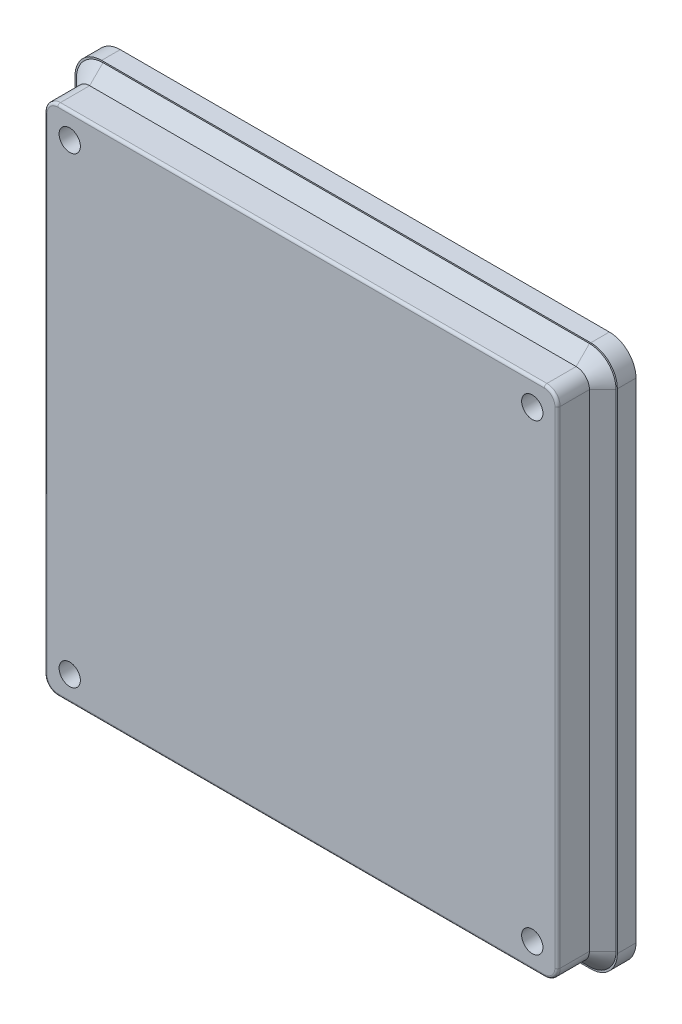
ISO-10303-21;
HEADER;
FILE_DESCRIPTION(('STEP AP214'),'2;1');
FILE_NAME('part.step','',(''),(''),'','','');
FILE_SCHEMA(('AUTOMOTIVE_DESIGN { 1 0 10303 214 1 1 1 1 }'));
ENDSEC;
DATA;
#1=APPLICATION_CONTEXT('core data for automotive mechanical design processes');
#2=APPLICATION_PROTOCOL_DEFINITION('international standard','automotive_design',2000,#1);
#3=PRODUCT_CONTEXT('',#1,'mechanical');
#4=PRODUCT('Part','Part','',(#3));
#5=PRODUCT_RELATED_PRODUCT_CATEGORY('part','',(#4));
#6=PRODUCT_DEFINITION_FORMATION('','',#4);
#7=PRODUCT_DEFINITION_CONTEXT('part definition',#1,'design');
#8=PRODUCT_DEFINITION('design','',#6,#7);
#9=PRODUCT_DEFINITION_SHAPE('','',#8);
#10=(LENGTH_UNIT() NAMED_UNIT(*) SI_UNIT(.MILLI.,.METRE.));
#11=(NAMED_UNIT(*) PLANE_ANGLE_UNIT() SI_UNIT($,.RADIAN.));
#12=(NAMED_UNIT(*) SI_UNIT($,.STERADIAN.) SOLID_ANGLE_UNIT());
#13=UNCERTAINTY_MEASURE_WITH_UNIT(LENGTH_MEASURE(1.E-05),#10,'distance_accuracy_value','');
#14=(GEOMETRIC_REPRESENTATION_CONTEXT(3) GLOBAL_UNCERTAINTY_ASSIGNED_CONTEXT((#13)) GLOBAL_UNIT_ASSIGNED_CONTEXT((#10,
#11,#12)) REPRESENTATION_CONTEXT('',''));
#15=CARTESIAN_POINT('',(0.,0.,0.));
#16=DIRECTION('',(0.,0.,1.));
#17=DIRECTION('',(1.,0.,0.));
#18=AXIS2_PLACEMENT_3D('',#15,#16,#17);
#19=CARTESIAN_POINT('',(102.,102.,7.));
#20=DIRECTION('',(-1.,0.,0.));
#21=DIRECTION('',(0.,-1.,0.));
#22=AXIS2_PLACEMENT_3D('',#19,#20,#21);
#23=PLANE('',#22);
#24=DIRECTION('',(0.,1.,0.));
#25=VECTOR('',#24,1.);
#26=CARTESIAN_POINT('',(102.,102.,0.));
#27=LINE('',#26,#25);
#28=CARTESIAN_POINT('',(102.,-92.,0.));
#29=VERTEX_POINT('',#28);
#30=CARTESIAN_POINT('',(102.,92.,0.));
#31=VERTEX_POINT('',#30);
#32=EDGE_CURVE('E1109',#29,#31,#27,.T.);
#33=ORIENTED_EDGE('',*,*,#32,.T.);
#34=DIRECTION('',(0.,0.,-1.));
#35=VECTOR('',#34,1.);
#36=CARTESIAN_POINT('',(102.,92.,7.));
#37=LINE('',#36,#35);
#38=CARTESIAN_POINT('',(102.,92.,7.));
#39=VERTEX_POINT('',#38);
#40=EDGE_CURVE('E1167',#31,#39,#37,.F.);
#41=ORIENTED_EDGE('',*,*,#40,.T.);
#42=DIRECTION('',(0.,1.,0.));
#43=VECTOR('',#42,1.);
#44=CARTESIAN_POINT('',(102.,102.,7.));
#45=LINE('',#44,#43);
#46=CARTESIAN_POINT('',(102.,-92.,7.));
#47=VERTEX_POINT('',#46);
#48=EDGE_CURVE('E1095',#47,#39,#45,.T.);
#49=ORIENTED_EDGE('',*,*,#48,.F.);
#50=DIRECTION('',(0.,0.,-1.));
#51=VECTOR('',#50,1.);
#52=CARTESIAN_POINT('',(102.,-92.,7.));
#53=LINE('',#52,#51);
#54=EDGE_CURVE('E1164',#47,#29,#53,.T.);
#55=ORIENTED_EDGE('',*,*,#54,.T.);
#56=EDGE_LOOP('',(#33,#41,#49,#55));
#57=FACE_BOUND('',#56,.T.);
#58=ADVANCED_FACE('F37',(#57),#23,.F.);
#59=CARTESIAN_POINT('',(-102.,102.,7.));
#60=DIRECTION('',(0.,-1.,0.));
#61=DIRECTION('',(0.,0.,-1.));
#62=AXIS2_PLACEMENT_3D('',#59,#60,#61);
#63=PLANE('',#62);
#64=DIRECTION('',(-1.,0.,0.));
#65=VECTOR('',#64,1.);
#66=CARTESIAN_POINT('',(-102.,102.,0.));
#67=LINE('',#66,#65);
#68=CARTESIAN_POINT('',(92.,102.,0.));
#69=VERTEX_POINT('',#68);
#70=CARTESIAN_POINT('',(-92.,102.,0.));
#71=VERTEX_POINT('',#70);
#72=EDGE_CURVE('E1112',#69,#71,#67,.T.);
#73=ORIENTED_EDGE('',*,*,#72,.T.);
#74=DIRECTION('',(0.,0.,-1.));
#75=VECTOR('',#74,1.);
#76=CARTESIAN_POINT('',(-92.,102.,7.));
#77=LINE('',#76,#75);
#78=CARTESIAN_POINT('',(-92.,102.,7.));
#79=VERTEX_POINT('',#78);
#80=EDGE_CURVE('E1154',#71,#79,#77,.F.);
#81=ORIENTED_EDGE('',*,*,#80,.T.);
#82=DIRECTION('',(-1.,0.,0.));
#83=VECTOR('',#82,1.);
#84=CARTESIAN_POINT('',(-102.,102.,7.));
#85=LINE('',#84,#83);
#86=CARTESIAN_POINT('',(92.,102.,7.));
#87=VERTEX_POINT('',#86);
#88=EDGE_CURVE('E1098',#87,#79,#85,.T.);
#89=ORIENTED_EDGE('',*,*,#88,.F.);
#90=DIRECTION('',(0.,0.,-1.));
#91=VECTOR('',#90,1.);
#92=CARTESIAN_POINT('',(92.,102.,7.));
#93=LINE('',#92,#91);
#94=EDGE_CURVE('E1151',#87,#69,#93,.T.);
#95=ORIENTED_EDGE('',*,*,#94,.T.);
#96=EDGE_LOOP('',(#73,#81,#89,#95));
#97=FACE_BOUND('',#96,.T.);
#98=ADVANCED_FACE('F1381',(#97),#63,.F.);
#99=CARTESIAN_POINT('',(-102.,102.,7.));
#100=DIRECTION('',(1.,0.,0.));
#101=DIRECTION('',(0.,1.,0.));
#102=AXIS2_PLACEMENT_3D('',#99,#100,#101);
#103=PLANE('',#102);
#104=DIRECTION('',(0.,-1.,0.));
#105=VECTOR('',#104,1.);
#106=CARTESIAN_POINT('',(-102.,102.,7.));
#107=LINE('',#106,#105);
#108=CARTESIAN_POINT('',(-102.,92.,7.));
#109=VERTEX_POINT('',#108);
#110=CARTESIAN_POINT('',(-102.,-92.,7.));
#111=VERTEX_POINT('',#110);
#112=EDGE_CURVE('E1102',#109,#111,#107,.T.);
#113=ORIENTED_EDGE('',*,*,#112,.F.);
#114=DIRECTION('',(0.,0.,-1.));
#115=VECTOR('',#114,1.);
#116=CARTESIAN_POINT('',(-102.,92.,7.));
#117=LINE('',#116,#115);
#118=CARTESIAN_POINT('',(-102.,92.,0.));
#119=VERTEX_POINT('',#118);
#120=EDGE_CURVE('E1140',#109,#119,#117,.T.);
#121=ORIENTED_EDGE('',*,*,#120,.T.);
#122=DIRECTION('',(0.,-1.,0.));
#123=VECTOR('',#122,1.);
#124=CARTESIAN_POINT('',(-102.,102.,0.));
#125=LINE('',#124,#123);
#126=CARTESIAN_POINT('',(-102.,-92.,0.));
#127=VERTEX_POINT('',#126);
#128=EDGE_CURVE('E1116',#119,#127,#125,.T.);
#129=ORIENTED_EDGE('',*,*,#128,.T.);
#130=DIRECTION('',(0.,0.,-1.));
#131=VECTOR('',#130,1.);
#132=CARTESIAN_POINT('',(-102.,-92.,7.));
#133=LINE('',#132,#131);
#134=EDGE_CURVE('E1138',#127,#111,#133,.F.);
#135=ORIENTED_EDGE('',*,*,#134,.T.);
#136=EDGE_LOOP('',(#113,#121,#129,#135));
#137=FACE_BOUND('',#136,.T.);
#138=ADVANCED_FACE('F1387',(#137),#103,.F.);
#139=CARTESIAN_POINT('',(-102.,-102.,7.));
#140=DIRECTION('',(0.,1.,0.));
#141=DIRECTION('',(0.,0.,1.));
#142=AXIS2_PLACEMENT_3D('',#139,#140,#141);
#143=PLANE('',#142);
#144=DIRECTION('',(1.,0.,0.));
#145=VECTOR('',#144,1.);
#146=CARTESIAN_POINT('',(-102.,-102.,0.));
#147=LINE('',#146,#145);
#148=CARTESIAN_POINT('',(-92.,-102.,0.));
#149=VERTEX_POINT('',#148);
#150=CARTESIAN_POINT('',(92.,-102.,0.));
#151=VERTEX_POINT('',#150);
#152=EDGE_CURVE('E1099',#149,#151,#147,.T.);
#153=ORIENTED_EDGE('',*,*,#152,.T.);
#154=DIRECTION('',(0.,0.,-1.));
#155=VECTOR('',#154,1.);
#156=CARTESIAN_POINT('',(92.,-102.,7.));
#157=LINE('',#156,#155);
#158=CARTESIAN_POINT('',(92.,-102.,7.));
#159=VERTEX_POINT('',#158);
#160=EDGE_CURVE('E1172',#151,#159,#157,.F.);
#161=ORIENTED_EDGE('',*,*,#160,.T.);
#162=DIRECTION('',(1.,0.,0.));
#163=VECTOR('',#162,1.);
#164=CARTESIAN_POINT('',(-102.,-102.,7.));
#165=LINE('',#164,#163);
#166=CARTESIAN_POINT('',(-92.,-102.,7.));
#167=VERTEX_POINT('',#166);
#168=EDGE_CURVE('E1105',#167,#159,#165,.T.);
#169=ORIENTED_EDGE('',*,*,#168,.F.);
#170=DIRECTION('',(0.,0.,-1.));
#171=VECTOR('',#170,1.);
#172=CARTESIAN_POINT('',(-92.,-102.,7.));
#173=LINE('',#172,#171);
#174=EDGE_CURVE('E1169',#167,#149,#173,.T.);
#175=ORIENTED_EDGE('',*,*,#174,.T.);
#176=EDGE_LOOP('',(#153,#161,#169,#175));
#177=FACE_BOUND('',#176,.T.);
#178=ADVANCED_FACE('F1563',(#177),#143,.F.);
#179=CARTESIAN_POINT('',(0.,0.,7.));
#180=DIRECTION('',(0.,0.,1.));
#181=DIRECTION('',(1.,0.,0.));
#182=AXIS2_PLACEMENT_3D('',#179,#180,#181);
#183=PLANE('',#182);
#184=CARTESIAN_POINT('',(-91.5,-91.5,7.));
#185=DIRECTION('',(0.,0.,1.));
#186=DIRECTION('',(1.,0.,0.));
#187=AXIS2_PLACEMENT_3D('',#184,#185,#186);
#188=CIRCLE('',#187,9.99999999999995);
#189=CARTESIAN_POINT('',(-91.5,-101.5,7.));
#190=VERTEX_POINT('',#189);
#191=CARTESIAN_POINT('',(-101.5,-91.5,7.));
#192=VERTEX_POINT('',#191);
#193=EDGE_CURVE('E1190',#190,#192,#188,.F.);
#194=ORIENTED_EDGE('',*,*,#193,.T.);
#195=DIRECTION('',(0.,1.,0.));
#196=VECTOR('',#195,1.);
#197=CARTESIAN_POINT('',(-101.5,0.,7.));
#198=LINE('',#197,#196);
#199=CARTESIAN_POINT('',(-101.5,91.5,7.));
#200=VERTEX_POINT('',#199);
#201=EDGE_CURVE('E1192',#192,#200,#198,.T.);
#202=ORIENTED_EDGE('',*,*,#201,.T.);
#203=CARTESIAN_POINT('',(-91.5,91.5,7.));
#204=DIRECTION('',(0.,0.,1.));
#205=DIRECTION('',(1.,0.,0.));
#206=AXIS2_PLACEMENT_3D('',#203,#204,#205);
#207=CIRCLE('',#206,9.99999999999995);
#208=CARTESIAN_POINT('',(-91.5,101.5,7.));
#209=VERTEX_POINT('',#208);
#210=EDGE_CURVE('E1188',#200,#209,#207,.F.);
#211=ORIENTED_EDGE('',*,*,#210,.T.);
#212=DIRECTION('',(1.,0.,0.));
#213=VECTOR('',#212,1.);
#214=CARTESIAN_POINT('',(0.,101.5,7.));
#215=LINE('',#214,#213);
#216=CARTESIAN_POINT('',(91.5,101.5,7.));
#217=VERTEX_POINT('',#216);
#218=EDGE_CURVE('E1183',#209,#217,#215,.T.);
#219=ORIENTED_EDGE('',*,*,#218,.T.);
#220=CARTESIAN_POINT('',(91.5,91.5,7.));
#221=DIRECTION('',(0.,0.,1.));
#222=DIRECTION('',(1.,0.,0.));
#223=AXIS2_PLACEMENT_3D('',#220,#221,#222);
#224=CIRCLE('',#223,9.99999999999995);
#225=CARTESIAN_POINT('',(101.5,91.5,7.));
#226=VERTEX_POINT('',#225);
#227=EDGE_CURVE('E1179',#217,#226,#224,.F.);
#228=ORIENTED_EDGE('',*,*,#227,.T.);
#229=DIRECTION('',(0.,-1.,0.));
#230=VECTOR('',#229,1.);
#231=CARTESIAN_POINT('',(101.5,0.,7.));
#232=LINE('',#231,#230);
#233=CARTESIAN_POINT('',(101.5,-91.5,7.));
#234=VERTEX_POINT('',#233);
#235=EDGE_CURVE('E1177',#226,#234,#232,.T.);
#236=ORIENTED_EDGE('',*,*,#235,.T.);
#237=CARTESIAN_POINT('',(91.5,-91.5,7.));
#238=DIRECTION('',(0.,0.,1.));
#239=DIRECTION('',(1.,0.,0.));
#240=AXIS2_PLACEMENT_3D('',#237,#238,#239);
#241=CIRCLE('',#240,9.99999999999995);
#242=CARTESIAN_POINT('',(91.5,-101.5,7.));
#243=VERTEX_POINT('',#242);
#244=EDGE_CURVE('E1181',#234,#243,#241,.F.);
#245=ORIENTED_EDGE('',*,*,#244,.T.);
#246=DIRECTION('',(-1.,0.,0.));
#247=VECTOR('',#246,1.);
#248=CARTESIAN_POINT('',(0.,-101.5,7.));
#249=LINE('',#248,#247);
#250=EDGE_CURVE('E1185',#243,#190,#249,.T.);
#251=ORIENTED_EDGE('',*,*,#250,.T.);
#252=EDGE_LOOP('',(#194,#202,#211,#219,#228,#236,#245,#251));
#253=FACE_BOUND('',#252,.T.);
#254=ORIENTED_EDGE('',*,*,#88,.T.);
#255=CARTESIAN_POINT('',(-92.,92.,7.));
#256=DIRECTION('',(0.,0.,1.));
#257=DIRECTION('',(1.,0.,0.));
#258=AXIS2_PLACEMENT_3D('',#255,#256,#257);
#259=CIRCLE('',#258,10.);
#260=EDGE_CURVE('E1162',#79,#109,#259,.T.);
#261=ORIENTED_EDGE('',*,*,#260,.T.);
#262=ORIENTED_EDGE('',*,*,#112,.T.);
#263=CARTESIAN_POINT('',(-92.,-92.,7.));
#264=DIRECTION('',(0.,0.,1.));
#265=DIRECTION('',(1.,0.,0.));
#266=AXIS2_PLACEMENT_3D('',#263,#264,#265);
#267=CIRCLE('',#266,10.);
#268=EDGE_CURVE('E1156',#111,#167,#267,.T.);
#269=ORIENTED_EDGE('',*,*,#268,.T.);
#270=ORIENTED_EDGE('',*,*,#168,.T.);
#271=CARTESIAN_POINT('',(92.,-92.,7.));
#272=DIRECTION('',(0.,0.,1.));
#273=DIRECTION('',(1.,0.,0.));
#274=AXIS2_PLACEMENT_3D('',#271,#272,#273);
#275=CIRCLE('',#274,10.);
#276=EDGE_CURVE('E1158',#159,#47,#275,.T.);
#277=ORIENTED_EDGE('',*,*,#276,.T.);
#278=ORIENTED_EDGE('',*,*,#48,.T.);
#279=CARTESIAN_POINT('',(92.,92.,7.));
#280=DIRECTION('',(0.,0.,1.));
#281=DIRECTION('',(1.,0.,0.));
#282=AXIS2_PLACEMENT_3D('',#279,#280,#281);
#283=CIRCLE('',#282,10.);
#284=EDGE_CURVE('E1160',#39,#87,#283,.T.);
#285=ORIENTED_EDGE('',*,*,#284,.T.);
#286=EDGE_LOOP('',(#254,#261,#262,#269,#270,#277,#278,#285));
#287=FACE_BOUND('',#286,.T.);
#288=ADVANCED_FACE('F1560',(#253,#287),#183,.T.);
#289=CARTESIAN_POINT('',(0.,0.,0.));
#290=DIRECTION('',(0.,0.,1.));
#291=DIRECTION('',(1.,0.,0.));
#292=AXIS2_PLACEMENT_3D('',#289,#290,#291);
#293=PLANE('',#292);
#294=CARTESIAN_POINT('',(-92.,-92.,0.));
#295=DIRECTION('',(0.,0.,-1.));
#296=DIRECTION('',(-1.,0.,0.));
#297=AXIS2_PLACEMENT_3D('',#294,#295,#296);
#298=CIRCLE('',#297,7.99999999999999);
#299=CARTESIAN_POINT('',(-92.,-100.,0.));
#300=VERTEX_POINT('',#299);
#301=CARTESIAN_POINT('',(-100.,-92.,0.));
#302=VERTEX_POINT('',#301);
#303=EDGE_CURVE('E1025',#300,#302,#298,.T.);
#304=ORIENTED_EDGE('',*,*,#303,.F.);
#305=DIRECTION('',(-1.,0.,0.));
#306=VECTOR('',#305,1.);
#307=CARTESIAN_POINT('',(0.,-100.,0.));
#308=LINE('',#307,#306);
#309=CARTESIAN_POINT('',(92.,-100.,0.));
#310=VERTEX_POINT('',#309);
#311=EDGE_CURVE('E1023',#310,#300,#308,.T.);
#312=ORIENTED_EDGE('',*,*,#311,.F.);
#313=CARTESIAN_POINT('',(92.,-92.,0.));
#314=DIRECTION('',(0.,0.,-1.));
#315=DIRECTION('',(-1.,0.,0.));
#316=AXIS2_PLACEMENT_3D('',#313,#314,#315);
#317=CIRCLE('',#316,7.99999999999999);
#318=CARTESIAN_POINT('',(100.,-92.,0.));
#319=VERTEX_POINT('',#318);
#320=EDGE_CURVE('E915',#319,#310,#317,.T.);
#321=ORIENTED_EDGE('',*,*,#320,.F.);
#322=DIRECTION('',(0.,-1.,0.));
#323=VECTOR('',#322,1.);
#324=CARTESIAN_POINT('',(100.,0.,0.));
#325=LINE('',#324,#323);
#326=CARTESIAN_POINT('',(100.,92.,0.));
#327=VERTEX_POINT('',#326);
#328=EDGE_CURVE('E1040',#327,#319,#325,.T.);
#329=ORIENTED_EDGE('',*,*,#328,.F.);
#330=CARTESIAN_POINT('',(92.,92.,0.));
#331=DIRECTION('',(0.,0.,-1.));
#332=DIRECTION('',(-1.,0.,0.));
#333=AXIS2_PLACEMENT_3D('',#330,#331,#332);
#334=CIRCLE('',#333,7.99999999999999);
#335=CARTESIAN_POINT('',(92.,100.,0.));
#336=VERTEX_POINT('',#335);
#337=EDGE_CURVE('E1037',#336,#327,#334,.T.);
#338=ORIENTED_EDGE('',*,*,#337,.F.);
#339=DIRECTION('',(1.,0.,0.));
#340=VECTOR('',#339,1.);
#341=CARTESIAN_POINT('',(0.,100.,0.));
#342=LINE('',#341,#340);
#343=CARTESIAN_POINT('',(-92.,100.,0.));
#344=VERTEX_POINT('',#343);
#345=EDGE_CURVE('E1034',#344,#336,#342,.T.);
#346=ORIENTED_EDGE('',*,*,#345,.F.);
#347=CARTESIAN_POINT('',(-92.,92.,0.));
#348=DIRECTION('',(0.,0.,-1.));
#349=DIRECTION('',(-1.,0.,0.));
#350=AXIS2_PLACEMENT_3D('',#347,#348,#349);
#351=CIRCLE('',#350,7.99999999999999);
#352=CARTESIAN_POINT('',(-100.,92.,0.));
#353=VERTEX_POINT('',#352);
#354=EDGE_CURVE('E1031',#353,#344,#351,.T.);
#355=ORIENTED_EDGE('',*,*,#354,.F.);
#356=DIRECTION('',(0.,1.,0.));
#357=VECTOR('',#356,1.);
#358=CARTESIAN_POINT('',(-100.,0.,0.));
#359=LINE('',#358,#357);
#360=EDGE_CURVE('E1028',#302,#353,#359,.T.);
#361=ORIENTED_EDGE('',*,*,#360,.F.);
#362=EDGE_LOOP('',(#304,#312,#321,#329,#338,#346,#355,#361));
#363=FACE_BOUND('',#362,.T.);
#364=ORIENTED_EDGE('',*,*,#128,.F.);
#365=CARTESIAN_POINT('',(-92.,92.,0.));
#366=DIRECTION('',(0.,0.,1.));
#367=DIRECTION('',(1.,0.,0.));
#368=AXIS2_PLACEMENT_3D('',#365,#366,#367);
#369=CIRCLE('',#368,10.);
#370=EDGE_CURVE('E1149',#119,#71,#369,.F.);
#371=ORIENTED_EDGE('',*,*,#370,.T.);
#372=ORIENTED_EDGE('',*,*,#72,.F.);
#373=CARTESIAN_POINT('',(92.,92.,0.));
#374=DIRECTION('',(0.,0.,1.));
#375=DIRECTION('',(1.,0.,0.));
#376=AXIS2_PLACEMENT_3D('',#373,#374,#375);
#377=CIRCLE('',#376,10.);
#378=EDGE_CURVE('E1147',#69,#31,#377,.F.);
#379=ORIENTED_EDGE('',*,*,#378,.T.);
#380=ORIENTED_EDGE('',*,*,#32,.F.);
#381=CARTESIAN_POINT('',(92.,-92.,0.));
#382=DIRECTION('',(0.,0.,1.));
#383=DIRECTION('',(1.,0.,0.));
#384=AXIS2_PLACEMENT_3D('',#381,#382,#383);
#385=CIRCLE('',#384,10.);
#386=EDGE_CURVE('E1145',#29,#151,#385,.F.);
#387=ORIENTED_EDGE('',*,*,#386,.T.);
#388=ORIENTED_EDGE('',*,*,#152,.F.);
#389=CARTESIAN_POINT('',(-92.,-92.,0.));
#390=DIRECTION('',(0.,0.,1.));
#391=DIRECTION('',(1.,0.,0.));
#392=AXIS2_PLACEMENT_3D('',#389,#390,#391);
#393=CIRCLE('',#392,10.);
#394=EDGE_CURVE('E1143',#149,#127,#393,.F.);
#395=ORIENTED_EDGE('',*,*,#394,.T.);
#396=EDGE_LOOP('',(#364,#371,#372,#379,#380,#387,#388,#395));
#397=FACE_BOUND('',#396,.T.);
#398=ADVANCED_FACE('F1559',(#363,#397),#293,.F.);
#399=CARTESIAN_POINT('',(96.5,96.5,24.));
#400=DIRECTION('',(-1.,0.,0.));
#401=DIRECTION('',(0.,-1.,0.));
#402=AXIS2_PLACEMENT_3D('',#399,#400,#401);
#403=PLANE('',#402);
#404=DIRECTION('',(0.,0.,-1.));
#405=VECTOR('',#404,1.);
#406=CARTESIAN_POINT('',(96.5,91.5,24.));
#407=LINE('',#406,#405);
#408=CARTESIAN_POINT('',(96.5,91.5,12.));
#409=VERTEX_POINT('',#408);
#410=CARTESIAN_POINT('',(96.5,91.5,23.));
#411=VERTEX_POINT('',#410);
#412=EDGE_CURVE('E1108',#409,#411,#407,.F.);
#413=ORIENTED_EDGE('',*,*,#412,.T.);
#414=DIRECTION('',(0.,1.,0.));
#415=VECTOR('',#414,1.);
#416=CARTESIAN_POINT('',(96.5,-91.5,23.));
#417=LINE('',#416,#415);
#418=CARTESIAN_POINT('',(96.5,-91.5,23.));
#419=VERTEX_POINT('',#418);
#420=EDGE_CURVE('E1252',#411,#419,#417,.F.);
#421=ORIENTED_EDGE('',*,*,#420,.T.);
#422=DIRECTION('',(0.,0.,-1.));
#423=VECTOR('',#422,1.);
#424=CARTESIAN_POINT('',(96.5,-91.5,24.));
#425=LINE('',#424,#423);
#426=CARTESIAN_POINT('',(96.5,-91.5,12.));
#427=VERTEX_POINT('',#426);
#428=EDGE_CURVE('E1123',#419,#427,#425,.T.);
#429=ORIENTED_EDGE('',*,*,#428,.T.);
#430=DIRECTION('',(0.,1.,0.));
#431=VECTOR('',#430,1.);
#432=CARTESIAN_POINT('',(96.5,96.5,12.));
#433=LINE('',#432,#431);
#434=EDGE_CURVE('E1210',#427,#409,#433,.T.);
#435=ORIENTED_EDGE('',*,*,#434,.T.);
#436=EDGE_LOOP('',(#413,#421,#429,#435));
#437=FACE_BOUND('',#436,.T.);
#438=ADVANCED_FACE('F1515',(#437),#403,.F.);
#439=CARTESIAN_POINT('',(-96.5,96.5,24.));
#440=DIRECTION('',(0.,-1.,0.));
#441=DIRECTION('',(0.,0.,-1.));
#442=AXIS2_PLACEMENT_3D('',#439,#440,#441);
#443=PLANE('',#442);
#444=DIRECTION('',(0.,0.,-1.));
#445=VECTOR('',#444,1.);
#446=CARTESIAN_POINT('',(-91.5,96.5,24.));
#447=LINE('',#446,#445);
#448=CARTESIAN_POINT('',(-91.5,96.5,12.));
#449=VERTEX_POINT('',#448);
#450=CARTESIAN_POINT('',(-91.5,96.5,23.));
#451=VERTEX_POINT('',#450);
#452=EDGE_CURVE('E1136',#449,#451,#447,.F.);
#453=ORIENTED_EDGE('',*,*,#452,.T.);
#454=DIRECTION('',(-1.,0.,0.));
#455=VECTOR('',#454,1.);
#456=CARTESIAN_POINT('',(91.5,96.5,23.));
#457=LINE('',#456,#455);
#458=CARTESIAN_POINT('',(91.5,96.5,23.));
#459=VERTEX_POINT('',#458);
#460=EDGE_CURVE('E11',#451,#459,#457,.F.);
#461=ORIENTED_EDGE('',*,*,#460,.T.);
#462=DIRECTION('',(0.,0.,-1.));
#463=VECTOR('',#462,1.);
#464=CARTESIAN_POINT('',(91.5,96.5,24.));
#465=LINE('',#464,#463);
#466=CARTESIAN_POINT('',(91.5,96.5,12.));
#467=VERTEX_POINT('',#466);
#468=EDGE_CURVE('E1134',#459,#467,#465,.T.);
#469=ORIENTED_EDGE('',*,*,#468,.T.);
#470=DIRECTION('',(-1.,0.,0.));
#471=VECTOR('',#470,1.);
#472=CARTESIAN_POINT('',(-96.5,96.5,12.));
#473=LINE('',#472,#471);
#474=EDGE_CURVE('E1196',#467,#449,#473,.T.);
#475=ORIENTED_EDGE('',*,*,#474,.T.);
#476=EDGE_LOOP('',(#453,#461,#469,#475));
#477=FACE_BOUND('',#476,.T.);
#478=ADVANCED_FACE('F1503',(#477),#443,.F.);
#479=CARTESIAN_POINT('',(-96.5,96.5,24.));
#480=DIRECTION('',(1.,0.,0.));
#481=DIRECTION('',(0.,1.,0.));
#482=AXIS2_PLACEMENT_3D('',#479,#480,#481);
#483=PLANE('',#482);
#484=DIRECTION('',(0.,0.,-1.));
#485=VECTOR('',#484,1.);
#486=CARTESIAN_POINT('',(-96.5,-91.5,24.));
#487=LINE('',#486,#485);
#488=CARTESIAN_POINT('',(-96.5,-91.5,12.));
#489=VERTEX_POINT('',#488);
#490=CARTESIAN_POINT('',(-96.5,-91.5,23.));
#491=VERTEX_POINT('',#490);
#492=EDGE_CURVE('E1132',#489,#491,#487,.F.);
#493=ORIENTED_EDGE('',*,*,#492,.T.);
#494=DIRECTION('',(0.,-1.,0.));
#495=VECTOR('',#494,1.);
#496=CARTESIAN_POINT('',(-96.5,91.5,23.));
#497=LINE('',#496,#495);
#498=CARTESIAN_POINT('',(-96.5,91.5,23.));
#499=VERTEX_POINT('',#498);
#500=EDGE_CURVE('E61',#491,#499,#497,.F.);
#501=ORIENTED_EDGE('',*,*,#500,.T.);
#502=DIRECTION('',(0.,0.,-1.));
#503=VECTOR('',#502,1.);
#504=CARTESIAN_POINT('',(-96.5,91.5,24.));
#505=LINE('',#504,#503);
#506=CARTESIAN_POINT('',(-96.5,91.5,12.));
#507=VERTEX_POINT('',#506);
#508=EDGE_CURVE('E1130',#499,#507,#505,.T.);
#509=ORIENTED_EDGE('',*,*,#508,.T.);
#510=DIRECTION('',(0.,-1.,0.));
#511=VECTOR('',#510,1.);
#512=CARTESIAN_POINT('',(-96.5,96.5,12.));
#513=LINE('',#512,#511);
#514=EDGE_CURVE('E1194',#507,#489,#513,.T.);
#515=ORIENTED_EDGE('',*,*,#514,.T.);
#516=EDGE_LOOP('',(#493,#501,#509,#515));
#517=FACE_BOUND('',#516,.T.);
#518=ADVANCED_FACE('F1546',(#517),#483,.F.);
#519=CARTESIAN_POINT('',(-96.5,-96.5,24.));
#520=DIRECTION('',(0.,1.,0.));
#521=DIRECTION('',(0.,0.,1.));
#522=AXIS2_PLACEMENT_3D('',#519,#520,#521);
#523=PLANE('',#522);
#524=DIRECTION('',(0.,0.,-1.));
#525=VECTOR('',#524,1.);
#526=CARTESIAN_POINT('',(91.5,-96.5,24.));
#527=LINE('',#526,#525);
#528=CARTESIAN_POINT('',(91.5,-96.5,12.));
#529=VERTEX_POINT('',#528);
#530=CARTESIAN_POINT('',(91.5,-96.5,23.));
#531=VERTEX_POINT('',#530);
#532=EDGE_CURVE('E1127',#529,#531,#527,.F.);
#533=ORIENTED_EDGE('',*,*,#532,.T.);
#534=DIRECTION('',(1.,0.,0.));
#535=VECTOR('',#534,1.);
#536=CARTESIAN_POINT('',(-91.5,-96.5,23.));
#537=LINE('',#536,#535);
#538=CARTESIAN_POINT('',(-91.5,-96.5,23.));
#539=VERTEX_POINT('',#538);
#540=EDGE_CURVE('E1256',#531,#539,#537,.F.);
#541=ORIENTED_EDGE('',*,*,#540,.T.);
#542=DIRECTION('',(0.,0.,-1.));
#543=VECTOR('',#542,1.);
#544=CARTESIAN_POINT('',(-91.5,-96.5,24.));
#545=LINE('',#544,#543);
#546=CARTESIAN_POINT('',(-91.5,-96.5,12.));
#547=VERTEX_POINT('',#546);
#548=EDGE_CURVE('E1125',#539,#547,#545,.T.);
#549=ORIENTED_EDGE('',*,*,#548,.T.);
#550=DIRECTION('',(1.,0.,0.));
#551=VECTOR('',#550,1.);
#552=CARTESIAN_POINT('',(-96.5,-96.5,12.));
#553=LINE('',#552,#551);
#554=EDGE_CURVE('E1174',#547,#529,#553,.T.);
#555=ORIENTED_EDGE('',*,*,#554,.T.);
#556=EDGE_LOOP('',(#533,#541,#549,#555));
#557=FACE_BOUND('',#556,.T.);
#558=ADVANCED_FACE('F1524',(#557),#523,.F.);
#559=CARTESIAN_POINT('',(0.,0.,24.));
#560=DIRECTION('',(0.,0.,1.));
#561=DIRECTION('',(1.,0.,0.));
#562=AXIS2_PLACEMENT_3D('',#559,#560,#561);
#563=PLANE('',#562);
#564=CARTESIAN_POINT('',(87.,87.,24.));
#565=DIRECTION('',(0.,0.,-1.));
#566=DIRECTION('',(-1.,0.,0.));
#567=AXIS2_PLACEMENT_3D('',#564,#565,#566);
#568=CIRCLE('',#567,4.00000000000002);
#569=CARTESIAN_POINT('',(83.,87.,24.));
#570=VERTEX_POINT('',#569);
#571=EDGE_CURVE('E2867',#570,#570,#568,.T.);
#572=ORIENTED_EDGE('',*,*,#571,.T.);
#573=EDGE_LOOP('',(#572));
#574=FACE_BOUND('',#573,.T.);
#575=CARTESIAN_POINT('',(87.,-87.,24.));
#576=DIRECTION('',(0.,0.,1.));
#577=DIRECTION('',(-1.,0.,0.));
#578=AXIS2_PLACEMENT_3D('',#575,#576,#577);
#579=CIRCLE('',#578,4.00000000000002);
#580=CARTESIAN_POINT('',(83.,-87.,24.));
#581=VERTEX_POINT('',#580);
#582=EDGE_CURVE('E2878',#581,#581,#579,.T.);
#583=ORIENTED_EDGE('',*,*,#582,.F.);
#584=EDGE_LOOP('',(#583));
#585=FACE_BOUND('',#584,.T.);
#586=CARTESIAN_POINT('',(-87.,-87.,24.));
#587=DIRECTION('',(0.,0.,-1.));
#588=DIRECTION('',(1.,0.,0.));
#589=AXIS2_PLACEMENT_3D('',#586,#587,#588);
#590=CIRCLE('',#589,4.00000000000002);
#591=CARTESIAN_POINT('',(-83.,-87.,24.));
#592=VERTEX_POINT('',#591);
#593=EDGE_CURVE('E1299',#592,#592,#590,.T.);
#594=ORIENTED_EDGE('',*,*,#593,.T.);
#595=EDGE_LOOP('',(#594));
#596=FACE_BOUND('',#595,.T.);
#597=DIRECTION('',(0.,1.,0.));
#598=VECTOR('',#597,1.);
#599=CARTESIAN_POINT('',(95.5,91.5,24.));
#600=LINE('',#599,#598);
#601=CARTESIAN_POINT('',(95.5,-91.5,24.));
#602=VERTEX_POINT('',#601);
#603=CARTESIAN_POINT('',(95.5,91.5,24.));
#604=VERTEX_POINT('',#603);
#605=EDGE_CURVE('E1244',#602,#604,#600,.T.);
#606=ORIENTED_EDGE('',*,*,#605,.T.);
#607=CARTESIAN_POINT('',(91.5,91.5,24.));
#608=DIRECTION('',(0.,0.,1.));
#609=DIRECTION('',(1.,0.,0.));
#610=AXIS2_PLACEMENT_3D('',#607,#608,#609);
#611=CIRCLE('',#610,4.);
#612=CARTESIAN_POINT('',(91.5,95.5,24.));
#613=VERTEX_POINT('',#612);
#614=EDGE_CURVE('E1246',#604,#613,#611,.T.);
#615=ORIENTED_EDGE('',*,*,#614,.T.);
#616=DIRECTION('',(-1.,0.,0.));
#617=VECTOR('',#616,1.);
#618=CARTESIAN_POINT('',(-91.5,95.5,24.));
#619=LINE('',#618,#617);
#620=CARTESIAN_POINT('',(-91.5,95.5,24.));
#621=VERTEX_POINT('',#620);
#622=EDGE_CURVE('E1212',#613,#621,#619,.T.);
#623=ORIENTED_EDGE('',*,*,#622,.T.);
#624=CARTESIAN_POINT('',(-91.5,91.5,24.));
#625=DIRECTION('',(0.,0.,1.));
#626=DIRECTION('',(1.,0.,0.));
#627=AXIS2_PLACEMENT_3D('',#624,#625,#626);
#628=CIRCLE('',#627,4.);
#629=CARTESIAN_POINT('',(-95.5,91.5,24.));
#630=VERTEX_POINT('',#629);
#631=EDGE_CURVE('E1234',#621,#630,#628,.T.);
#632=ORIENTED_EDGE('',*,*,#631,.T.);
#633=DIRECTION('',(0.,-1.,0.));
#634=VECTOR('',#633,1.);
#635=CARTESIAN_POINT('',(-95.5,-91.5,24.));
#636=LINE('',#635,#634);
#637=CARTESIAN_POINT('',(-95.5,-91.5,24.));
#638=VERTEX_POINT('',#637);
#639=EDGE_CURVE('E1236',#630,#638,#636,.T.);
#640=ORIENTED_EDGE('',*,*,#639,.T.);
#641=CARTESIAN_POINT('',(-91.5,-91.5,24.));
#642=DIRECTION('',(0.,0.,1.));
#643=DIRECTION('',(1.,0.,0.));
#644=AXIS2_PLACEMENT_3D('',#641,#642,#643);
#645=CIRCLE('',#644,4.);
#646=CARTESIAN_POINT('',(-91.5,-95.5,24.));
#647=VERTEX_POINT('',#646);
#648=EDGE_CURVE('E1238',#638,#647,#645,.T.);
#649=ORIENTED_EDGE('',*,*,#648,.T.);
#650=DIRECTION('',(1.,0.,0.));
#651=VECTOR('',#650,1.);
#652=CARTESIAN_POINT('',(91.5,-95.5,24.));
#653=LINE('',#652,#651);
#654=CARTESIAN_POINT('',(91.5,-95.5,24.));
#655=VERTEX_POINT('',#654);
#656=EDGE_CURVE('E1240',#647,#655,#653,.T.);
#657=ORIENTED_EDGE('',*,*,#656,.T.);
#658=CARTESIAN_POINT('',(91.5,-91.5,24.));
#659=DIRECTION('',(0.,0.,1.));
#660=DIRECTION('',(1.,0.,0.));
#661=AXIS2_PLACEMENT_3D('',#658,#659,#660);
#662=CIRCLE('',#661,4.);
#663=EDGE_CURVE('E1242',#655,#602,#662,.T.);
#664=ORIENTED_EDGE('',*,*,#663,.T.);
#665=EDGE_LOOP('',(#606,#615,#623,#632,#640,#649,#657,#664));
#666=FACE_BOUND('',#665,.T.);
#667=CARTESIAN_POINT('',(-87.,87.,24.));
#668=DIRECTION('',(0.,0.,1.));
#669=DIRECTION('',(1.,0.,0.));
#670=AXIS2_PLACEMENT_3D('',#667,#668,#669);
#671=CIRCLE('',#670,4.00000000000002);
#672=CARTESIAN_POINT('',(-83.,87.,24.));
#673=VERTEX_POINT('',#672);
#674=EDGE_CURVE('E1290',#673,#673,#671,.T.);
#675=ORIENTED_EDGE('',*,*,#674,.F.);
#676=EDGE_LOOP('',(#675));
#677=FACE_BOUND('',#676,.T.);
#678=ADVANCED_FACE('F1396',(#574,#585,#596,#666,#677),#563,.T.);
#679=CARTESIAN_POINT('',(91.5,-91.5,24.));
#680=DIRECTION('',(0.,0.,-1.));
#681=DIRECTION('',(-1.,0.,0.));
#682=AXIS2_PLACEMENT_3D('',#679,#680,#681);
#683=CYLINDRICAL_SURFACE('',#682,5.);
#684=ORIENTED_EDGE('',*,*,#428,.F.);
#685=CARTESIAN_POINT('',(91.5,-91.5,23.));
#686=DIRECTION('',(0.,0.,1.));
#687=DIRECTION('',(1.,0.,0.));
#688=AXIS2_PLACEMENT_3D('',#685,#686,#687);
#689=CIRCLE('',#688,5.);
#690=EDGE_CURVE('E1254',#419,#531,#689,.F.);
#691=ORIENTED_EDGE('',*,*,#690,.T.);
#692=ORIENTED_EDGE('',*,*,#532,.F.);
#693=CARTESIAN_POINT('',(91.5,-91.5,12.));
#694=DIRECTION('',(0.,0.,1.));
#695=DIRECTION('',(1.,0.,0.));
#696=AXIS2_PLACEMENT_3D('',#693,#694,#695);
#697=CIRCLE('',#696,5.);
#698=EDGE_CURVE('E1204',#529,#427,#697,.T.);
#699=ORIENTED_EDGE('',*,*,#698,.T.);
#700=EDGE_LOOP('',(#684,#691,#692,#699));
#701=FACE_BOUND('',#700,.T.);
#702=ADVANCED_FACE('F1392',(#701),#683,.T.);
#703=CARTESIAN_POINT('',(-91.5,-91.5,24.));
#704=DIRECTION('',(0.,0.,-1.));
#705=DIRECTION('',(-1.,0.,0.));
#706=AXIS2_PLACEMENT_3D('',#703,#704,#705);
#707=CYLINDRICAL_SURFACE('',#706,5.);
#708=ORIENTED_EDGE('',*,*,#548,.F.);
#709=CARTESIAN_POINT('',(-91.5,-91.5,23.));
#710=DIRECTION('',(0.,0.,1.));
#711=DIRECTION('',(1.,0.,0.));
#712=AXIS2_PLACEMENT_3D('',#709,#710,#711);
#713=CIRCLE('',#712,5.);
#714=EDGE_CURVE('E1258',#539,#491,#713,.F.);
#715=ORIENTED_EDGE('',*,*,#714,.T.);
#716=ORIENTED_EDGE('',*,*,#492,.F.);
#717=CARTESIAN_POINT('',(-91.5,-91.5,12.));
#718=DIRECTION('',(0.,0.,1.));
#719=DIRECTION('',(1.,0.,0.));
#720=AXIS2_PLACEMENT_3D('',#717,#718,#719);
#721=CIRCLE('',#720,5.);
#722=EDGE_CURVE('E1198',#489,#547,#721,.T.);
#723=ORIENTED_EDGE('',*,*,#722,.T.);
#724=EDGE_LOOP('',(#708,#715,#716,#723));
#725=FACE_BOUND('',#724,.T.);
#726=ADVANCED_FACE('F1395',(#725),#707,.T.);
#727=CARTESIAN_POINT('',(-91.5,91.5,24.));
#728=DIRECTION('',(0.,0.,-1.));
#729=DIRECTION('',(-1.,0.,0.));
#730=AXIS2_PLACEMENT_3D('',#727,#728,#729);
#731=CYLINDRICAL_SURFACE('',#730,5.);
#732=ORIENTED_EDGE('',*,*,#508,.F.);
#733=CARTESIAN_POINT('',(-91.5,91.5,23.));
#734=DIRECTION('',(0.,0.,1.));
#735=DIRECTION('',(1.,0.,0.));
#736=AXIS2_PLACEMENT_3D('',#733,#734,#735);
#737=CIRCLE('',#736,5.);
#738=EDGE_CURVE('E46',#499,#451,#737,.F.);
#739=ORIENTED_EDGE('',*,*,#738,.T.);
#740=ORIENTED_EDGE('',*,*,#452,.F.);
#741=CARTESIAN_POINT('',(-91.5,91.5,12.));
#742=DIRECTION('',(0.,0.,1.));
#743=DIRECTION('',(1.,0.,0.));
#744=AXIS2_PLACEMENT_3D('',#741,#742,#743);
#745=CIRCLE('',#744,5.);
#746=EDGE_CURVE('E1201',#449,#507,#745,.T.);
#747=ORIENTED_EDGE('',*,*,#746,.T.);
#748=EDGE_LOOP('',(#732,#739,#740,#747));
#749=FACE_BOUND('',#748,.T.);
#750=ADVANCED_FACE('F1400',(#749),#731,.T.);
#751=CARTESIAN_POINT('',(91.5,91.5,24.));
#752=DIRECTION('',(0.,0.,-1.));
#753=DIRECTION('',(-1.,0.,0.));
#754=AXIS2_PLACEMENT_3D('',#751,#752,#753);
#755=CYLINDRICAL_SURFACE('',#754,5.);
#756=ORIENTED_EDGE('',*,*,#468,.F.);
#757=CARTESIAN_POINT('',(91.5,91.5,23.));
#758=DIRECTION('',(0.,0.,1.));
#759=DIRECTION('',(1.,0.,0.));
#760=AXIS2_PLACEMENT_3D('',#757,#758,#759);
#761=CIRCLE('',#760,5.);
#762=EDGE_CURVE('E1249',#459,#411,#761,.F.);
#763=ORIENTED_EDGE('',*,*,#762,.T.);
#764=ORIENTED_EDGE('',*,*,#412,.F.);
#765=CARTESIAN_POINT('',(91.5,91.5,12.));
#766=DIRECTION('',(0.,0.,1.));
#767=DIRECTION('',(1.,0.,0.));
#768=AXIS2_PLACEMENT_3D('',#765,#766,#767);
#769=CIRCLE('',#768,5.);
#770=EDGE_CURVE('E1207',#409,#467,#769,.T.);
#771=ORIENTED_EDGE('',*,*,#770,.T.);
#772=EDGE_LOOP('',(#756,#763,#764,#771));
#773=FACE_BOUND('',#772,.T.);
#774=ADVANCED_FACE('F1404',(#773),#755,.T.);
#775=CARTESIAN_POINT('',(-92.,92.,7.));
#776=DIRECTION('',(0.,0.,-1.));
#777=DIRECTION('',(-1.,0.,0.));
#778=AXIS2_PLACEMENT_3D('',#775,#776,#777);
#779=CYLINDRICAL_SURFACE('',#778,10.);
#780=ORIENTED_EDGE('',*,*,#260,.F.);
#781=ORIENTED_EDGE('',*,*,#80,.F.);
#782=ORIENTED_EDGE('',*,*,#370,.F.);
#783=ORIENTED_EDGE('',*,*,#120,.F.);
#784=EDGE_LOOP('',(#780,#781,#782,#783));
#785=FACE_BOUND('',#784,.T.);
#786=ADVANCED_FACE('F1407',(#785),#779,.T.);
#787=CARTESIAN_POINT('',(92.,92.,7.));
#788=DIRECTION('',(0.,0.,-1.));
#789=DIRECTION('',(-1.,0.,0.));
#790=AXIS2_PLACEMENT_3D('',#787,#788,#789);
#791=CYLINDRICAL_SURFACE('',#790,10.);
#792=ORIENTED_EDGE('',*,*,#284,.F.);
#793=ORIENTED_EDGE('',*,*,#40,.F.);
#794=ORIENTED_EDGE('',*,*,#378,.F.);
#795=ORIENTED_EDGE('',*,*,#94,.F.);
#796=EDGE_LOOP('',(#792,#793,#794,#795));
#797=FACE_BOUND('',#796,.T.);
#798=ADVANCED_FACE('F1411',(#797),#791,.T.);
#799=CARTESIAN_POINT('',(92.,-92.,7.));
#800=DIRECTION('',(0.,0.,-1.));
#801=DIRECTION('',(-1.,0.,0.));
#802=AXIS2_PLACEMENT_3D('',#799,#800,#801);
#803=CYLINDRICAL_SURFACE('',#802,10.);
#804=ORIENTED_EDGE('',*,*,#276,.F.);
#805=ORIENTED_EDGE('',*,*,#160,.F.);
#806=ORIENTED_EDGE('',*,*,#386,.F.);
#807=ORIENTED_EDGE('',*,*,#54,.F.);
#808=EDGE_LOOP('',(#804,#805,#806,#807));
#809=FACE_BOUND('',#808,.T.);
#810=ADVANCED_FACE('F1415',(#809),#803,.T.);
#811=CARTESIAN_POINT('',(-92.,-92.,7.));
#812=DIRECTION('',(0.,0.,-1.));
#813=DIRECTION('',(-1.,0.,0.));
#814=AXIS2_PLACEMENT_3D('',#811,#812,#813);
#815=CYLINDRICAL_SURFACE('',#814,10.);
#816=ORIENTED_EDGE('',*,*,#268,.F.);
#817=ORIENTED_EDGE('',*,*,#134,.F.);
#818=ORIENTED_EDGE('',*,*,#394,.F.);
#819=ORIENTED_EDGE('',*,*,#174,.F.);
#820=EDGE_LOOP('',(#816,#817,#818,#819));
#821=FACE_BOUND('',#820,.T.);
#822=ADVANCED_FACE('F1419',(#821),#815,.T.);
#823=CARTESIAN_POINT('',(-96.5,96.5,12.));
#824=DIRECTION('',(0.,-0.707106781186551,-0.707106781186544));
#825=DIRECTION('',(-1.,0.,0.));
#826=AXIS2_PLACEMENT_3D('',#823,#824,#825);
#827=PLANE('',#826);
#828=DIRECTION('',(0.,-0.707106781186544,0.707106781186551));
#829=VECTOR('',#828,1.);
#830=CARTESIAN_POINT('',(91.5,101.5,7.));
#831=LINE('',#830,#829);
#832=EDGE_CURVE('E1228',#217,#467,#831,.T.);
#833=ORIENTED_EDGE('',*,*,#832,.F.);
#834=ORIENTED_EDGE('',*,*,#218,.F.);
#835=DIRECTION('',(0.,0.707106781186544,-0.707106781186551));
#836=VECTOR('',#835,1.);
#837=CARTESIAN_POINT('',(-91.5,96.5,12.));
#838=LINE('',#837,#836);
#839=EDGE_CURVE('E1113',#449,#209,#838,.T.);
#840=ORIENTED_EDGE('',*,*,#839,.F.);
#841=ORIENTED_EDGE('',*,*,#474,.F.);
#842=EDGE_LOOP('',(#833,#834,#840,#841));
#843=FACE_BOUND('',#842,.T.);
#844=ADVANCED_FACE('F1423',(#843),#827,.F.);
#845=CARTESIAN_POINT('',(-91.5,91.5,7.));
#846=DIRECTION('',(0.,0.,-1.));
#847=DIRECTION('',(-1.,0.,0.));
#848=AXIS2_PLACEMENT_3D('',#845,#846,#847);
#849=CONICAL_SURFACE('',#848,9.99999999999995,0.785398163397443);
#850=ORIENTED_EDGE('',*,*,#839,.T.);
#851=ORIENTED_EDGE('',*,*,#210,.F.);
#852=DIRECTION('',(-0.707106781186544,0.,-0.707106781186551));
#853=VECTOR('',#852,1.);
#854=CARTESIAN_POINT('',(-96.5,91.5,12.));
#855=LINE('',#854,#853);
#856=EDGE_CURVE('E1225',#507,#200,#855,.T.);
#857=ORIENTED_EDGE('',*,*,#856,.F.);
#858=ORIENTED_EDGE('',*,*,#746,.F.);
#859=EDGE_LOOP('',(#850,#851,#857,#858));
#860=FACE_BOUND('',#859,.T.);
#861=ADVANCED_FACE('F1449',(#860),#849,.T.);
#862=CARTESIAN_POINT('',(91.5,91.5,7.));
#863=DIRECTION('',(0.,0.,-1.));
#864=DIRECTION('',(-1.,0.,0.));
#865=AXIS2_PLACEMENT_3D('',#862,#863,#864);
#866=CONICAL_SURFACE('',#865,9.99999999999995,0.785398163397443);
#867=ORIENTED_EDGE('',*,*,#832,.T.);
#868=ORIENTED_EDGE('',*,*,#770,.F.);
#869=DIRECTION('',(-0.707106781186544,0.,0.707106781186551));
#870=VECTOR('',#869,1.);
#871=CARTESIAN_POINT('',(101.5,91.5,7.));
#872=LINE('',#871,#870);
#873=EDGE_CURVE('E1222',#226,#409,#872,.T.);
#874=ORIENTED_EDGE('',*,*,#873,.F.);
#875=ORIENTED_EDGE('',*,*,#227,.F.);
#876=EDGE_LOOP('',(#867,#868,#874,#875));
#877=FACE_BOUND('',#876,.T.);
#878=ADVANCED_FACE('F1445',(#877),#866,.T.);
#879=CARTESIAN_POINT('',(-96.5,96.5,12.));
#880=DIRECTION('',(0.707106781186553,0.,-0.707106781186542));
#881=DIRECTION('',(0.,-1.,0.));
#882=AXIS2_PLACEMENT_3D('',#879,#880,#881);
#883=PLANE('',#882);
#884=ORIENTED_EDGE('',*,*,#856,.T.);
#885=ORIENTED_EDGE('',*,*,#201,.F.);
#886=DIRECTION('',(-0.707106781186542,0.,-0.707106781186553));
#887=VECTOR('',#886,1.);
#888=CARTESIAN_POINT('',(-96.5,-91.5,12.));
#889=LINE('',#888,#887);
#890=EDGE_CURVE('E1219',#489,#192,#889,.T.);
#891=ORIENTED_EDGE('',*,*,#890,.F.);
#892=ORIENTED_EDGE('',*,*,#514,.F.);
#893=EDGE_LOOP('',(#884,#885,#891,#892));
#894=FACE_BOUND('',#893,.T.);
#895=ADVANCED_FACE('F1441',(#894),#883,.F.);
#896=CARTESIAN_POINT('',(96.5,96.5,12.));
#897=DIRECTION('',(-0.707106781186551,0.,-0.707106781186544));
#898=DIRECTION('',(0.,1.,0.));
#899=AXIS2_PLACEMENT_3D('',#896,#897,#898);
#900=PLANE('',#899);
#901=ORIENTED_EDGE('',*,*,#873,.T.);
#902=ORIENTED_EDGE('',*,*,#434,.F.);
#903=DIRECTION('',(-0.707106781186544,0.,0.707106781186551));
#904=VECTOR('',#903,1.);
#905=CARTESIAN_POINT('',(101.5,-91.5,7.));
#906=LINE('',#905,#904);
#907=EDGE_CURVE('E1216',#234,#427,#906,.T.);
#908=ORIENTED_EDGE('',*,*,#907,.F.);
#909=ORIENTED_EDGE('',*,*,#235,.F.);
#910=EDGE_LOOP('',(#901,#902,#908,#909));
#911=FACE_BOUND('',#910,.T.);
#912=ADVANCED_FACE('F1437',(#911),#900,.F.);
#913=CARTESIAN_POINT('',(-91.5,-91.5,7.));
#914=DIRECTION('',(0.,0.,-1.));
#915=DIRECTION('',(-1.,0.,0.));
#916=AXIS2_PLACEMENT_3D('',#913,#914,#915);
#917=CONICAL_SURFACE('',#916,9.99999999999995,0.785398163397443);
#918=ORIENTED_EDGE('',*,*,#890,.T.);
#919=ORIENTED_EDGE('',*,*,#193,.F.);
#920=DIRECTION('',(0.,-0.707106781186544,-0.707106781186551));
#921=VECTOR('',#920,1.);
#922=CARTESIAN_POINT('',(-91.5,-96.5,12.));
#923=LINE('',#922,#921);
#924=EDGE_CURVE('E1214',#547,#190,#923,.T.);
#925=ORIENTED_EDGE('',*,*,#924,.F.);
#926=ORIENTED_EDGE('',*,*,#722,.F.);
#927=EDGE_LOOP('',(#918,#919,#925,#926));
#928=FACE_BOUND('',#927,.T.);
#929=ADVANCED_FACE('F1433',(#928),#917,.T.);
#930=CARTESIAN_POINT('',(91.5,-91.5,7.));
#931=DIRECTION('',(0.,0.,-1.));
#932=DIRECTION('',(-1.,0.,0.));
#933=AXIS2_PLACEMENT_3D('',#930,#931,#932);
#934=CONICAL_SURFACE('',#933,9.99999999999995,0.785398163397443);
#935=ORIENTED_EDGE('',*,*,#907,.T.);
#936=ORIENTED_EDGE('',*,*,#698,.F.);
#937=DIRECTION('',(0.,0.707106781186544,0.707106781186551));
#938=VECTOR('',#937,1.);
#939=CARTESIAN_POINT('',(91.5,-101.5,7.));
#940=LINE('',#939,#938);
#941=EDGE_CURVE('E1047',#243,#529,#940,.T.);
#942=ORIENTED_EDGE('',*,*,#941,.F.);
#943=ORIENTED_EDGE('',*,*,#244,.F.);
#944=EDGE_LOOP('',(#935,#936,#942,#943));
#945=FACE_BOUND('',#944,.T.);
#946=ADVANCED_FACE('F1429',(#945),#934,.T.);
#947=CARTESIAN_POINT('',(-96.5,-96.5,12.));
#948=DIRECTION('',(0.,0.707106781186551,-0.707106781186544));
#949=DIRECTION('',(1.,0.,0.));
#950=AXIS2_PLACEMENT_3D('',#947,#948,#949);
#951=PLANE('',#950);
#952=ORIENTED_EDGE('',*,*,#924,.T.);
#953=ORIENTED_EDGE('',*,*,#250,.F.);
#954=ORIENTED_EDGE('',*,*,#941,.T.);
#955=ORIENTED_EDGE('',*,*,#554,.F.);
#956=EDGE_LOOP('',(#952,#953,#954,#955));
#957=FACE_BOUND('',#956,.T.);
#958=ADVANCED_FACE('F1425',(#957),#951,.F.);
#959=CARTESIAN_POINT('',(0.,-100.,5.));
#960=DIRECTION('',(0.,-1.,0.));
#961=DIRECTION('',(1.,0.,0.));
#962=AXIS2_PLACEMENT_3D('',#959,#960,#961);
#963=PLANE('',#962);
#964=ORIENTED_EDGE('',*,*,#311,.T.);
#965=DIRECTION('',(0.,0.,-1.));
#966=VECTOR('',#965,1.);
#967=CARTESIAN_POINT('',(-92.,-100.,5.));
#968=LINE('',#967,#966);
#969=CARTESIAN_POINT('',(-92.,-100.,5.));
#970=VERTEX_POINT('',#969);
#971=EDGE_CURVE('E1060',#970,#300,#968,.T.);
#972=ORIENTED_EDGE('',*,*,#971,.F.);
#973=DIRECTION('',(-1.,0.,0.));
#974=VECTOR('',#973,1.);
#975=CARTESIAN_POINT('',(0.,-100.,5.));
#976=LINE('',#975,#974);
#977=CARTESIAN_POINT('',(92.,-100.,5.));
#978=VERTEX_POINT('',#977);
#979=EDGE_CURVE('E951',#978,#970,#976,.T.);
#980=ORIENTED_EDGE('',*,*,#979,.F.);
#981=DIRECTION('',(0.,0.,-1.));
#982=VECTOR('',#981,1.);
#983=CARTESIAN_POINT('',(92.,-100.,5.));
#984=LINE('',#983,#982);
#985=EDGE_CURVE('E1045',#978,#310,#984,.T.);
#986=ORIENTED_EDGE('',*,*,#985,.T.);
#987=EDGE_LOOP('',(#964,#972,#980,#986));
#988=FACE_BOUND('',#987,.T.);
#989=ADVANCED_FACE('F1428',(#988),#963,.F.);
#990=CARTESIAN_POINT('',(92.,-92.,5.));
#991=DIRECTION('',(0.,0.,-1.));
#992=DIRECTION('',(-1.,0.,0.));
#993=AXIS2_PLACEMENT_3D('',#990,#991,#992);
#994=CYLINDRICAL_SURFACE('',#993,7.99999999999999);
#995=ORIENTED_EDGE('',*,*,#320,.T.);
#996=ORIENTED_EDGE('',*,*,#985,.F.);
#997=CARTESIAN_POINT('',(92.,-92.,5.));
#998=DIRECTION('',(0.,0.,-1.));
#999=DIRECTION('',(-1.,0.,0.));
#1000=AXIS2_PLACEMENT_3D('',#997,#998,#999);
#1001=CIRCLE('',#1000,7.99999999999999);
#1002=CARTESIAN_POINT('',(100.,-92.,5.));
#1003=VERTEX_POINT('',#1002);
#1004=EDGE_CURVE('E972',#1003,#978,#1001,.T.);
#1005=ORIENTED_EDGE('',*,*,#1004,.F.);
#1006=DIRECTION('',(0.,0.,-1.));
#1007=VECTOR('',#1006,1.);
#1008=CARTESIAN_POINT('',(100.,-92.,5.));
#1009=LINE('',#1008,#1007);
#1010=EDGE_CURVE('E1048',#1003,#319,#1009,.T.);
#1011=ORIENTED_EDGE('',*,*,#1010,.T.);
#1012=EDGE_LOOP('',(#995,#996,#1005,#1011));
#1013=FACE_BOUND('',#1012,.T.);
#1014=ADVANCED_FACE('F2251',(#1013),#994,.F.);
#1015=CARTESIAN_POINT('',(100.,0.,5.));
#1016=DIRECTION('',(1.,0.,0.));
#1017=DIRECTION('',(0.,1.,0.));
#1018=AXIS2_PLACEMENT_3D('',#1015,#1016,#1017);
#1019=PLANE('',#1018);
#1020=ORIENTED_EDGE('',*,*,#328,.T.);
#1021=ORIENTED_EDGE('',*,*,#1010,.F.);
#1022=DIRECTION('',(0.,-1.,0.));
#1023=VECTOR('',#1022,1.);
#1024=CARTESIAN_POINT('',(100.,0.,5.));
#1025=LINE('',#1024,#1023);
#1026=CARTESIAN_POINT('',(100.,92.,5.));
#1027=VERTEX_POINT('',#1026);
#1028=EDGE_CURVE('E969',#1027,#1003,#1025,.T.);
#1029=ORIENTED_EDGE('',*,*,#1028,.F.);
#1030=DIRECTION('',(0.,0.,-1.));
#1031=VECTOR('',#1030,1.);
#1032=CARTESIAN_POINT('',(100.,92.,5.));
#1033=LINE('',#1032,#1031);
#1034=EDGE_CURVE('E1050',#1027,#327,#1033,.T.);
#1035=ORIENTED_EDGE('',*,*,#1034,.T.);
#1036=EDGE_LOOP('',(#1020,#1021,#1029,#1035));
#1037=FACE_BOUND('',#1036,.T.);
#1038=ADVANCED_FACE('F2254',(#1037),#1019,.F.);
#1039=CARTESIAN_POINT('',(92.,92.,5.));
#1040=DIRECTION('',(0.,0.,-1.));
#1041=DIRECTION('',(-1.,0.,0.));
#1042=AXIS2_PLACEMENT_3D('',#1039,#1040,#1041);
#1043=CYLINDRICAL_SURFACE('',#1042,7.99999999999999);
#1044=ORIENTED_EDGE('',*,*,#337,.T.);
#1045=ORIENTED_EDGE('',*,*,#1034,.F.);
#1046=CARTESIAN_POINT('',(92.,92.,5.));
#1047=DIRECTION('',(0.,0.,-1.));
#1048=DIRECTION('',(-1.,0.,0.));
#1049=AXIS2_PLACEMENT_3D('',#1046,#1047,#1048);
#1050=CIRCLE('',#1049,7.99999999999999);
#1051=CARTESIAN_POINT('',(92.,100.,5.));
#1052=VERTEX_POINT('',#1051);
#1053=EDGE_CURVE('E966',#1052,#1027,#1050,.T.);
#1054=ORIENTED_EDGE('',*,*,#1053,.F.);
#1055=DIRECTION('',(0.,0.,-1.));
#1056=VECTOR('',#1055,1.);
#1057=CARTESIAN_POINT('',(92.,100.,5.));
#1058=LINE('',#1057,#1056);
#1059=EDGE_CURVE('E1052',#1052,#336,#1058,.T.);
#1060=ORIENTED_EDGE('',*,*,#1059,.T.);
#1061=EDGE_LOOP('',(#1044,#1045,#1054,#1060));
#1062=FACE_BOUND('',#1061,.T.);
#1063=ADVANCED_FACE('F2258',(#1062),#1043,.F.);
#1064=CARTESIAN_POINT('',(0.,100.,5.));
#1065=DIRECTION('',(0.,1.,0.));
#1066=DIRECTION('',(0.,0.,1.));
#1067=AXIS2_PLACEMENT_3D('',#1064,#1065,#1066);
#1068=PLANE('',#1067);
#1069=ORIENTED_EDGE('',*,*,#345,.T.);
#1070=ORIENTED_EDGE('',*,*,#1059,.F.);
#1071=DIRECTION('',(1.,0.,0.));
#1072=VECTOR('',#1071,1.);
#1073=CARTESIAN_POINT('',(0.,100.,5.));
#1074=LINE('',#1073,#1072);
#1075=CARTESIAN_POINT('',(-92.,100.,5.));
#1076=VERTEX_POINT('',#1075);
#1077=EDGE_CURVE('E963',#1076,#1052,#1074,.T.);
#1078=ORIENTED_EDGE('',*,*,#1077,.F.);
#1079=DIRECTION('',(0.,0.,-1.));
#1080=VECTOR('',#1079,1.);
#1081=CARTESIAN_POINT('',(-92.,100.,5.));
#1082=LINE('',#1081,#1080);
#1083=EDGE_CURVE('E1054',#1076,#344,#1082,.T.);
#1084=ORIENTED_EDGE('',*,*,#1083,.T.);
#1085=EDGE_LOOP('',(#1069,#1070,#1078,#1084));
#1086=FACE_BOUND('',#1085,.T.);
#1087=ADVANCED_FACE('F2262',(#1086),#1068,.F.);
#1088=CARTESIAN_POINT('',(-92.,92.,5.));
#1089=DIRECTION('',(0.,0.,-1.));
#1090=DIRECTION('',(-1.,0.,0.));
#1091=AXIS2_PLACEMENT_3D('',#1088,#1089,#1090);
#1092=CYLINDRICAL_SURFACE('',#1091,7.99999999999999);
#1093=ORIENTED_EDGE('',*,*,#354,.T.);
#1094=ORIENTED_EDGE('',*,*,#1083,.F.);
#1095=CARTESIAN_POINT('',(-92.,92.,5.));
#1096=DIRECTION('',(0.,0.,-1.));
#1097=DIRECTION('',(-1.,0.,0.));
#1098=AXIS2_PLACEMENT_3D('',#1095,#1096,#1097);
#1099=CIRCLE('',#1098,7.99999999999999);
#1100=CARTESIAN_POINT('',(-100.,92.,5.));
#1101=VERTEX_POINT('',#1100);
#1102=EDGE_CURVE('E960',#1101,#1076,#1099,.T.);
#1103=ORIENTED_EDGE('',*,*,#1102,.F.);
#1104=DIRECTION('',(0.,0.,-1.));
#1105=VECTOR('',#1104,1.);
#1106=CARTESIAN_POINT('',(-100.,92.,5.));
#1107=LINE('',#1106,#1105);
#1108=EDGE_CURVE('E1056',#1101,#353,#1107,.T.);
#1109=ORIENTED_EDGE('',*,*,#1108,.T.);
#1110=EDGE_LOOP('',(#1093,#1094,#1103,#1109));
#1111=FACE_BOUND('',#1110,.T.);
#1112=ADVANCED_FACE('F2266',(#1111),#1092,.F.);
#1113=CARTESIAN_POINT('',(-100.,0.,5.));
#1114=DIRECTION('',(-1.,0.,0.));
#1115=DIRECTION('',(0.,-1.,0.));
#1116=AXIS2_PLACEMENT_3D('',#1113,#1114,#1115);
#1117=PLANE('',#1116);
#1118=ORIENTED_EDGE('',*,*,#360,.T.);
#1119=ORIENTED_EDGE('',*,*,#1108,.F.);
#1120=DIRECTION('',(0.,1.,0.));
#1121=VECTOR('',#1120,1.);
#1122=CARTESIAN_POINT('',(-100.,0.,5.));
#1123=LINE('',#1122,#1121);
#1124=CARTESIAN_POINT('',(-100.,-92.,5.));
#1125=VERTEX_POINT('',#1124);
#1126=EDGE_CURVE('E957',#1125,#1101,#1123,.T.);
#1127=ORIENTED_EDGE('',*,*,#1126,.F.);
#1128=DIRECTION('',(0.,0.,-1.));
#1129=VECTOR('',#1128,1.);
#1130=CARTESIAN_POINT('',(-100.,-92.,5.));
#1131=LINE('',#1130,#1129);
#1132=EDGE_CURVE('E1058',#1125,#302,#1131,.T.);
#1133=ORIENTED_EDGE('',*,*,#1132,.T.);
#1134=EDGE_LOOP('',(#1118,#1119,#1127,#1133));
#1135=FACE_BOUND('',#1134,.T.);
#1136=ADVANCED_FACE('F2270',(#1135),#1117,.F.);
#1137=CARTESIAN_POINT('',(88.,-88.,5.));
#1138=DIRECTION('',(0.,0.,-1.));
#1139=DIRECTION('',(-1.,0.,0.));
#1140=AXIS2_PLACEMENT_3D('',#1137,#1138,#1139);
#1141=CYLINDRICAL_SURFACE('',#1140,8.99999999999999);
#1142=CARTESIAN_POINT('',(88.,-88.,0.));
#1143=DIRECTION('',(0.,0.,-1.));
#1144=DIRECTION('',(-1.,0.,0.));
#1145=AXIS2_PLACEMENT_3D('',#1142,#1143,#1144);
#1146=CIRCLE('',#1145,8.99999999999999);
#1147=CARTESIAN_POINT('',(88.,-79.,0.));
#1148=VERTEX_POINT('',#1147);
#1149=CARTESIAN_POINT('',(79.,-88.,0.));
#1150=VERTEX_POINT('',#1149);
#1151=EDGE_CURVE('E881',#1148,#1150,#1146,.F.);
#1152=ORIENTED_EDGE('',*,*,#1151,.F.);
#1153=DIRECTION('',(0.,0.,-1.));
#1154=VECTOR('',#1153,1.);
#1155=CARTESIAN_POINT('',(88.,-79.,5.));
#1156=LINE('',#1155,#1154);
#1157=CARTESIAN_POINT('',(88.,-79.,5.));
#1158=VERTEX_POINT('',#1157);
#1159=EDGE_CURVE('E975',#1158,#1148,#1156,.T.);
#1160=ORIENTED_EDGE('',*,*,#1159,.F.);
#1161=CARTESIAN_POINT('',(88.,-88.,5.));
#1162=DIRECTION('',(0.,0.,-1.));
#1163=DIRECTION('',(-1.,0.,0.));
#1164=AXIS2_PLACEMENT_3D('',#1161,#1162,#1163);
#1165=CIRCLE('',#1164,8.99999999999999);
#1166=CARTESIAN_POINT('',(79.,-88.,5.));
#1167=VERTEX_POINT('',#1166);
#1168=EDGE_CURVE('E912',#1158,#1167,#1165,.F.);
#1169=ORIENTED_EDGE('',*,*,#1168,.T.);
#1170=DIRECTION('',(0.,0.,-1.));
#1171=VECTOR('',#1170,1.);
#1172=CARTESIAN_POINT('',(79.,-88.,5.));
#1173=LINE('',#1172,#1171);
#1174=EDGE_CURVE('E1063',#1167,#1150,#1173,.T.);
#1175=ORIENTED_EDGE('',*,*,#1174,.T.);
#1176=EDGE_LOOP('',(#1152,#1160,#1169,#1175));
#1177=FACE_BOUND('',#1176,.T.);
#1178=ADVANCED_FACE('F2274',(#1177),#1141,.F.);
#1179=CARTESIAN_POINT('',(79.,0.,5.));
#1180=DIRECTION('',(-1.,0.,0.));
#1181=DIRECTION('',(0.,0.,1.));
#1182=AXIS2_PLACEMENT_3D('',#1179,#1180,#1181);
#1183=PLANE('',#1182);
#1184=DIRECTION('',(0.,1.,0.));
#1185=VECTOR('',#1184,1.);
#1186=CARTESIAN_POINT('',(79.,0.,0.));
#1187=LINE('',#1186,#1185);
#1188=CARTESIAN_POINT('',(79.,-97.,0.));
#1189=VERTEX_POINT('',#1188);
#1190=EDGE_CURVE('E1020',#1189,#1150,#1187,.T.);
#1191=ORIENTED_EDGE('',*,*,#1190,.T.);
#1192=ORIENTED_EDGE('',*,*,#1174,.F.);
#1193=DIRECTION('',(0.,1.,0.));
#1194=VECTOR('',#1193,1.);
#1195=CARTESIAN_POINT('',(79.,0.,5.));
#1196=LINE('',#1195,#1194);
#1197=CARTESIAN_POINT('',(79.,-97.,5.));
#1198=VERTEX_POINT('',#1197);
#1199=EDGE_CURVE('E948',#1198,#1167,#1196,.T.);
#1200=ORIENTED_EDGE('',*,*,#1199,.F.);
#1201=DIRECTION('',(0.,0.,-1.));
#1202=VECTOR('',#1201,1.);
#1203=CARTESIAN_POINT('',(79.,-97.,5.));
#1204=LINE('',#1203,#1202);
#1205=EDGE_CURVE('E1065',#1198,#1189,#1204,.T.);
#1206=ORIENTED_EDGE('',*,*,#1205,.T.);
#1207=EDGE_LOOP('',(#1191,#1192,#1200,#1206));
#1208=FACE_BOUND('',#1207,.T.);
#1209=ADVANCED_FACE('F2282',(#1208),#1183,.F.);
#1210=CARTESIAN_POINT('',(0.,-97.,5.));
#1211=DIRECTION('',(0.,-1.,0.));
#1212=DIRECTION('',(1.,0.,0.));
#1213=AXIS2_PLACEMENT_3D('',#1210,#1211,#1212);
#1214=PLANE('',#1213);
#1215=DIRECTION('',(-1.,0.,0.));
#1216=VECTOR('',#1215,1.);
#1217=CARTESIAN_POINT('',(0.,-97.,0.));
#1218=LINE('',#1217,#1216);
#1219=CARTESIAN_POINT('',(-79.,-97.,0.));
#1220=VERTEX_POINT('',#1219);
#1221=EDGE_CURVE('E1017',#1189,#1220,#1218,.T.);
#1222=ORIENTED_EDGE('',*,*,#1221,.F.);
#1223=ORIENTED_EDGE('',*,*,#1205,.F.);
#1224=DIRECTION('',(-1.,0.,0.));
#1225=VECTOR('',#1224,1.);
#1226=CARTESIAN_POINT('',(0.,-97.,5.));
#1227=LINE('',#1226,#1225);
#1228=CARTESIAN_POINT('',(-79.,-97.,5.));
#1229=VERTEX_POINT('',#1228);
#1230=EDGE_CURVE('E946',#1198,#1229,#1227,.T.);
#1231=ORIENTED_EDGE('',*,*,#1230,.T.);
#1232=DIRECTION('',(0.,0.,-1.));
#1233=VECTOR('',#1232,1.);
#1234=CARTESIAN_POINT('',(-79.,-97.,5.));
#1235=LINE('',#1234,#1233);
#1236=EDGE_CURVE('E1067',#1229,#1220,#1235,.T.);
#1237=ORIENTED_EDGE('',*,*,#1236,.T.);
#1238=EDGE_LOOP('',(#1222,#1223,#1231,#1237));
#1239=FACE_BOUND('',#1238,.T.);
#1240=ADVANCED_FACE('F2285',(#1239),#1214,.T.);
#1241=CARTESIAN_POINT('',(-78.9999999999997,2.43632274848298E-13,5.));
#1242=DIRECTION('',(-1.,0.,0.));
#1243=DIRECTION('',(0.,-1.,0.));
#1244=AXIS2_PLACEMENT_3D('',#1241,#1242,#1243);
#1245=PLANE('',#1244);
#1246=DIRECTION('',(0.,1.,0.));
#1247=VECTOR('',#1246,1.);
#1248=CARTESIAN_POINT('',(-78.9999999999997,2.43632274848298E-13,0.));
#1249=LINE('',#1248,#1247);
#1250=CARTESIAN_POINT('',(-79.,-88.,0.));
#1251=VERTEX_POINT('',#1250);
#1252=EDGE_CURVE('E1014',#1220,#1251,#1249,.T.);
#1253=ORIENTED_EDGE('',*,*,#1252,.F.);
#1254=ORIENTED_EDGE('',*,*,#1236,.F.);
#1255=DIRECTION('',(0.,1.,0.));
#1256=VECTOR('',#1255,1.);
#1257=CARTESIAN_POINT('',(-78.9999999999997,2.43632274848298E-13,5.));
#1258=LINE('',#1257,#1256);
#1259=CARTESIAN_POINT('',(-79.,-88.,5.));
#1260=VERTEX_POINT('',#1259);
#1261=EDGE_CURVE('E944',#1229,#1260,#1258,.T.);
#1262=ORIENTED_EDGE('',*,*,#1261,.T.);
#1263=DIRECTION('',(0.,0.,-1.));
#1264=VECTOR('',#1263,1.);
#1265=CARTESIAN_POINT('',(-79.,-88.,5.));
#1266=LINE('',#1265,#1264);
#1267=EDGE_CURVE('E1069',#1260,#1251,#1266,.T.);
#1268=ORIENTED_EDGE('',*,*,#1267,.T.);
#1269=EDGE_LOOP('',(#1253,#1254,#1262,#1268));
#1270=FACE_BOUND('',#1269,.T.);
#1271=ADVANCED_FACE('F2289',(#1270),#1245,.T.);
#1272=CARTESIAN_POINT('',(-88.,-88.,5.));
#1273=DIRECTION('',(0.,0.,-1.));
#1274=DIRECTION('',(-1.,0.,0.));
#1275=AXIS2_PLACEMENT_3D('',#1272,#1273,#1274);
#1276=CYLINDRICAL_SURFACE('',#1275,8.99999999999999);
#1277=CARTESIAN_POINT('',(-88.,-88.,0.));
#1278=DIRECTION('',(0.,0.,-1.));
#1279=DIRECTION('',(-1.,0.,0.));
#1280=AXIS2_PLACEMENT_3D('',#1277,#1278,#1279);
#1281=CIRCLE('',#1280,8.99999999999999);
#1282=CARTESIAN_POINT('',(-88.,-79.,0.));
#1283=VERTEX_POINT('',#1282);
#1284=EDGE_CURVE('E1011',#1283,#1251,#1281,.T.);
#1285=ORIENTED_EDGE('',*,*,#1284,.T.);
#1286=ORIENTED_EDGE('',*,*,#1267,.F.);
#1287=CARTESIAN_POINT('',(-88.,-88.,5.));
#1288=DIRECTION('',(0.,0.,-1.));
#1289=DIRECTION('',(-1.,0.,0.));
#1290=AXIS2_PLACEMENT_3D('',#1287,#1288,#1289);
#1291=CIRCLE('',#1290,8.99999999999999);
#1292=CARTESIAN_POINT('',(-88.,-79.,5.));
#1293=VERTEX_POINT('',#1292);
#1294=EDGE_CURVE('E941',#1293,#1260,#1291,.T.);
#1295=ORIENTED_EDGE('',*,*,#1294,.F.);
#1296=DIRECTION('',(0.,0.,-1.));
#1297=VECTOR('',#1296,1.);
#1298=CARTESIAN_POINT('',(-88.,-79.,5.));
#1299=LINE('',#1298,#1297);
#1300=EDGE_CURVE('E1071',#1293,#1283,#1299,.T.);
#1301=ORIENTED_EDGE('',*,*,#1300,.T.);
#1302=EDGE_LOOP('',(#1285,#1286,#1295,#1301));
#1303=FACE_BOUND('',#1302,.T.);
#1304=ADVANCED_FACE('F2293',(#1303),#1276,.F.);
#1305=CARTESIAN_POINT('',(2.43632274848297E-13,-78.9999999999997,5.));
#1306=DIRECTION('',(0.,-1.,0.));
#1307=DIRECTION('',(1.,0.,0.));
#1308=AXIS2_PLACEMENT_3D('',#1305,#1306,#1307);
#1309=PLANE('',#1308);
#1310=DIRECTION('',(-1.,0.,0.));
#1311=VECTOR('',#1310,1.);
#1312=CARTESIAN_POINT('',(2.43632274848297E-13,-78.9999999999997,0.));
#1313=LINE('',#1312,#1311);
#1314=CARTESIAN_POINT('',(-97.,-79.,0.));
#1315=VERTEX_POINT('',#1314);
#1316=EDGE_CURVE('E1008',#1283,#1315,#1313,.T.);
#1317=ORIENTED_EDGE('',*,*,#1316,.F.);
#1318=ORIENTED_EDGE('',*,*,#1300,.F.);
#1319=DIRECTION('',(-1.,0.,0.));
#1320=VECTOR('',#1319,1.);
#1321=CARTESIAN_POINT('',(2.43632274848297E-13,-78.9999999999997,5.));
#1322=LINE('',#1321,#1320);
#1323=CARTESIAN_POINT('',(-97.,-79.,5.));
#1324=VERTEX_POINT('',#1323);
#1325=EDGE_CURVE('E939',#1293,#1324,#1322,.T.);
#1326=ORIENTED_EDGE('',*,*,#1325,.T.);
#1327=DIRECTION('',(0.,0.,-1.));
#1328=VECTOR('',#1327,1.);
#1329=CARTESIAN_POINT('',(-97.,-79.,5.));
#1330=LINE('',#1329,#1328);
#1331=EDGE_CURVE('E1073',#1324,#1315,#1330,.T.);
#1332=ORIENTED_EDGE('',*,*,#1331,.T.);
#1333=EDGE_LOOP('',(#1317,#1318,#1326,#1332));
#1334=FACE_BOUND('',#1333,.T.);
#1335=ADVANCED_FACE('F2297',(#1334),#1309,.T.);
#1336=CARTESIAN_POINT('',(-97.,0.,5.));
#1337=DIRECTION('',(-1.,0.,0.));
#1338=DIRECTION('',(0.,0.,1.));
#1339=AXIS2_PLACEMENT_3D('',#1336,#1337,#1338);
#1340=PLANE('',#1339);
#1341=DIRECTION('',(0.,1.,0.));
#1342=VECTOR('',#1341,1.);
#1343=CARTESIAN_POINT('',(-97.,0.,0.));
#1344=LINE('',#1343,#1342);
#1345=CARTESIAN_POINT('',(-97.,79.,0.));
#1346=VERTEX_POINT('',#1345);
#1347=EDGE_CURVE('E1005',#1315,#1346,#1344,.T.);
#1348=ORIENTED_EDGE('',*,*,#1347,.F.);
#1349=ORIENTED_EDGE('',*,*,#1331,.F.);
#1350=DIRECTION('',(0.,1.,0.));
#1351=VECTOR('',#1350,1.);
#1352=CARTESIAN_POINT('',(-97.,0.,5.));
#1353=LINE('',#1352,#1351);
#1354=CARTESIAN_POINT('',(-97.,79.,5.));
#1355=VERTEX_POINT('',#1354);
#1356=EDGE_CURVE('E937',#1324,#1355,#1353,.T.);
#1357=ORIENTED_EDGE('',*,*,#1356,.T.);
#1358=DIRECTION('',(0.,0.,-1.));
#1359=VECTOR('',#1358,1.);
#1360=CARTESIAN_POINT('',(-97.,79.,5.));
#1361=LINE('',#1360,#1359);
#1362=EDGE_CURVE('E1075',#1355,#1346,#1361,.T.);
#1363=ORIENTED_EDGE('',*,*,#1362,.T.);
#1364=EDGE_LOOP('',(#1348,#1349,#1357,#1363));
#1365=FACE_BOUND('',#1364,.T.);
#1366=ADVANCED_FACE('F2301',(#1365),#1340,.T.);
#1367=CARTESIAN_POINT('',(2.43632274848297E-13,78.9999999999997,5.));
#1368=DIRECTION('',(0.,-1.,0.));
#1369=DIRECTION('',(1.,0.,0.));
#1370=AXIS2_PLACEMENT_3D('',#1367,#1368,#1369);
#1371=PLANE('',#1370);
#1372=DIRECTION('',(-1.,0.,0.));
#1373=VECTOR('',#1372,1.);
#1374=CARTESIAN_POINT('',(2.43632274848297E-13,78.9999999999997,0.));
#1375=LINE('',#1374,#1373);
#1376=CARTESIAN_POINT('',(-88.,79.,0.));
#1377=VERTEX_POINT('',#1376);
#1378=EDGE_CURVE('E1002',#1377,#1346,#1375,.T.);
#1379=ORIENTED_EDGE('',*,*,#1378,.T.);
#1380=ORIENTED_EDGE('',*,*,#1362,.F.);
#1381=DIRECTION('',(-1.,0.,0.));
#1382=VECTOR('',#1381,1.);
#1383=CARTESIAN_POINT('',(2.43632274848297E-13,78.9999999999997,5.));
#1384=LINE('',#1383,#1382);
#1385=CARTESIAN_POINT('',(-88.,79.,5.));
#1386=VERTEX_POINT('',#1385);
#1387=EDGE_CURVE('E934',#1386,#1355,#1384,.T.);
#1388=ORIENTED_EDGE('',*,*,#1387,.F.);
#1389=DIRECTION('',(0.,0.,-1.));
#1390=VECTOR('',#1389,1.);
#1391=CARTESIAN_POINT('',(-88.,79.,5.));
#1392=LINE('',#1391,#1390);
#1393=EDGE_CURVE('E1077',#1386,#1377,#1392,.T.);
#1394=ORIENTED_EDGE('',*,*,#1393,.T.);
#1395=EDGE_LOOP('',(#1379,#1380,#1388,#1394));
#1396=FACE_BOUND('',#1395,.T.);
#1397=ADVANCED_FACE('F2305',(#1396),#1371,.F.);
#1398=CARTESIAN_POINT('',(-88.,88.,5.));
#1399=DIRECTION('',(0.,0.,-1.));
#1400=DIRECTION('',(-1.,0.,0.));
#1401=AXIS2_PLACEMENT_3D('',#1398,#1399,#1400);
#1402=CYLINDRICAL_SURFACE('',#1401,8.99999999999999);
#1403=CARTESIAN_POINT('',(-88.,88.,0.));
#1404=DIRECTION('',(0.,0.,-1.));
#1405=DIRECTION('',(-1.,0.,0.));
#1406=AXIS2_PLACEMENT_3D('',#1403,#1404,#1405);
#1407=CIRCLE('',#1406,8.99999999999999);
#1408=CARTESIAN_POINT('',(-79.,88.,0.));
#1409=VERTEX_POINT('',#1408);
#1410=EDGE_CURVE('E999',#1377,#1409,#1407,.F.);
#1411=ORIENTED_EDGE('',*,*,#1410,.F.);
#1412=ORIENTED_EDGE('',*,*,#1393,.F.);
#1413=CARTESIAN_POINT('',(-88.,88.,5.));
#1414=DIRECTION('',(0.,0.,-1.));
#1415=DIRECTION('',(-1.,0.,0.));
#1416=AXIS2_PLACEMENT_3D('',#1413,#1414,#1415);
#1417=CIRCLE('',#1416,8.99999999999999);
#1418=CARTESIAN_POINT('',(-79.,88.,5.));
#1419=VERTEX_POINT('',#1418);
#1420=EDGE_CURVE('E932',#1386,#1419,#1417,.F.);
#1421=ORIENTED_EDGE('',*,*,#1420,.T.);
#1422=DIRECTION('',(0.,0.,-1.));
#1423=VECTOR('',#1422,1.);
#1424=CARTESIAN_POINT('',(-79.,88.,5.));
#1425=LINE('',#1424,#1423);
#1426=EDGE_CURVE('E1079',#1419,#1409,#1425,.T.);
#1427=ORIENTED_EDGE('',*,*,#1426,.T.);
#1428=EDGE_LOOP('',(#1411,#1412,#1421,#1427));
#1429=FACE_BOUND('',#1428,.T.);
#1430=ADVANCED_FACE('F2309',(#1429),#1402,.F.);
#1431=CARTESIAN_POINT('',(-78.9999999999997,-2.43632274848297E-13,5.));
#1432=DIRECTION('',(1.,0.,0.));
#1433=DIRECTION('',(0.,1.,0.));
#1434=AXIS2_PLACEMENT_3D('',#1431,#1432,#1433);
#1435=PLANE('',#1434);
#1436=DIRECTION('',(0.,-1.,0.));
#1437=VECTOR('',#1436,1.);
#1438=CARTESIAN_POINT('',(-78.9999999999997,-2.43632274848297E-13,0.));
#1439=LINE('',#1438,#1437);
#1440=CARTESIAN_POINT('',(-79.,97.,0.));
#1441=VERTEX_POINT('',#1440);
#1442=EDGE_CURVE('E996',#1441,#1409,#1439,.T.);
#1443=ORIENTED_EDGE('',*,*,#1442,.T.);
#1444=ORIENTED_EDGE('',*,*,#1426,.F.);
#1445=DIRECTION('',(0.,-1.,0.));
#1446=VECTOR('',#1445,1.);
#1447=CARTESIAN_POINT('',(-78.9999999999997,-2.43632274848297E-13,5.));
#1448=LINE('',#1447,#1446);
#1449=CARTESIAN_POINT('',(-79.,97.,5.));
#1450=VERTEX_POINT('',#1449);
#1451=EDGE_CURVE('E929',#1450,#1419,#1448,.T.);
#1452=ORIENTED_EDGE('',*,*,#1451,.F.);
#1453=DIRECTION('',(0.,0.,-1.));
#1454=VECTOR('',#1453,1.);
#1455=CARTESIAN_POINT('',(-79.,97.,5.));
#1456=LINE('',#1455,#1454);
#1457=EDGE_CURVE('E1081',#1450,#1441,#1456,.T.);
#1458=ORIENTED_EDGE('',*,*,#1457,.T.);
#1459=EDGE_LOOP('',(#1443,#1444,#1452,#1458));
#1460=FACE_BOUND('',#1459,.T.);
#1461=ADVANCED_FACE('F2313',(#1460),#1435,.F.);
#1462=CARTESIAN_POINT('',(0.,97.,5.));
#1463=DIRECTION('',(0.,1.,0.));
#1464=DIRECTION('',(-1.,0.,0.));
#1465=AXIS2_PLACEMENT_3D('',#1462,#1463,#1464);
#1466=PLANE('',#1465);
#1467=DIRECTION('',(1.,0.,0.));
#1468=VECTOR('',#1467,1.);
#1469=CARTESIAN_POINT('',(0.,97.,0.));
#1470=LINE('',#1469,#1468);
#1471=CARTESIAN_POINT('',(79.,97.,0.));
#1472=VERTEX_POINT('',#1471);
#1473=EDGE_CURVE('E993',#1441,#1472,#1470,.T.);
#1474=ORIENTED_EDGE('',*,*,#1473,.F.);
#1475=ORIENTED_EDGE('',*,*,#1457,.F.);
#1476=DIRECTION('',(1.,0.,0.));
#1477=VECTOR('',#1476,1.);
#1478=CARTESIAN_POINT('',(0.,97.,5.));
#1479=LINE('',#1478,#1477);
#1480=CARTESIAN_POINT('',(79.,97.,5.));
#1481=VERTEX_POINT('',#1480);
#1482=EDGE_CURVE('E927',#1450,#1481,#1479,.T.);
#1483=ORIENTED_EDGE('',*,*,#1482,.T.);
#1484=DIRECTION('',(0.,0.,-1.));
#1485=VECTOR('',#1484,1.);
#1486=CARTESIAN_POINT('',(79.,97.,5.));
#1487=LINE('',#1486,#1485);
#1488=EDGE_CURVE('E1083',#1481,#1472,#1487,.T.);
#1489=ORIENTED_EDGE('',*,*,#1488,.T.);
#1490=EDGE_LOOP('',(#1474,#1475,#1483,#1489));
#1491=FACE_BOUND('',#1490,.T.);
#1492=ADVANCED_FACE('F2317',(#1491),#1466,.T.);
#1493=CARTESIAN_POINT('',(79.,0.,5.));
#1494=DIRECTION('',(1.,0.,0.));
#1495=DIRECTION('',(0.,0.,-1.));
#1496=AXIS2_PLACEMENT_3D('',#1493,#1494,#1495);
#1497=PLANE('',#1496);
#1498=DIRECTION('',(0.,-1.,0.));
#1499=VECTOR('',#1498,1.);
#1500=CARTESIAN_POINT('',(79.,0.,0.));
#1501=LINE('',#1500,#1499);
#1502=CARTESIAN_POINT('',(79.,88.,0.));
#1503=VERTEX_POINT('',#1502);
#1504=EDGE_CURVE('E990',#1472,#1503,#1501,.T.);
#1505=ORIENTED_EDGE('',*,*,#1504,.F.);
#1506=ORIENTED_EDGE('',*,*,#1488,.F.);
#1507=DIRECTION('',(0.,-1.,0.));
#1508=VECTOR('',#1507,1.);
#1509=CARTESIAN_POINT('',(79.,0.,5.));
#1510=LINE('',#1509,#1508);
#1511=CARTESIAN_POINT('',(79.,88.,5.));
#1512=VERTEX_POINT('',#1511);
#1513=EDGE_CURVE('E925',#1481,#1512,#1510,.T.);
#1514=ORIENTED_EDGE('',*,*,#1513,.T.);
#1515=DIRECTION('',(0.,0.,-1.));
#1516=VECTOR('',#1515,1.);
#1517=CARTESIAN_POINT('',(79.,88.,5.));
#1518=LINE('',#1517,#1516);
#1519=EDGE_CURVE('E1085',#1512,#1503,#1518,.T.);
#1520=ORIENTED_EDGE('',*,*,#1519,.T.);
#1521=EDGE_LOOP('',(#1505,#1506,#1514,#1520));
#1522=FACE_BOUND('',#1521,.T.);
#1523=ADVANCED_FACE('F2321',(#1522),#1497,.T.);
#1524=CARTESIAN_POINT('',(88.,88.,5.));
#1525=DIRECTION('',(0.,0.,-1.));
#1526=DIRECTION('',(-1.,0.,0.));
#1527=AXIS2_PLACEMENT_3D('',#1524,#1525,#1526);
#1528=CYLINDRICAL_SURFACE('',#1527,8.99999999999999);
#1529=CARTESIAN_POINT('',(88.,88.,0.));
#1530=DIRECTION('',(0.,0.,-1.));
#1531=DIRECTION('',(-1.,0.,0.));
#1532=AXIS2_PLACEMENT_3D('',#1529,#1530,#1531);
#1533=CIRCLE('',#1532,8.99999999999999);
#1534=CARTESIAN_POINT('',(88.,79.,0.));
#1535=VERTEX_POINT('',#1534);
#1536=EDGE_CURVE('E987',#1535,#1503,#1533,.T.);
#1537=ORIENTED_EDGE('',*,*,#1536,.T.);
#1538=ORIENTED_EDGE('',*,*,#1519,.F.);
#1539=CARTESIAN_POINT('',(88.,88.,5.));
#1540=DIRECTION('',(0.,0.,-1.));
#1541=DIRECTION('',(-1.,0.,0.));
#1542=AXIS2_PLACEMENT_3D('',#1539,#1540,#1541);
#1543=CIRCLE('',#1542,8.99999999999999);
#1544=CARTESIAN_POINT('',(88.,79.,5.));
#1545=VERTEX_POINT('',#1544);
#1546=EDGE_CURVE('E922',#1545,#1512,#1543,.T.);
#1547=ORIENTED_EDGE('',*,*,#1546,.F.);
#1548=DIRECTION('',(0.,0.,-1.));
#1549=VECTOR('',#1548,1.);
#1550=CARTESIAN_POINT('',(88.,79.,5.));
#1551=LINE('',#1550,#1549);
#1552=EDGE_CURVE('E1087',#1545,#1535,#1551,.T.);
#1553=ORIENTED_EDGE('',*,*,#1552,.T.);
#1554=EDGE_LOOP('',(#1537,#1538,#1547,#1553));
#1555=FACE_BOUND('',#1554,.T.);
#1556=ADVANCED_FACE('F2325',(#1555),#1528,.F.);
#1557=CARTESIAN_POINT('',(0.,79.,5.));
#1558=DIRECTION('',(0.,1.,0.));
#1559=DIRECTION('',(0.,0.,1.));
#1560=AXIS2_PLACEMENT_3D('',#1557,#1558,#1559);
#1561=PLANE('',#1560);
#1562=DIRECTION('',(1.,0.,0.));
#1563=VECTOR('',#1562,1.);
#1564=CARTESIAN_POINT('',(0.,79.,0.));
#1565=LINE('',#1564,#1563);
#1566=CARTESIAN_POINT('',(97.,79.,0.));
#1567=VERTEX_POINT('',#1566);
#1568=EDGE_CURVE('E984',#1535,#1567,#1565,.T.);
#1569=ORIENTED_EDGE('',*,*,#1568,.F.);
#1570=ORIENTED_EDGE('',*,*,#1552,.F.);
#1571=DIRECTION('',(1.,0.,0.));
#1572=VECTOR('',#1571,1.);
#1573=CARTESIAN_POINT('',(0.,79.,5.));
#1574=LINE('',#1573,#1572);
#1575=CARTESIAN_POINT('',(97.,79.,5.));
#1576=VERTEX_POINT('',#1575);
#1577=EDGE_CURVE('E920',#1545,#1576,#1574,.T.);
#1578=ORIENTED_EDGE('',*,*,#1577,.T.);
#1579=DIRECTION('',(0.,0.,-1.));
#1580=VECTOR('',#1579,1.);
#1581=CARTESIAN_POINT('',(97.,79.,5.));
#1582=LINE('',#1581,#1580);
#1583=EDGE_CURVE('E1089',#1576,#1567,#1582,.T.);
#1584=ORIENTED_EDGE('',*,*,#1583,.T.);
#1585=EDGE_LOOP('',(#1569,#1570,#1578,#1584));
#1586=FACE_BOUND('',#1585,.T.);
#1587=ADVANCED_FACE('F2329',(#1586),#1561,.T.);
#1588=CARTESIAN_POINT('',(97.,0.,5.));
#1589=DIRECTION('',(1.,0.,0.));
#1590=DIRECTION('',(0.,1.,0.));
#1591=AXIS2_PLACEMENT_3D('',#1588,#1589,#1590);
#1592=PLANE('',#1591);
#1593=DIRECTION('',(0.,-1.,0.));
#1594=VECTOR('',#1593,1.);
#1595=CARTESIAN_POINT('',(97.,0.,0.));
#1596=LINE('',#1595,#1594);
#1597=CARTESIAN_POINT('',(97.,-79.,0.));
#1598=VERTEX_POINT('',#1597);
#1599=EDGE_CURVE('E981',#1567,#1598,#1596,.T.);
#1600=ORIENTED_EDGE('',*,*,#1599,.F.);
#1601=ORIENTED_EDGE('',*,*,#1583,.F.);
#1602=DIRECTION('',(0.,-1.,0.));
#1603=VECTOR('',#1602,1.);
#1604=CARTESIAN_POINT('',(97.,0.,5.));
#1605=LINE('',#1604,#1603);
#1606=CARTESIAN_POINT('',(97.,-79.,5.));
#1607=VERTEX_POINT('',#1606);
#1608=EDGE_CURVE('E918',#1576,#1607,#1605,.T.);
#1609=ORIENTED_EDGE('',*,*,#1608,.T.);
#1610=DIRECTION('',(0.,0.,-1.));
#1611=VECTOR('',#1610,1.);
#1612=CARTESIAN_POINT('',(97.,-79.,5.));
#1613=LINE('',#1612,#1611);
#1614=EDGE_CURVE('E1091',#1607,#1598,#1613,.T.);
#1615=ORIENTED_EDGE('',*,*,#1614,.T.);
#1616=EDGE_LOOP('',(#1600,#1601,#1609,#1615));
#1617=FACE_BOUND('',#1616,.T.);
#1618=ADVANCED_FACE('F2333',(#1617),#1592,.T.);
#1619=CARTESIAN_POINT('',(0.,-79.,5.));
#1620=DIRECTION('',(0.,1.,0.));
#1621=DIRECTION('',(0.,0.,1.));
#1622=AXIS2_PLACEMENT_3D('',#1619,#1620,#1621);
#1623=PLANE('',#1622);
#1624=DIRECTION('',(1.,0.,0.));
#1625=VECTOR('',#1624,1.);
#1626=CARTESIAN_POINT('',(0.,-79.,0.));
#1627=LINE('',#1626,#1625);
#1628=EDGE_CURVE('E978',#1148,#1598,#1627,.T.);
#1629=ORIENTED_EDGE('',*,*,#1628,.T.);
#1630=ORIENTED_EDGE('',*,*,#1614,.F.);
#1631=DIRECTION('',(1.,0.,0.));
#1632=VECTOR('',#1631,1.);
#1633=CARTESIAN_POINT('',(0.,-79.,5.));
#1634=LINE('',#1633,#1632);
#1635=EDGE_CURVE('E914',#1158,#1607,#1634,.T.);
#1636=ORIENTED_EDGE('',*,*,#1635,.F.);
#1637=ORIENTED_EDGE('',*,*,#1159,.T.);
#1638=EDGE_LOOP('',(#1629,#1630,#1636,#1637));
#1639=FACE_BOUND('',#1638,.T.);
#1640=ADVANCED_FACE('F2277',(#1639),#1623,.F.);
#1641=CARTESIAN_POINT('',(-92.,-92.,5.));
#1642=DIRECTION('',(0.,0.,-1.));
#1643=DIRECTION('',(-1.,0.,0.));
#1644=AXIS2_PLACEMENT_3D('',#1641,#1642,#1643);
#1645=CYLINDRICAL_SURFACE('',#1644,7.99999999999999);
#1646=ORIENTED_EDGE('',*,*,#303,.T.);
#1647=ORIENTED_EDGE('',*,*,#1132,.F.);
#1648=CARTESIAN_POINT('',(-92.,-92.,5.));
#1649=DIRECTION('',(0.,0.,-1.));
#1650=DIRECTION('',(-1.,0.,0.));
#1651=AXIS2_PLACEMENT_3D('',#1648,#1649,#1650);
#1652=CIRCLE('',#1651,7.99999999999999);
#1653=EDGE_CURVE('E954',#970,#1125,#1652,.T.);
#1654=ORIENTED_EDGE('',*,*,#1653,.F.);
#1655=ORIENTED_EDGE('',*,*,#971,.T.);
#1656=EDGE_LOOP('',(#1646,#1647,#1654,#1655));
#1657=FACE_BOUND('',#1656,.T.);
#1658=ADVANCED_FACE('F1982',(#1657),#1645,.F.);
#1659=CARTESIAN_POINT('',(0.,0.,5.));
#1660=DIRECTION('',(0.,0.,-1.));
#1661=DIRECTION('',(-1.,0.,0.));
#1662=AXIS2_PLACEMENT_3D('',#1659,#1660,#1661);
#1663=PLANE('',#1662);
#1664=CARTESIAN_POINT('',(81.,-95.,5.));
#1665=DIRECTION('',(0.,0.,1.));
#1666=DIRECTION('',(-1.,0.,0.));
#1667=AXIS2_PLACEMENT_3D('',#1664,#1665,#1666);
#1668=CIRCLE('',#1667,0.999999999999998);
#1669=CARTESIAN_POINT('',(80.,-95.,5.));
#1670=VERTEX_POINT('',#1669);
#1671=EDGE_CURVE('E1308',#1670,#1670,#1668,.T.);
#1672=ORIENTED_EDGE('',*,*,#1671,.T.);
#1673=EDGE_LOOP('',(#1672));
#1674=FACE_BOUND('',#1673,.T.);
#1675=CARTESIAN_POINT('',(95.,-81.,5.));
#1676=DIRECTION('',(0.,0.,1.));
#1677=DIRECTION('',(-1.,0.,0.));
#1678=AXIS2_PLACEMENT_3D('',#1675,#1676,#1677);
#1679=CIRCLE('',#1678,0.999999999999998);
#1680=CARTESIAN_POINT('',(94.,-81.,5.));
#1681=VERTEX_POINT('',#1680);
#1682=EDGE_CURVE('E1302',#1681,#1681,#1679,.T.);
#1683=ORIENTED_EDGE('',*,*,#1682,.T.);
#1684=EDGE_LOOP('',(#1683));
#1685=FACE_BOUND('',#1684,.T.);
#1686=CARTESIAN_POINT('',(-81.,-95.,5.));
#1687=DIRECTION('',(0.,0.,-1.));
#1688=DIRECTION('',(1.,0.,0.));
#1689=AXIS2_PLACEMENT_3D('',#1686,#1687,#1688);
#1690=CIRCLE('',#1689,0.999999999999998);
#1691=CARTESIAN_POINT('',(-80.,-95.,5.));
#1692=VERTEX_POINT('',#1691);
#1693=EDGE_CURVE('E1320',#1692,#1692,#1690,.T.);
#1694=ORIENTED_EDGE('',*,*,#1693,.F.);
#1695=EDGE_LOOP('',(#1694));
#1696=FACE_BOUND('',#1695,.T.);
#1697=CARTESIAN_POINT('',(-95.,-81.,5.));
#1698=DIRECTION('',(0.,0.,-1.));
#1699=DIRECTION('',(1.,0.,0.));
#1700=AXIS2_PLACEMENT_3D('',#1697,#1698,#1699);
#1701=CIRCLE('',#1700,0.999999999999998);
#1702=CARTESIAN_POINT('',(-94.,-81.,5.));
#1703=VERTEX_POINT('',#1702);
#1704=EDGE_CURVE('E1307',#1703,#1703,#1701,.T.);
#1705=ORIENTED_EDGE('',*,*,#1704,.F.);
#1706=EDGE_LOOP('',(#1705));
#1707=FACE_BOUND('',#1706,.T.);
#1708=CARTESIAN_POINT('',(-81.,95.,5.));
#1709=DIRECTION('',(0.,0.,1.));
#1710=DIRECTION('',(1.,0.,0.));
#1711=AXIS2_PLACEMENT_3D('',#1708,#1709,#1710);
#1712=CIRCLE('',#1711,0.999999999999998);
#1713=CARTESIAN_POINT('',(-80.,95.,5.));
#1714=VERTEX_POINT('',#1713);
#1715=EDGE_CURVE('E1332',#1714,#1714,#1712,.T.);
#1716=ORIENTED_EDGE('',*,*,#1715,.T.);
#1717=EDGE_LOOP('',(#1716));
#1718=FACE_BOUND('',#1717,.T.);
#1719=CARTESIAN_POINT('',(-95.,81.,5.));
#1720=DIRECTION('',(0.,0.,1.));
#1721=DIRECTION('',(1.,0.,0.));
#1722=AXIS2_PLACEMENT_3D('',#1719,#1720,#1721);
#1723=CIRCLE('',#1722,0.999999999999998);
#1724=CARTESIAN_POINT('',(-94.,81.,5.));
#1725=VERTEX_POINT('',#1724);
#1726=EDGE_CURVE('E1319',#1725,#1725,#1723,.T.);
#1727=ORIENTED_EDGE('',*,*,#1726,.T.);
#1728=EDGE_LOOP('',(#1727));
#1729=FACE_BOUND('',#1728,.T.);
#1730=CARTESIAN_POINT('',(81.,95.,5.));
#1731=DIRECTION('',(0.,0.,-1.));
#1732=DIRECTION('',(-1.,0.,0.));
#1733=AXIS2_PLACEMENT_3D('',#1730,#1731,#1732);
#1734=CIRCLE('',#1733,0.999999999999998);
#1735=CARTESIAN_POINT('',(80.,95.,5.));
#1736=VERTEX_POINT('',#1735);
#1737=EDGE_CURVE('E613',#1736,#1736,#1734,.T.);
#1738=ORIENTED_EDGE('',*,*,#1737,.F.);
#1739=EDGE_LOOP('',(#1738));
#1740=FACE_BOUND('',#1739,.T.);
#1741=CARTESIAN_POINT('',(95.,81.,5.));
#1742=DIRECTION('',(0.,0.,-1.));
#1743=DIRECTION('',(-1.,0.,0.));
#1744=AXIS2_PLACEMENT_3D('',#1741,#1742,#1743);
#1745=CIRCLE('',#1744,0.999999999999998);
#1746=CARTESIAN_POINT('',(94.,81.,5.));
#1747=VERTEX_POINT('',#1746);
#1748=EDGE_CURVE('E1331',#1747,#1747,#1745,.T.);
#1749=ORIENTED_EDGE('',*,*,#1748,.F.);
#1750=EDGE_LOOP('',(#1749));
#1751=FACE_BOUND('',#1750,.T.);
#1752=DIRECTION('',(0.,1.,0.));
#1753=VECTOR('',#1752,1.);
#1754=CARTESIAN_POINT('',(96.,-91.,5.));
#1755=LINE('',#1754,#1753);
#1756=CARTESIAN_POINT('',(96.,-91.,5.));
#1757=VERTEX_POINT('',#1756);
#1758=CARTESIAN_POINT('',(96.,-83.,5.));
#1759=VERTEX_POINT('',#1758);
#1760=EDGE_CURVE('E624',#1757,#1759,#1755,.T.);
#1761=ORIENTED_EDGE('',*,*,#1760,.T.);
#1762=DIRECTION('',(-1.,0.,0.));
#1763=VECTOR('',#1762,1.);
#1764=CARTESIAN_POINT('',(87.,-83.,5.));
#1765=LINE('',#1764,#1763);
#1766=CARTESIAN_POINT('',(87.,-83.,5.));
#1767=VERTEX_POINT('',#1766);
#1768=EDGE_CURVE('E622',#1759,#1767,#1765,.T.);
#1769=ORIENTED_EDGE('',*,*,#1768,.T.);
#1770=CARTESIAN_POINT('',(87.,-87.,5.));
#1771=DIRECTION('',(0.,0.,1.));
#1772=DIRECTION('',(-1.,0.,0.));
#1773=AXIS2_PLACEMENT_3D('',#1770,#1771,#1772);
#1774=CIRCLE('',#1773,4.);
#1775=CARTESIAN_POINT('',(83.,-87.,5.));
#1776=VERTEX_POINT('',#1775);
#1777=EDGE_CURVE('E620',#1767,#1776,#1774,.T.);
#1778=ORIENTED_EDGE('',*,*,#1777,.T.);
#1779=DIRECTION('',(0.,-1.,0.));
#1780=VECTOR('',#1779,1.);
#1781=CARTESIAN_POINT('',(83.,-96.,5.));
#1782=LINE('',#1781,#1780);
#1783=CARTESIAN_POINT('',(83.,-96.,5.));
#1784=VERTEX_POINT('',#1783);
#1785=EDGE_CURVE('E591',#1776,#1784,#1782,.T.);
#1786=ORIENTED_EDGE('',*,*,#1785,.T.);
#1787=DIRECTION('',(1.,0.,0.));
#1788=VECTOR('',#1787,1.);
#1789=CARTESIAN_POINT('',(83.,-96.,5.));
#1790=LINE('',#1789,#1788);
#1791=CARTESIAN_POINT('',(91.,-96.,5.));
#1792=VERTEX_POINT('',#1791);
#1793=EDGE_CURVE('E583',#1784,#1792,#1790,.T.);
#1794=ORIENTED_EDGE('',*,*,#1793,.T.);
#1795=CARTESIAN_POINT('',(91.,-91.,5.));
#1796=DIRECTION('',(0.,0.,1.));
#1797=DIRECTION('',(-1.,0.,0.));
#1798=AXIS2_PLACEMENT_3D('',#1795,#1796,#1797);
#1799=CIRCLE('',#1798,5.);
#1800=EDGE_CURVE('E588',#1792,#1757,#1799,.T.);
#1801=ORIENTED_EDGE('',*,*,#1800,.T.);
#1802=EDGE_LOOP('',(#1761,#1769,#1778,#1786,#1794,#1801));
#1803=FACE_BOUND('',#1802,.T.);
#1804=DIRECTION('',(0.,1.,0.));
#1805=VECTOR('',#1804,1.);
#1806=CARTESIAN_POINT('',(-96.,-91.,5.));
#1807=LINE('',#1806,#1805);
#1808=CARTESIAN_POINT('',(-96.,-91.,5.));
#1809=VERTEX_POINT('',#1808);
#1810=CARTESIAN_POINT('',(-96.,-83.,5.));
#1811=VERTEX_POINT('',#1810);
#1812=EDGE_CURVE('E661',#1809,#1811,#1807,.T.);
#1813=ORIENTED_EDGE('',*,*,#1812,.F.);
#1814=CARTESIAN_POINT('',(-91.,-91.,5.));
#1815=DIRECTION('',(0.,0.,-1.));
#1816=DIRECTION('',(1.,0.,0.));
#1817=AXIS2_PLACEMENT_3D('',#1814,#1815,#1816);
#1818=CIRCLE('',#1817,5.);
#1819=CARTESIAN_POINT('',(-91.,-96.,5.));
#1820=VERTEX_POINT('',#1819);
#1821=EDGE_CURVE('E666',#1820,#1809,#1818,.T.);
#1822=ORIENTED_EDGE('',*,*,#1821,.F.);
#1823=DIRECTION('',(-1.,0.,0.));
#1824=VECTOR('',#1823,1.);
#1825=CARTESIAN_POINT('',(-83.,-96.,5.));
#1826=LINE('',#1825,#1824);
#1827=CARTESIAN_POINT('',(-83.,-96.,5.));
#1828=VERTEX_POINT('',#1827);
#1829=EDGE_CURVE('E642',#1828,#1820,#1826,.T.);
#1830=ORIENTED_EDGE('',*,*,#1829,.F.);
#1831=DIRECTION('',(0.,-1.,0.));
#1832=VECTOR('',#1831,1.);
#1833=CARTESIAN_POINT('',(-83.,-96.,5.));
#1834=LINE('',#1833,#1832);
#1835=CARTESIAN_POINT('',(-83.,-87.,5.));
#1836=VERTEX_POINT('',#1835);
#1837=EDGE_CURVE('E647',#1836,#1828,#1834,.T.);
#1838=ORIENTED_EDGE('',*,*,#1837,.F.);
#1839=CARTESIAN_POINT('',(-87.,-87.,5.));
#1840=DIRECTION('',(0.,0.,-1.));
#1841=DIRECTION('',(1.,0.,0.));
#1842=AXIS2_PLACEMENT_3D('',#1839,#1840,#1841);
#1843=CIRCLE('',#1842,4.);
#1844=CARTESIAN_POINT('',(-87.,-83.,5.));
#1845=VERTEX_POINT('',#1844);
#1846=EDGE_CURVE('E651',#1845,#1836,#1843,.T.);
#1847=ORIENTED_EDGE('',*,*,#1846,.F.);
#1848=DIRECTION('',(1.,0.,0.));
#1849=VECTOR('',#1848,1.);
#1850=CARTESIAN_POINT('',(-87.,-83.,5.));
#1851=LINE('',#1850,#1849);
#1852=EDGE_CURVE('E656',#1811,#1845,#1851,.T.);
#1853=ORIENTED_EDGE('',*,*,#1852,.F.);
#1854=EDGE_LOOP('',(#1813,#1822,#1830,#1838,#1847,#1853));
#1855=FACE_BOUND('',#1854,.T.);
#1856=DIRECTION('',(0.,-1.,0.));
#1857=VECTOR('',#1856,1.);
#1858=CARTESIAN_POINT('',(-96.,91.,5.));
#1859=LINE('',#1858,#1857);
#1860=CARTESIAN_POINT('',(-96.,91.,5.));
#1861=VERTEX_POINT('',#1860);
#1862=CARTESIAN_POINT('',(-96.,83.,5.));
#1863=VERTEX_POINT('',#1862);
#1864=EDGE_CURVE('E716',#1861,#1863,#1859,.T.);
#1865=ORIENTED_EDGE('',*,*,#1864,.T.);
#1866=DIRECTION('',(1.,0.,0.));
#1867=VECTOR('',#1866,1.);
#1868=CARTESIAN_POINT('',(-87.,83.,5.));
#1869=LINE('',#1868,#1867);
#1870=CARTESIAN_POINT('',(-87.,83.,5.));
#1871=VERTEX_POINT('',#1870);
#1872=EDGE_CURVE('E714',#1863,#1871,#1869,.T.);
#1873=ORIENTED_EDGE('',*,*,#1872,.T.);
#1874=CARTESIAN_POINT('',(-87.,87.,5.));
#1875=DIRECTION('',(0.,0.,1.));
#1876=DIRECTION('',(1.,0.,0.));
#1877=AXIS2_PLACEMENT_3D('',#1874,#1875,#1876);
#1878=CIRCLE('',#1877,4.);
#1879=CARTESIAN_POINT('',(-83.,87.,5.));
#1880=VERTEX_POINT('',#1879);
#1881=EDGE_CURVE('E712',#1871,#1880,#1878,.T.);
#1882=ORIENTED_EDGE('',*,*,#1881,.T.);
#1883=DIRECTION('',(0.,1.,0.));
#1884=VECTOR('',#1883,1.);
#1885=CARTESIAN_POINT('',(-83.,96.,5.));
#1886=LINE('',#1885,#1884);
#1887=CARTESIAN_POINT('',(-83.,96.,5.));
#1888=VERTEX_POINT('',#1887);
#1889=EDGE_CURVE('E710',#1880,#1888,#1886,.T.);
#1890=ORIENTED_EDGE('',*,*,#1889,.T.);
#1891=DIRECTION('',(-1.,0.,0.));
#1892=VECTOR('',#1891,1.);
#1893=CARTESIAN_POINT('',(-83.,96.,5.));
#1894=LINE('',#1893,#1892);
#1895=CARTESIAN_POINT('',(-91.,96.,5.));
#1896=VERTEX_POINT('',#1895);
#1897=EDGE_CURVE('E708',#1888,#1896,#1894,.T.);
#1898=ORIENTED_EDGE('',*,*,#1897,.T.);
#1899=CARTESIAN_POINT('',(-91.,91.,5.));
#1900=DIRECTION('',(0.,0.,1.));
#1901=DIRECTION('',(1.,0.,0.));
#1902=AXIS2_PLACEMENT_3D('',#1899,#1900,#1901);
#1903=CIRCLE('',#1902,5.);
#1904=EDGE_CURVE('E692',#1896,#1861,#1903,.T.);
#1905=ORIENTED_EDGE('',*,*,#1904,.T.);
#1906=EDGE_LOOP('',(#1865,#1873,#1882,#1890,#1898,#1905));
#1907=FACE_BOUND('',#1906,.T.);
#1908=DIRECTION('',(0.,-1.,0.));
#1909=VECTOR('',#1908,1.);
#1910=CARTESIAN_POINT('',(96.,91.,5.));
#1911=LINE('',#1910,#1909);
#1912=CARTESIAN_POINT('',(96.,91.,5.));
#1913=VERTEX_POINT('',#1912);
#1914=CARTESIAN_POINT('',(96.,83.,5.));
#1915=VERTEX_POINT('',#1914);
#1916=EDGE_CURVE('E757',#1913,#1915,#1911,.T.);
#1917=ORIENTED_EDGE('',*,*,#1916,.F.);
#1918=CARTESIAN_POINT('',(91.,91.,5.));
#1919=DIRECTION('',(0.,0.,-1.));
#1920=DIRECTION('',(-1.,0.,0.));
#1921=AXIS2_PLACEMENT_3D('',#1918,#1919,#1920);
#1922=CIRCLE('',#1921,5.);
#1923=CARTESIAN_POINT('',(91.,96.,5.));
#1924=VERTEX_POINT('',#1923);
#1925=EDGE_CURVE('E762',#1924,#1913,#1922,.T.);
#1926=ORIENTED_EDGE('',*,*,#1925,.F.);
#1927=DIRECTION('',(1.,0.,0.));
#1928=VECTOR('',#1927,1.);
#1929=CARTESIAN_POINT('',(83.,96.,5.));
#1930=LINE('',#1929,#1928);
#1931=CARTESIAN_POINT('',(83.,96.,5.));
#1932=VERTEX_POINT('',#1931);
#1933=EDGE_CURVE('E738',#1932,#1924,#1930,.T.);
#1934=ORIENTED_EDGE('',*,*,#1933,.F.);
#1935=DIRECTION('',(0.,1.,0.));
#1936=VECTOR('',#1935,1.);
#1937=CARTESIAN_POINT('',(83.,96.,5.));
#1938=LINE('',#1937,#1936);
#1939=CARTESIAN_POINT('',(83.,87.,5.));
#1940=VERTEX_POINT('',#1939);
#1941=EDGE_CURVE('E743',#1940,#1932,#1938,.T.);
#1942=ORIENTED_EDGE('',*,*,#1941,.F.);
#1943=CARTESIAN_POINT('',(87.,87.,5.));
#1944=DIRECTION('',(0.,0.,-1.));
#1945=DIRECTION('',(-1.,0.,0.));
#1946=AXIS2_PLACEMENT_3D('',#1943,#1944,#1945);
#1947=CIRCLE('',#1946,4.);
#1948=CARTESIAN_POINT('',(87.,83.,5.));
#1949=VERTEX_POINT('',#1948);
#1950=EDGE_CURVE('E747',#1949,#1940,#1947,.T.);
#1951=ORIENTED_EDGE('',*,*,#1950,.F.);
#1952=DIRECTION('',(-1.,0.,0.));
#1953=VECTOR('',#1952,1.);
#1954=CARTESIAN_POINT('',(87.,83.,5.));
#1955=LINE('',#1954,#1953);
#1956=EDGE_CURVE('E752',#1915,#1949,#1955,.T.);
#1957=ORIENTED_EDGE('',*,*,#1956,.F.);
#1958=EDGE_LOOP('',(#1917,#1926,#1934,#1942,#1951,#1957));
#1959=FACE_BOUND('',#1958,.T.);
#1960=ORIENTED_EDGE('',*,*,#1168,.F.);
#1961=ORIENTED_EDGE('',*,*,#1635,.T.);
#1962=ORIENTED_EDGE('',*,*,#1608,.F.);
#1963=ORIENTED_EDGE('',*,*,#1577,.F.);
#1964=ORIENTED_EDGE('',*,*,#1546,.T.);
#1965=ORIENTED_EDGE('',*,*,#1513,.F.);
#1966=ORIENTED_EDGE('',*,*,#1482,.F.);
#1967=ORIENTED_EDGE('',*,*,#1451,.T.);
#1968=ORIENTED_EDGE('',*,*,#1420,.F.);
#1969=ORIENTED_EDGE('',*,*,#1387,.T.);
#1970=ORIENTED_EDGE('',*,*,#1356,.F.);
#1971=ORIENTED_EDGE('',*,*,#1325,.F.);
#1972=ORIENTED_EDGE('',*,*,#1294,.T.);
#1973=ORIENTED_EDGE('',*,*,#1261,.F.);
#1974=ORIENTED_EDGE('',*,*,#1230,.F.);
#1975=ORIENTED_EDGE('',*,*,#1199,.T.);
#1976=EDGE_LOOP('',(#1960,#1961,#1962,#1963,#1964,#1965,#1966,#1967,#1968,#1969,#1970,#1971,
#1972,#1973,#1974,#1975));
#1977=FACE_BOUND('',#1976,.T.);
#1978=ORIENTED_EDGE('',*,*,#979,.T.);
#1979=ORIENTED_EDGE('',*,*,#1653,.T.);
#1980=ORIENTED_EDGE('',*,*,#1126,.T.);
#1981=ORIENTED_EDGE('',*,*,#1102,.T.);
#1982=ORIENTED_EDGE('',*,*,#1077,.T.);
#1983=ORIENTED_EDGE('',*,*,#1053,.T.);
#1984=ORIENTED_EDGE('',*,*,#1028,.T.);
#1985=ORIENTED_EDGE('',*,*,#1004,.T.);
#1986=EDGE_LOOP('',(#1978,#1979,#1980,#1981,#1982,#1983,#1984,#1985));
#1987=FACE_BOUND('',#1986,.T.);
#1988=ADVANCED_FACE('F585',(#1674,#1685,#1696,#1707,#1718,#1729,#1740,#1751,#1803,#1855,#1907,
#1959,#1977,#1987),#1663,.T.);
#1989=DIRECTION('',(1.,0.,0.));
#1990=VECTOR('',#1989,1.);
#1991=CARTESIAN_POINT('',(4.05925293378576E-13,-78.0000000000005,0.));
#1992=LINE('',#1991,#1990);
#1993=CARTESIAN_POINT('',(88.,-78.,0.));
#1994=VERTEX_POINT('',#1993);
#1995=CARTESIAN_POINT('',(96.,-78.,0.));
#1996=VERTEX_POINT('',#1995);
#1997=EDGE_CURVE('E788',#1994,#1996,#1992,.T.);
#1998=ORIENTED_EDGE('',*,*,#1997,.T.);
#1999=DIRECTION('',(0.,-1.,0.));
#2000=VECTOR('',#1999,1.);
#2001=CARTESIAN_POINT('',(96.,0.,0.));
#2002=LINE('',#2001,#2000);
#2003=CARTESIAN_POINT('',(96.,78.,0.));
#2004=VERTEX_POINT('',#2003);
#2005=EDGE_CURVE('E792',#2004,#1996,#2002,.T.);
#2006=ORIENTED_EDGE('',*,*,#2005,.F.);
#2007=DIRECTION('',(1.,0.,0.));
#2008=VECTOR('',#2007,1.);
#2009=CARTESIAN_POINT('',(1.35308431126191E-13,78.0000000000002,0.));
#2010=LINE('',#2009,#2008);
#2011=CARTESIAN_POINT('',(88.,78.,0.));
#2012=VERTEX_POINT('',#2011);
#2013=EDGE_CURVE('E874',#2012,#2004,#2010,.T.);
#2014=ORIENTED_EDGE('',*,*,#2013,.F.);
#2015=CARTESIAN_POINT('',(88.,88.,0.));
#2016=DIRECTION('',(0.,0.,-1.));
#2017=DIRECTION('',(-1.,0.,0.));
#2018=AXIS2_PLACEMENT_3D('',#2015,#2016,#2017);
#2019=CIRCLE('',#2018,9.99999999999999);
#2020=CARTESIAN_POINT('',(78.,88.,0.));
#2021=VERTEX_POINT('',#2020);
#2022=EDGE_CURVE('E871',#2012,#2021,#2019,.T.);
#2023=ORIENTED_EDGE('',*,*,#2022,.T.);
#2024=DIRECTION('',(0.,-1.,0.));
#2025=VECTOR('',#2024,1.);
#2026=CARTESIAN_POINT('',(78.0000000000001,1.35308431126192E-13,0.));
#2027=LINE('',#2026,#2025);
#2028=CARTESIAN_POINT('',(78.,96.,0.));
#2029=VERTEX_POINT('',#2028);
#2030=EDGE_CURVE('E868',#2029,#2021,#2027,.T.);
#2031=ORIENTED_EDGE('',*,*,#2030,.F.);
#2032=DIRECTION('',(1.,0.,0.));
#2033=VECTOR('',#2032,1.);
#2034=CARTESIAN_POINT('',(0.,96.,0.));
#2035=LINE('',#2034,#2033);
#2036=CARTESIAN_POINT('',(-78.,96.,0.));
#2037=VERTEX_POINT('',#2036);
#2038=EDGE_CURVE('E865',#2037,#2029,#2035,.T.);
#2039=ORIENTED_EDGE('',*,*,#2038,.F.);
#2040=DIRECTION('',(0.,-1.,0.));
#2041=VECTOR('',#2040,1.);
#2042=CARTESIAN_POINT('',(-78.,0.,0.));
#2043=LINE('',#2042,#2041);
#2044=CARTESIAN_POINT('',(-78.,88.,0.));
#2045=VERTEX_POINT('',#2044);
#2046=EDGE_CURVE('E862',#2037,#2045,#2043,.T.);
#2047=ORIENTED_EDGE('',*,*,#2046,.T.);
#2048=CARTESIAN_POINT('',(-88.,88.,0.));
#2049=DIRECTION('',(0.,0.,-1.));
#2050=DIRECTION('',(-1.,0.,0.));
#2051=AXIS2_PLACEMENT_3D('',#2048,#2049,#2050);
#2052=CIRCLE('',#2051,9.99999999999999);
#2053=CARTESIAN_POINT('',(-88.,78.,0.));
#2054=VERTEX_POINT('',#2053);
#2055=EDGE_CURVE('E859',#2054,#2045,#2052,.F.);
#2056=ORIENTED_EDGE('',*,*,#2055,.F.);
#2057=DIRECTION('',(-1.,0.,0.));
#2058=VECTOR('',#2057,1.);
#2059=CARTESIAN_POINT('',(1.35308431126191E-13,77.9999999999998,0.));
#2060=LINE('',#2059,#2058);
#2061=CARTESIAN_POINT('',(-96.,78.,0.));
#2062=VERTEX_POINT('',#2061);
#2063=EDGE_CURVE('E856',#2054,#2062,#2060,.T.);
#2064=ORIENTED_EDGE('',*,*,#2063,.T.);
#2065=DIRECTION('',(0.,1.,0.));
#2066=VECTOR('',#2065,1.);
#2067=CARTESIAN_POINT('',(-96.,0.,0.));
#2068=LINE('',#2067,#2066);
#2069=CARTESIAN_POINT('',(-96.,-78.,0.));
#2070=VERTEX_POINT('',#2069);
#2071=EDGE_CURVE('E853',#2070,#2062,#2068,.T.);
#2072=ORIENTED_EDGE('',*,*,#2071,.F.);
#2073=DIRECTION('',(-1.,0.,0.));
#2074=VECTOR('',#2073,1.);
#2075=CARTESIAN_POINT('',(1.35308431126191E-13,-77.9999999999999,0.));
#2076=LINE('',#2075,#2074);
#2077=CARTESIAN_POINT('',(-88.,-78.,0.));
#2078=VERTEX_POINT('',#2077);
#2079=EDGE_CURVE('E850',#2078,#2070,#2076,.T.);
#2080=ORIENTED_EDGE('',*,*,#2079,.F.);
#2081=CARTESIAN_POINT('',(-88.,-88.,0.));
#2082=DIRECTION('',(0.,0.,-1.));
#2083=DIRECTION('',(-1.,0.,0.));
#2084=AXIS2_PLACEMENT_3D('',#2081,#2082,#2083);
#2085=CIRCLE('',#2084,9.99999999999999);
#2086=CARTESIAN_POINT('',(-78.,-88.,0.));
#2087=VERTEX_POINT('',#2086);
#2088=EDGE_CURVE('E847',#2078,#2087,#2085,.T.);
#2089=ORIENTED_EDGE('',*,*,#2088,.T.);
#2090=DIRECTION('',(0.,1.,0.));
#2091=VECTOR('',#2090,1.);
#2092=CARTESIAN_POINT('',(-77.9999999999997,2.70616862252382E-13,0.));
#2093=LINE('',#2092,#2091);
#2094=CARTESIAN_POINT('',(-78.,-96.,0.));
#2095=VERTEX_POINT('',#2094);
#2096=EDGE_CURVE('E844',#2095,#2087,#2093,.T.);
#2097=ORIENTED_EDGE('',*,*,#2096,.F.);
#2098=DIRECTION('',(-1.,0.,0.));
#2099=VECTOR('',#2098,1.);
#2100=CARTESIAN_POINT('',(0.,-96.,0.));
#2101=LINE('',#2100,#2099);
#2102=CARTESIAN_POINT('',(78.,-96.,0.));
#2103=VERTEX_POINT('',#2102);
#2104=EDGE_CURVE('E841',#2103,#2095,#2101,.T.);
#2105=ORIENTED_EDGE('',*,*,#2104,.F.);
#2106=DIRECTION('',(0.,1.,0.));
#2107=VECTOR('',#2106,1.);
#2108=CARTESIAN_POINT('',(78.,0.,0.));
#2109=LINE('',#2108,#2107);
#2110=CARTESIAN_POINT('',(78.,-88.,0.));
#2111=VERTEX_POINT('',#2110);
#2112=EDGE_CURVE('E838',#2103,#2111,#2109,.T.);
#2113=ORIENTED_EDGE('',*,*,#2112,.T.);
#2114=CARTESIAN_POINT('',(88.,-88.,0.));
#2115=DIRECTION('',(0.,0.,-1.));
#2116=DIRECTION('',(-1.,0.,0.));
#2117=AXIS2_PLACEMENT_3D('',#2114,#2115,#2116);
#2118=CIRCLE('',#2117,9.99999999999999);
#2119=EDGE_CURVE('E835',#1994,#2111,#2118,.F.);
#2120=ORIENTED_EDGE('',*,*,#2119,.F.);
#2121=EDGE_LOOP('',(#1998,#2006,#2014,#2023,#2031,#2039,#2047,#2056,#2064,#2072,#2080,#2089,
#2097,#2105,#2113,#2120));
#2122=FACE_BOUND('',#2121,.T.);
#2123=ORIENTED_EDGE('',*,*,#1151,.T.);
#2124=ORIENTED_EDGE('',*,*,#1190,.F.);
#2125=ORIENTED_EDGE('',*,*,#1221,.T.);
#2126=ORIENTED_EDGE('',*,*,#1252,.T.);
#2127=ORIENTED_EDGE('',*,*,#1284,.F.);
#2128=ORIENTED_EDGE('',*,*,#1316,.T.);
#2129=ORIENTED_EDGE('',*,*,#1347,.T.);
#2130=ORIENTED_EDGE('',*,*,#1378,.F.);
#2131=ORIENTED_EDGE('',*,*,#1410,.T.);
#2132=ORIENTED_EDGE('',*,*,#1442,.F.);
#2133=ORIENTED_EDGE('',*,*,#1473,.T.);
#2134=ORIENTED_EDGE('',*,*,#1504,.T.);
#2135=ORIENTED_EDGE('',*,*,#1536,.F.);
#2136=ORIENTED_EDGE('',*,*,#1568,.T.);
#2137=ORIENTED_EDGE('',*,*,#1599,.T.);
#2138=ORIENTED_EDGE('',*,*,#1628,.F.);
#2139=EDGE_LOOP('',(#2123,#2124,#2125,#2126,#2127,#2128,#2129,#2130,#2131,#2132,#2133,#2134,
#2135,#2136,#2137,#2138));
#2140=FACE_BOUND('',#2139,.T.);
#2141=ADVANCED_FACE('F1568',(#2122,#2140),#293,.F.);
#2142=CARTESIAN_POINT('',(4.05925293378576E-13,-78.0000000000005,21.));
#2143=DIRECTION('',(0.,1.,0.));
#2144=DIRECTION('',(-1.,0.,0.));
#2145=AXIS2_PLACEMENT_3D('',#2142,#2143,#2144);
#2146=PLANE('',#2145);
#2147=ORIENTED_EDGE('',*,*,#1997,.F.);
#2148=DIRECTION('',(0.,0.,-1.));
#2149=VECTOR('',#2148,1.);
#2150=CARTESIAN_POINT('',(88.,-78.,21.));
#2151=LINE('',#2150,#2149);
#2152=CARTESIAN_POINT('',(88.,-78.,21.));
#2153=VERTEX_POINT('',#2152);
#2154=EDGE_CURVE('E832',#2153,#1994,#2151,.T.);
#2155=ORIENTED_EDGE('',*,*,#2154,.F.);
#2156=DIRECTION('',(1.,0.,0.));
#2157=VECTOR('',#2156,1.);
#2158=CARTESIAN_POINT('',(4.05925293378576E-13,-78.0000000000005,21.));
#2159=LINE('',#2158,#2157);
#2160=CARTESIAN_POINT('',(96.,-78.,21.));
#2161=VERTEX_POINT('',#2160);
#2162=EDGE_CURVE('E789',#2153,#2161,#2159,.T.);
#2163=ORIENTED_EDGE('',*,*,#2162,.T.);
#2164=DIRECTION('',(0.,0.,-1.));
#2165=VECTOR('',#2164,1.);
#2166=CARTESIAN_POINT('',(96.,-78.,21.));
#2167=LINE('',#2166,#2165);
#2168=EDGE_CURVE('E879',#2161,#1996,#2167,.T.);
#2169=ORIENTED_EDGE('',*,*,#2168,.T.);
#2170=EDGE_LOOP('',(#2147,#2155,#2163,#2169));
#2171=FACE_BOUND('',#2170,.T.);
#2172=ADVANCED_FACE('F2192',(#2171),#2146,.T.);
#2173=CARTESIAN_POINT('',(96.,0.,21.));
#2174=DIRECTION('',(1.,0.,0.));
#2175=DIRECTION('',(0.,1.,0.));
#2176=AXIS2_PLACEMENT_3D('',#2173,#2174,#2175);
#2177=PLANE('',#2176);
#2178=ORIENTED_EDGE('',*,*,#2005,.T.);
#2179=ORIENTED_EDGE('',*,*,#2168,.F.);
#2180=DIRECTION('',(0.,-1.,0.));
#2181=VECTOR('',#2180,1.);
#2182=CARTESIAN_POINT('',(96.,0.,21.));
#2183=LINE('',#2182,#2181);
#2184=CARTESIAN_POINT('',(96.,78.,21.));
#2185=VERTEX_POINT('',#2184);
#2186=EDGE_CURVE('E829',#2185,#2161,#2183,.T.);
#2187=ORIENTED_EDGE('',*,*,#2186,.F.);
#2188=DIRECTION('',(0.,0.,-1.));
#2189=VECTOR('',#2188,1.);
#2190=CARTESIAN_POINT('',(96.,78.,21.));
#2191=LINE('',#2190,#2189);
#2192=EDGE_CURVE('E882',#2185,#2004,#2191,.T.);
#2193=ORIENTED_EDGE('',*,*,#2192,.T.);
#2194=EDGE_LOOP('',(#2178,#2179,#2187,#2193));
#2195=FACE_BOUND('',#2194,.T.);
#2196=ADVANCED_FACE('F2188',(#2195),#2177,.F.);
#2197=CARTESIAN_POINT('',(1.35308431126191E-13,78.0000000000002,21.));
#2198=DIRECTION('',(0.,1.,0.));
#2199=DIRECTION('',(-1.,0.,0.));
#2200=AXIS2_PLACEMENT_3D('',#2197,#2198,#2199);
#2201=PLANE('',#2200);
#2202=ORIENTED_EDGE('',*,*,#2013,.T.);
#2203=ORIENTED_EDGE('',*,*,#2192,.F.);
#2204=DIRECTION('',(1.,0.,0.));
#2205=VECTOR('',#2204,1.);
#2206=CARTESIAN_POINT('',(1.35308431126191E-13,78.0000000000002,21.));
#2207=LINE('',#2206,#2205);
#2208=CARTESIAN_POINT('',(88.,78.,21.));
#2209=VERTEX_POINT('',#2208);
#2210=EDGE_CURVE('E826',#2209,#2185,#2207,.T.);
#2211=ORIENTED_EDGE('',*,*,#2210,.F.);
#2212=DIRECTION('',(0.,0.,-1.));
#2213=VECTOR('',#2212,1.);
#2214=CARTESIAN_POINT('',(88.,78.,21.));
#2215=LINE('',#2214,#2213);
#2216=EDGE_CURVE('E884',#2209,#2012,#2215,.T.);
#2217=ORIENTED_EDGE('',*,*,#2216,.T.);
#2218=EDGE_LOOP('',(#2202,#2203,#2211,#2217));
#2219=FACE_BOUND('',#2218,.T.);
#2220=ADVANCED_FACE('F2191',(#2219),#2201,.F.);
#2221=CARTESIAN_POINT('',(88.,88.,21.));
#2222=DIRECTION('',(0.,0.,-1.));
#2223=DIRECTION('',(-1.,0.,0.));
#2224=AXIS2_PLACEMENT_3D('',#2221,#2222,#2223);
#2225=CYLINDRICAL_SURFACE('',#2224,9.99999999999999);
#2226=ORIENTED_EDGE('',*,*,#2022,.F.);
#2227=ORIENTED_EDGE('',*,*,#2216,.F.);
#2228=CARTESIAN_POINT('',(88.,88.,21.));
#2229=DIRECTION('',(0.,0.,-1.));
#2230=DIRECTION('',(-1.,0.,0.));
#2231=AXIS2_PLACEMENT_3D('',#2228,#2229,#2230);
#2232=CIRCLE('',#2231,9.99999999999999);
#2233=CARTESIAN_POINT('',(78.,88.,21.));
#2234=VERTEX_POINT('',#2233);
#2235=EDGE_CURVE('E824',#2209,#2234,#2232,.T.);
#2236=ORIENTED_EDGE('',*,*,#2235,.T.);
#2237=DIRECTION('',(0.,0.,-1.));
#2238=VECTOR('',#2237,1.);
#2239=CARTESIAN_POINT('',(78.,88.,21.));
#2240=LINE('',#2239,#2238);
#2241=EDGE_CURVE('E886',#2234,#2021,#2240,.T.);
#2242=ORIENTED_EDGE('',*,*,#2241,.T.);
#2243=EDGE_LOOP('',(#2226,#2227,#2236,#2242));
#2244=FACE_BOUND('',#2243,.T.);
#2245=ADVANCED_FACE('F2196',(#2244),#2225,.T.);
#2246=CARTESIAN_POINT('',(78.0000000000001,1.35308431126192E-13,21.));
#2247=DIRECTION('',(1.,0.,0.));
#2248=DIRECTION('',(0.,1.,0.));
#2249=AXIS2_PLACEMENT_3D('',#2246,#2247,#2248);
#2250=PLANE('',#2249);
#2251=ORIENTED_EDGE('',*,*,#2030,.T.);
#2252=ORIENTED_EDGE('',*,*,#2241,.F.);
#2253=DIRECTION('',(0.,-1.,0.));
#2254=VECTOR('',#2253,1.);
#2255=CARTESIAN_POINT('',(78.0000000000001,1.35308431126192E-13,21.));
#2256=LINE('',#2255,#2254);
#2257=CARTESIAN_POINT('',(78.,96.,21.));
#2258=VERTEX_POINT('',#2257);
#2259=EDGE_CURVE('E821',#2258,#2234,#2256,.T.);
#2260=ORIENTED_EDGE('',*,*,#2259,.F.);
#2261=DIRECTION('',(0.,0.,-1.));
#2262=VECTOR('',#2261,1.);
#2263=CARTESIAN_POINT('',(78.,96.,21.));
#2264=LINE('',#2263,#2262);
#2265=EDGE_CURVE('E888',#2258,#2029,#2264,.T.);
#2266=ORIENTED_EDGE('',*,*,#2265,.T.);
#2267=EDGE_LOOP('',(#2251,#2252,#2260,#2266));
#2268=FACE_BOUND('',#2267,.T.);
#2269=ADVANCED_FACE('F2200',(#2268),#2250,.F.);
#2270=CARTESIAN_POINT('',(0.,96.,21.));
#2271=DIRECTION('',(0.,1.,0.));
#2272=DIRECTION('',(-1.,0.,0.));
#2273=AXIS2_PLACEMENT_3D('',#2270,#2271,#2272);
#2274=PLANE('',#2273);
#2275=ORIENTED_EDGE('',*,*,#2038,.T.);
#2276=ORIENTED_EDGE('',*,*,#2265,.F.);
#2277=DIRECTION('',(1.,0.,0.));
#2278=VECTOR('',#2277,1.);
#2279=CARTESIAN_POINT('',(0.,96.,21.));
#2280=LINE('',#2279,#2278);
#2281=CARTESIAN_POINT('',(-78.,96.,21.));
#2282=VERTEX_POINT('',#2281);
#2283=EDGE_CURVE('E818',#2282,#2258,#2280,.T.);
#2284=ORIENTED_EDGE('',*,*,#2283,.F.);
#2285=DIRECTION('',(0.,0.,-1.));
#2286=VECTOR('',#2285,1.);
#2287=CARTESIAN_POINT('',(-78.,96.,21.));
#2288=LINE('',#2287,#2286);
#2289=EDGE_CURVE('E890',#2282,#2037,#2288,.T.);
#2290=ORIENTED_EDGE('',*,*,#2289,.T.);
#2291=EDGE_LOOP('',(#2275,#2276,#2284,#2290));
#2292=FACE_BOUND('',#2291,.T.);
#2293=ADVANCED_FACE('F2204',(#2292),#2274,.F.);
#2294=CARTESIAN_POINT('',(-78.,0.,21.));
#2295=DIRECTION('',(1.,0.,0.));
#2296=DIRECTION('',(0.,0.,-1.));
#2297=AXIS2_PLACEMENT_3D('',#2294,#2295,#2296);
#2298=PLANE('',#2297);
#2299=ORIENTED_EDGE('',*,*,#2046,.F.);
#2300=ORIENTED_EDGE('',*,*,#2289,.F.);
#2301=DIRECTION('',(0.,-1.,0.));
#2302=VECTOR('',#2301,1.);
#2303=CARTESIAN_POINT('',(-78.,0.,21.));
#2304=LINE('',#2303,#2302);
#2305=CARTESIAN_POINT('',(-78.,88.,21.));
#2306=VERTEX_POINT('',#2305);
#2307=EDGE_CURVE('E816',#2282,#2306,#2304,.T.);
#2308=ORIENTED_EDGE('',*,*,#2307,.T.);
#2309=DIRECTION('',(0.,0.,-1.));
#2310=VECTOR('',#2309,1.);
#2311=CARTESIAN_POINT('',(-78.,88.,21.));
#2312=LINE('',#2311,#2310);
#2313=EDGE_CURVE('E892',#2306,#2045,#2312,.T.);
#2314=ORIENTED_EDGE('',*,*,#2313,.T.);
#2315=EDGE_LOOP('',(#2299,#2300,#2308,#2314));
#2316=FACE_BOUND('',#2315,.T.);
#2317=ADVANCED_FACE('F2208',(#2316),#2298,.T.);
#2318=CARTESIAN_POINT('',(-88.,88.,21.));
#2319=DIRECTION('',(0.,0.,-1.));
#2320=DIRECTION('',(-1.,0.,0.));
#2321=AXIS2_PLACEMENT_3D('',#2318,#2319,#2320);
#2322=CYLINDRICAL_SURFACE('',#2321,9.99999999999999);
#2323=ORIENTED_EDGE('',*,*,#2055,.T.);
#2324=ORIENTED_EDGE('',*,*,#2313,.F.);
#2325=CARTESIAN_POINT('',(-88.,88.,21.));
#2326=DIRECTION('',(0.,0.,-1.));
#2327=DIRECTION('',(-1.,0.,0.));
#2328=AXIS2_PLACEMENT_3D('',#2325,#2326,#2327);
#2329=CIRCLE('',#2328,9.99999999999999);
#2330=CARTESIAN_POINT('',(-88.,78.,21.));
#2331=VERTEX_POINT('',#2330);
#2332=EDGE_CURVE('E813',#2331,#2306,#2329,.F.);
#2333=ORIENTED_EDGE('',*,*,#2332,.F.);
#2334=DIRECTION('',(0.,0.,-1.));
#2335=VECTOR('',#2334,1.);
#2336=CARTESIAN_POINT('',(-88.,78.,21.));
#2337=LINE('',#2336,#2335);
#2338=EDGE_CURVE('E894',#2331,#2054,#2337,.T.);
#2339=ORIENTED_EDGE('',*,*,#2338,.T.);
#2340=EDGE_LOOP('',(#2323,#2324,#2333,#2339));
#2341=FACE_BOUND('',#2340,.T.);
#2342=ADVANCED_FACE('F2212',(#2341),#2322,.T.);
#2343=CARTESIAN_POINT('',(1.35308431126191E-13,77.9999999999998,21.));
#2344=DIRECTION('',(0.,-1.,0.));
#2345=DIRECTION('',(1.,0.,0.));
#2346=AXIS2_PLACEMENT_3D('',#2343,#2344,#2345);
#2347=PLANE('',#2346);
#2348=ORIENTED_EDGE('',*,*,#2063,.F.);
#2349=ORIENTED_EDGE('',*,*,#2338,.F.);
#2350=DIRECTION('',(-1.,0.,0.));
#2351=VECTOR('',#2350,1.);
#2352=CARTESIAN_POINT('',(1.35308431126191E-13,77.9999999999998,21.));
#2353=LINE('',#2352,#2351);
#2354=CARTESIAN_POINT('',(-96.,78.,21.));
#2355=VERTEX_POINT('',#2354);
#2356=EDGE_CURVE('E811',#2331,#2355,#2353,.T.);
#2357=ORIENTED_EDGE('',*,*,#2356,.T.);
#2358=DIRECTION('',(0.,0.,-1.));
#2359=VECTOR('',#2358,1.);
#2360=CARTESIAN_POINT('',(-96.,78.,21.));
#2361=LINE('',#2360,#2359);
#2362=EDGE_CURVE('E896',#2355,#2062,#2361,.T.);
#2363=ORIENTED_EDGE('',*,*,#2362,.T.);
#2364=EDGE_LOOP('',(#2348,#2349,#2357,#2363));
#2365=FACE_BOUND('',#2364,.T.);
#2366=ADVANCED_FACE('F2216',(#2365),#2347,.T.);
#2367=CARTESIAN_POINT('',(-96.,0.,21.));
#2368=DIRECTION('',(-1.,0.,0.));
#2369=DIRECTION('',(0.,0.,1.));
#2370=AXIS2_PLACEMENT_3D('',#2367,#2368,#2369);
#2371=PLANE('',#2370);
#2372=ORIENTED_EDGE('',*,*,#2071,.T.);
#2373=ORIENTED_EDGE('',*,*,#2362,.F.);
#2374=DIRECTION('',(0.,1.,0.));
#2375=VECTOR('',#2374,1.);
#2376=CARTESIAN_POINT('',(-96.,0.,21.));
#2377=LINE('',#2376,#2375);
#2378=CARTESIAN_POINT('',(-96.,-78.,21.));
#2379=VERTEX_POINT('',#2378);
#2380=EDGE_CURVE('E808',#2379,#2355,#2377,.T.);
#2381=ORIENTED_EDGE('',*,*,#2380,.F.);
#2382=DIRECTION('',(0.,0.,-1.));
#2383=VECTOR('',#2382,1.);
#2384=CARTESIAN_POINT('',(-96.,-78.,21.));
#2385=LINE('',#2384,#2383);
#2386=EDGE_CURVE('E898',#2379,#2070,#2385,.T.);
#2387=ORIENTED_EDGE('',*,*,#2386,.T.);
#2388=EDGE_LOOP('',(#2372,#2373,#2381,#2387));
#2389=FACE_BOUND('',#2388,.T.);
#2390=ADVANCED_FACE('F2220',(#2389),#2371,.F.);
#2391=CARTESIAN_POINT('',(1.35308431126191E-13,-77.9999999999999,21.));
#2392=DIRECTION('',(0.,-1.,0.));
#2393=DIRECTION('',(1.,0.,0.));
#2394=AXIS2_PLACEMENT_3D('',#2391,#2392,#2393);
#2395=PLANE('',#2394);
#2396=ORIENTED_EDGE('',*,*,#2079,.T.);
#2397=ORIENTED_EDGE('',*,*,#2386,.F.);
#2398=DIRECTION('',(-1.,0.,0.));
#2399=VECTOR('',#2398,1.);
#2400=CARTESIAN_POINT('',(1.35308431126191E-13,-77.9999999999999,21.));
#2401=LINE('',#2400,#2399);
#2402=CARTESIAN_POINT('',(-88.,-78.,21.));
#2403=VERTEX_POINT('',#2402);
#2404=EDGE_CURVE('E805',#2403,#2379,#2401,.T.);
#2405=ORIENTED_EDGE('',*,*,#2404,.F.);
#2406=DIRECTION('',(0.,0.,-1.));
#2407=VECTOR('',#2406,1.);
#2408=CARTESIAN_POINT('',(-88.,-78.,21.));
#2409=LINE('',#2408,#2407);
#2410=EDGE_CURVE('E900',#2403,#2078,#2409,.T.);
#2411=ORIENTED_EDGE('',*,*,#2410,.T.);
#2412=EDGE_LOOP('',(#2396,#2397,#2405,#2411));
#2413=FACE_BOUND('',#2412,.T.);
#2414=ADVANCED_FACE('F2224',(#2413),#2395,.F.);
#2415=CARTESIAN_POINT('',(-88.,-88.,21.));
#2416=DIRECTION('',(0.,0.,-1.));
#2417=DIRECTION('',(-1.,0.,0.));
#2418=AXIS2_PLACEMENT_3D('',#2415,#2416,#2417);
#2419=CYLINDRICAL_SURFACE('',#2418,9.99999999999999);
#2420=ORIENTED_EDGE('',*,*,#2088,.F.);
#2421=ORIENTED_EDGE('',*,*,#2410,.F.);
#2422=CARTESIAN_POINT('',(-88.,-88.,21.));
#2423=DIRECTION('',(0.,0.,-1.));
#2424=DIRECTION('',(-1.,0.,0.));
#2425=AXIS2_PLACEMENT_3D('',#2422,#2423,#2424);
#2426=CIRCLE('',#2425,9.99999999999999);
#2427=CARTESIAN_POINT('',(-78.,-88.,21.));
#2428=VERTEX_POINT('',#2427);
#2429=EDGE_CURVE('E803',#2403,#2428,#2426,.T.);
#2430=ORIENTED_EDGE('',*,*,#2429,.T.);
#2431=DIRECTION('',(0.,0.,-1.));
#2432=VECTOR('',#2431,1.);
#2433=CARTESIAN_POINT('',(-78.,-88.,21.));
#2434=LINE('',#2433,#2432);
#2435=EDGE_CURVE('E902',#2428,#2087,#2434,.T.);
#2436=ORIENTED_EDGE('',*,*,#2435,.T.);
#2437=EDGE_LOOP('',(#2420,#2421,#2430,#2436));
#2438=FACE_BOUND('',#2437,.T.);
#2439=ADVANCED_FACE('F2228',(#2438),#2419,.T.);
#2440=CARTESIAN_POINT('',(-77.9999999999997,2.70616862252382E-13,21.));
#2441=DIRECTION('',(-1.,0.,0.));
#2442=DIRECTION('',(0.,-1.,0.));
#2443=AXIS2_PLACEMENT_3D('',#2440,#2441,#2442);
#2444=PLANE('',#2443);
#2445=ORIENTED_EDGE('',*,*,#2096,.T.);
#2446=ORIENTED_EDGE('',*,*,#2435,.F.);
#2447=DIRECTION('',(0.,1.,0.));
#2448=VECTOR('',#2447,1.);
#2449=CARTESIAN_POINT('',(-77.9999999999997,2.70616862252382E-13,21.));
#2450=LINE('',#2449,#2448);
#2451=CARTESIAN_POINT('',(-78.,-96.,21.));
#2452=VERTEX_POINT('',#2451);
#2453=EDGE_CURVE('E800',#2452,#2428,#2450,.T.);
#2454=ORIENTED_EDGE('',*,*,#2453,.F.);
#2455=DIRECTION('',(0.,0.,-1.));
#2456=VECTOR('',#2455,1.);
#2457=CARTESIAN_POINT('',(-78.,-96.,21.));
#2458=LINE('',#2457,#2456);
#2459=EDGE_CURVE('E904',#2452,#2095,#2458,.T.);
#2460=ORIENTED_EDGE('',*,*,#2459,.T.);
#2461=EDGE_LOOP('',(#2445,#2446,#2454,#2460));
#2462=FACE_BOUND('',#2461,.T.);
#2463=ADVANCED_FACE('F2232',(#2462),#2444,.F.);
#2464=CARTESIAN_POINT('',(0.,-96.,21.));
#2465=DIRECTION('',(0.,-1.,0.));
#2466=DIRECTION('',(1.,0.,0.));
#2467=AXIS2_PLACEMENT_3D('',#2464,#2465,#2466);
#2468=PLANE('',#2467);
#2469=ORIENTED_EDGE('',*,*,#2104,.T.);
#2470=ORIENTED_EDGE('',*,*,#2459,.F.);
#2471=DIRECTION('',(-1.,0.,0.));
#2472=VECTOR('',#2471,1.);
#2473=CARTESIAN_POINT('',(0.,-96.,21.));
#2474=LINE('',#2473,#2472);
#2475=CARTESIAN_POINT('',(78.,-96.,21.));
#2476=VERTEX_POINT('',#2475);
#2477=EDGE_CURVE('E797',#2476,#2452,#2474,.T.);
#2478=ORIENTED_EDGE('',*,*,#2477,.F.);
#2479=DIRECTION('',(0.,0.,-1.));
#2480=VECTOR('',#2479,1.);
#2481=CARTESIAN_POINT('',(78.,-96.,21.));
#2482=LINE('',#2481,#2480);
#2483=EDGE_CURVE('E906',#2476,#2103,#2482,.T.);
#2484=ORIENTED_EDGE('',*,*,#2483,.T.);
#2485=EDGE_LOOP('',(#2469,#2470,#2478,#2484));
#2486=FACE_BOUND('',#2485,.T.);
#2487=ADVANCED_FACE('F2236',(#2486),#2468,.F.);
#2488=CARTESIAN_POINT('',(78.,0.,21.));
#2489=DIRECTION('',(-1.,0.,0.));
#2490=DIRECTION('',(0.,0.,1.));
#2491=AXIS2_PLACEMENT_3D('',#2488,#2489,#2490);
#2492=PLANE('',#2491);
#2493=ORIENTED_EDGE('',*,*,#2112,.F.);
#2494=ORIENTED_EDGE('',*,*,#2483,.F.);
#2495=DIRECTION('',(0.,1.,0.));
#2496=VECTOR('',#2495,1.);
#2497=CARTESIAN_POINT('',(78.,0.,21.));
#2498=LINE('',#2497,#2496);
#2499=CARTESIAN_POINT('',(78.,-88.,21.));
#2500=VERTEX_POINT('',#2499);
#2501=EDGE_CURVE('E795',#2476,#2500,#2498,.T.);
#2502=ORIENTED_EDGE('',*,*,#2501,.T.);
#2503=DIRECTION('',(0.,0.,-1.));
#2504=VECTOR('',#2503,1.);
#2505=CARTESIAN_POINT('',(78.,-88.,21.));
#2506=LINE('',#2505,#2504);
#2507=EDGE_CURVE('E908',#2500,#2111,#2506,.T.);
#2508=ORIENTED_EDGE('',*,*,#2507,.T.);
#2509=EDGE_LOOP('',(#2493,#2494,#2502,#2508));
#2510=FACE_BOUND('',#2509,.T.);
#2511=ADVANCED_FACE('F2240',(#2510),#2492,.T.);
#2512=CARTESIAN_POINT('',(88.,-88.,21.));
#2513=DIRECTION('',(0.,0.,-1.));
#2514=DIRECTION('',(-1.,0.,0.));
#2515=AXIS2_PLACEMENT_3D('',#2512,#2513,#2514);
#2516=CYLINDRICAL_SURFACE('',#2515,9.99999999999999);
#2517=ORIENTED_EDGE('',*,*,#2119,.T.);
#2518=ORIENTED_EDGE('',*,*,#2507,.F.);
#2519=CARTESIAN_POINT('',(88.,-88.,21.));
#2520=DIRECTION('',(0.,0.,-1.));
#2521=DIRECTION('',(-1.,0.,0.));
#2522=AXIS2_PLACEMENT_3D('',#2519,#2520,#2521);
#2523=CIRCLE('',#2522,9.99999999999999);
#2524=EDGE_CURVE('E791',#2153,#2500,#2523,.F.);
#2525=ORIENTED_EDGE('',*,*,#2524,.F.);
#2526=ORIENTED_EDGE('',*,*,#2154,.T.);
#2527=EDGE_LOOP('',(#2517,#2518,#2525,#2526));
#2528=FACE_BOUND('',#2527,.T.);
#2529=ADVANCED_FACE('F2186',(#2528),#2516,.T.);
#2530=CARTESIAN_POINT('',(0.,0.,21.));
#2531=DIRECTION('',(0.,0.,-1.));
#2532=DIRECTION('',(-1.,0.,0.));
#2533=AXIS2_PLACEMENT_3D('',#2530,#2531,#2532);
#2534=PLANE('',#2533);
#2535=ORIENTED_EDGE('',*,*,#2162,.F.);
#2536=ORIENTED_EDGE('',*,*,#2524,.T.);
#2537=ORIENTED_EDGE('',*,*,#2501,.F.);
#2538=ORIENTED_EDGE('',*,*,#2477,.T.);
#2539=ORIENTED_EDGE('',*,*,#2453,.T.);
#2540=ORIENTED_EDGE('',*,*,#2429,.F.);
#2541=ORIENTED_EDGE('',*,*,#2404,.T.);
#2542=ORIENTED_EDGE('',*,*,#2380,.T.);
#2543=ORIENTED_EDGE('',*,*,#2356,.F.);
#2544=ORIENTED_EDGE('',*,*,#2332,.T.);
#2545=ORIENTED_EDGE('',*,*,#2307,.F.);
#2546=ORIENTED_EDGE('',*,*,#2283,.T.);
#2547=ORIENTED_EDGE('',*,*,#2259,.T.);
#2548=ORIENTED_EDGE('',*,*,#2235,.F.);
#2549=ORIENTED_EDGE('',*,*,#2210,.T.);
#2550=ORIENTED_EDGE('',*,*,#2186,.T.);
#2551=EDGE_LOOP('',(#2535,#2536,#2537,#2538,#2539,#2540,#2541,#2542,#2543,#2544,#2545,#2546,
#2547,#2548,#2549,#2550));
#2552=FACE_BOUND('',#2551,.T.);
#2553=ADVANCED_FACE('F2179',(#2552),#2534,.T.);
#2554=CARTESIAN_POINT('',(91.,91.,-18.3847763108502));
#2555=DIRECTION('',(0.,0.,1.));
#2556=DIRECTION('',(1.,0.,0.));
#2557=AXIS2_PLACEMENT_3D('',#2554,#2555,#2556);
#2558=CYLINDRICAL_SURFACE('',#2557,5.);
#2559=DIRECTION('',(0.,0.,1.));
#2560=VECTOR('',#2559,1.);
#2561=CARTESIAN_POINT('',(96.,91.,-18.3847763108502));
#2562=LINE('',#2561,#2560);
#2563=CARTESIAN_POINT('',(96.,91.,0.));
#2564=VERTEX_POINT('',#2563);
#2565=EDGE_CURVE('E761',#2564,#1913,#2562,.T.);
#2566=ORIENTED_EDGE('',*,*,#2565,.F.);
#2567=CARTESIAN_POINT('',(91.,91.,0.));
#2568=DIRECTION('',(0.,0.,1.));
#2569=DIRECTION('',(1.,0.,0.));
#2570=AXIS2_PLACEMENT_3D('',#2567,#2568,#2569);
#2571=CIRCLE('',#2570,5.);
#2572=CARTESIAN_POINT('',(91.,96.,0.));
#2573=VERTEX_POINT('',#2572);
#2574=EDGE_CURVE('E737',#2564,#2573,#2571,.T.);
#2575=ORIENTED_EDGE('',*,*,#2574,.T.);
#2576=DIRECTION('',(0.,0.,1.));
#2577=VECTOR('',#2576,1.);
#2578=CARTESIAN_POINT('',(91.,96.,-18.3847763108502));
#2579=LINE('',#2578,#2577);
#2580=EDGE_CURVE('E766',#2573,#1924,#2579,.T.);
#2581=ORIENTED_EDGE('',*,*,#2580,.T.);
#2582=ORIENTED_EDGE('',*,*,#1925,.T.);
#2583=EDGE_LOOP('',(#2566,#2575,#2581,#2582));
#2584=FACE_BOUND('',#2583,.T.);
#2585=ADVANCED_FACE('F2176',(#2584),#2558,.T.);
#2586=CARTESIAN_POINT('',(96.,91.,-18.3847763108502));
#2587=DIRECTION('',(-1.,0.,0.));
#2588=DIRECTION('',(0.,0.,1.));
#2589=AXIS2_PLACEMENT_3D('',#2586,#2587,#2588);
#2590=PLANE('',#2589);
#2591=DIRECTION('',(0.,0.,1.));
#2592=VECTOR('',#2591,1.);
#2593=CARTESIAN_POINT('',(96.,83.,-18.3847763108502));
#2594=LINE('',#2593,#2592);
#2595=CARTESIAN_POINT('',(96.,83.,0.));
#2596=VERTEX_POINT('',#2595);
#2597=EDGE_CURVE('E756',#2596,#1915,#2594,.T.);
#2598=ORIENTED_EDGE('',*,*,#2597,.F.);
#2599=DIRECTION('',(0.,1.,0.));
#2600=VECTOR('',#2599,1.);
#2601=CARTESIAN_POINT('',(96.,91.,0.));
#2602=LINE('',#2601,#2600);
#2603=EDGE_CURVE('E765',#2596,#2564,#2602,.T.);
#2604=ORIENTED_EDGE('',*,*,#2603,.T.);
#2605=ORIENTED_EDGE('',*,*,#2565,.T.);
#2606=ORIENTED_EDGE('',*,*,#1916,.T.);
#2607=EDGE_LOOP('',(#2598,#2604,#2605,#2606));
#2608=FACE_BOUND('',#2607,.T.);
#2609=ADVANCED_FACE('F2172',(#2608),#2590,.F.);
#2610=CARTESIAN_POINT('',(87.,83.,-18.3847763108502));
#2611=DIRECTION('',(0.,1.,0.));
#2612=DIRECTION('',(0.,0.,1.));
#2613=AXIS2_PLACEMENT_3D('',#2610,#2611,#2612);
#2614=PLANE('',#2613);
#2615=DIRECTION('',(0.,0.,1.));
#2616=VECTOR('',#2615,1.);
#2617=CARTESIAN_POINT('',(87.,83.,-18.3847763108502));
#2618=LINE('',#2617,#2616);
#2619=CARTESIAN_POINT('',(87.,83.,0.));
#2620=VERTEX_POINT('',#2619);
#2621=EDGE_CURVE('E751',#2620,#1949,#2618,.T.);
#2622=ORIENTED_EDGE('',*,*,#2621,.F.);
#2623=DIRECTION('',(1.,0.,0.));
#2624=VECTOR('',#2623,1.);
#2625=CARTESIAN_POINT('',(87.,83.,0.));
#2626=LINE('',#2625,#2624);
#2627=EDGE_CURVE('E760',#2620,#2596,#2626,.T.);
#2628=ORIENTED_EDGE('',*,*,#2627,.T.);
#2629=ORIENTED_EDGE('',*,*,#2597,.T.);
#2630=ORIENTED_EDGE('',*,*,#1956,.T.);
#2631=EDGE_LOOP('',(#2622,#2628,#2629,#2630));
#2632=FACE_BOUND('',#2631,.T.);
#2633=ADVANCED_FACE('F2168',(#2632),#2614,.F.);
#2634=CARTESIAN_POINT('',(87.,87.,-18.3847763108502));
#2635=DIRECTION('',(0.,0.,1.));
#2636=DIRECTION('',(1.,0.,0.));
#2637=AXIS2_PLACEMENT_3D('',#2634,#2635,#2636);
#2638=CYLINDRICAL_SURFACE('',#2637,4.);
#2639=DIRECTION('',(0.,0.,1.));
#2640=VECTOR('',#2639,1.);
#2641=CARTESIAN_POINT('',(83.,87.,-18.3847763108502));
#2642=LINE('',#2641,#2640);
#2643=CARTESIAN_POINT('',(83.,87.,0.));
#2644=VERTEX_POINT('',#2643);
#2645=EDGE_CURVE('E746',#2644,#1940,#2642,.T.);
#2646=ORIENTED_EDGE('',*,*,#2645,.F.);
#2647=CARTESIAN_POINT('',(87.,87.,0.));
#2648=DIRECTION('',(0.,0.,1.));
#2649=DIRECTION('',(1.,0.,0.));
#2650=AXIS2_PLACEMENT_3D('',#2647,#2648,#2649);
#2651=CIRCLE('',#2650,4.);
#2652=EDGE_CURVE('E755',#2644,#2620,#2651,.T.);
#2653=ORIENTED_EDGE('',*,*,#2652,.T.);
#2654=ORIENTED_EDGE('',*,*,#2621,.T.);
#2655=ORIENTED_EDGE('',*,*,#1950,.T.);
#2656=EDGE_LOOP('',(#2646,#2653,#2654,#2655));
#2657=FACE_BOUND('',#2656,.T.);
#2658=ADVANCED_FACE('F2164',(#2657),#2638,.T.);
#2659=CARTESIAN_POINT('',(83.,96.,-18.3847763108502));
#2660=DIRECTION('',(1.,0.,0.));
#2661=DIRECTION('',(0.,0.,-1.));
#2662=AXIS2_PLACEMENT_3D('',#2659,#2660,#2661);
#2663=PLANE('',#2662);
#2664=DIRECTION('',(0.,0.,1.));
#2665=VECTOR('',#2664,1.);
#2666=CARTESIAN_POINT('',(83.,96.,-18.3847763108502));
#2667=LINE('',#2666,#2665);
#2668=CARTESIAN_POINT('',(83.,96.,0.));
#2669=VERTEX_POINT('',#2668);
#2670=EDGE_CURVE('E742',#2669,#1932,#2667,.T.);
#2671=ORIENTED_EDGE('',*,*,#2670,.F.);
#2672=DIRECTION('',(0.,-1.,0.));
#2673=VECTOR('',#2672,1.);
#2674=CARTESIAN_POINT('',(83.,96.,0.));
#2675=LINE('',#2674,#2673);
#2676=EDGE_CURVE('E750',#2669,#2644,#2675,.T.);
#2677=ORIENTED_EDGE('',*,*,#2676,.T.);
#2678=ORIENTED_EDGE('',*,*,#2645,.T.);
#2679=ORIENTED_EDGE('',*,*,#1941,.T.);
#2680=EDGE_LOOP('',(#2671,#2677,#2678,#2679));
#2681=FACE_BOUND('',#2680,.T.);
#2682=ADVANCED_FACE('F2160',(#2681),#2663,.F.);
#2683=CARTESIAN_POINT('',(83.,96.,-18.3847763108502));
#2684=DIRECTION('',(0.,-1.,0.));
#2685=DIRECTION('',(0.,0.,-1.));
#2686=AXIS2_PLACEMENT_3D('',#2683,#2684,#2685);
#2687=PLANE('',#2686);
#2688=ORIENTED_EDGE('',*,*,#2580,.F.);
#2689=DIRECTION('',(-1.,0.,0.));
#2690=VECTOR('',#2689,1.);
#2691=CARTESIAN_POINT('',(83.,96.,0.));
#2692=LINE('',#2691,#2690);
#2693=EDGE_CURVE('E745',#2573,#2669,#2692,.T.);
#2694=ORIENTED_EDGE('',*,*,#2693,.T.);
#2695=ORIENTED_EDGE('',*,*,#2670,.T.);
#2696=ORIENTED_EDGE('',*,*,#1933,.T.);
#2697=EDGE_LOOP('',(#2688,#2694,#2695,#2696));
#2698=FACE_BOUND('',#2697,.T.);
#2699=ADVANCED_FACE('F1761',(#2698),#2687,.F.);
#2700=CARTESIAN_POINT('',(87.,87.,-18.3847763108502));
#2701=DIRECTION('',(0.,0.,1.));
#2702=DIRECTION('',(1.,0.,0.));
#2703=AXIS2_PLACEMENT_3D('',#2700,#2701,#2702);
#2704=CYLINDRICAL_SURFACE('',#2703,2.);
#2705=CARTESIAN_POINT('',(87.,87.,0.));
#2706=DIRECTION('',(0.,0.,1.));
#2707=DIRECTION('',(1.,0.,0.));
#2708=AXIS2_PLACEMENT_3D('',#2705,#2706,#2707);
#2709=CIRCLE('',#2708,2.);
#2710=CARTESIAN_POINT('',(89.,87.,0.));
#2711=VERTEX_POINT('',#2710);
#2712=EDGE_CURVE('E741',#2711,#2711,#2709,.T.);
#2713=ORIENTED_EDGE('',*,*,#2712,.F.);
#2714=EDGE_LOOP('',(#2713));
#2715=FACE_BOUND('',#2714,.T.);
#2716=CARTESIAN_POINT('',(87.,87.,6.));
#2717=DIRECTION('',(0.,0.,-1.));
#2718=DIRECTION('',(-1.,0.,0.));
#2719=AXIS2_PLACEMENT_3D('',#2716,#2717,#2718);
#2720=CIRCLE('',#2719,2.);
#2721=CARTESIAN_POINT('',(85.,87.,6.));
#2722=VERTEX_POINT('',#2721);
#2723=EDGE_CURVE('E2866',#2722,#2722,#2720,.T.);
#2724=ORIENTED_EDGE('',*,*,#2723,.F.);
#2725=EDGE_LOOP('',(#2724));
#2726=FACE_BOUND('',#2725,.T.);
#2727=ADVANCED_FACE('F1755',(#2715,#2726),#2704,.F.);
#2728=CARTESIAN_POINT('',(0.,0.,0.));
#2729=DIRECTION('',(0.,0.,1.));
#2730=DIRECTION('',(1.,0.,0.));
#2731=AXIS2_PLACEMENT_3D('',#2728,#2729,#2730);
#2732=PLANE('',#2731);
#2733=ORIENTED_EDGE('',*,*,#2712,.T.);
#2734=EDGE_LOOP('',(#2733));
#2735=FACE_BOUND('',#2734,.T.);
#2736=ORIENTED_EDGE('',*,*,#2603,.F.);
#2737=ORIENTED_EDGE('',*,*,#2627,.F.);
#2738=ORIENTED_EDGE('',*,*,#2652,.F.);
#2739=ORIENTED_EDGE('',*,*,#2676,.F.);
#2740=ORIENTED_EDGE('',*,*,#2693,.F.);
#2741=ORIENTED_EDGE('',*,*,#2574,.F.);
#2742=EDGE_LOOP('',(#2736,#2737,#2738,#2739,#2740,#2741));
#2743=FACE_BOUND('',#2742,.T.);
#2744=ADVANCED_FACE('F1760',(#2735,#2743),#2732,.F.);
#2745=CARTESIAN_POINT('',(-96.,91.,-18.3847763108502));
#2746=DIRECTION('',(-1.,0.,0.));
#2747=DIRECTION('',(0.,0.,1.));
#2748=AXIS2_PLACEMENT_3D('',#2745,#2746,#2747);
#2749=PLANE('',#2748);
#2750=DIRECTION('',(0.,1.,0.));
#2751=VECTOR('',#2750,1.);
#2752=CARTESIAN_POINT('',(-96.,91.,0.));
#2753=LINE('',#2752,#2751);
#2754=CARTESIAN_POINT('',(-96.,83.,0.));
#2755=VERTEX_POINT('',#2754);
#2756=CARTESIAN_POINT('',(-96.,91.,0.));
#2757=VERTEX_POINT('',#2756);
#2758=EDGE_CURVE('E693',#2755,#2757,#2753,.T.);
#2759=ORIENTED_EDGE('',*,*,#2758,.F.);
#2760=DIRECTION('',(0.,0.,1.));
#2761=VECTOR('',#2760,1.);
#2762=CARTESIAN_POINT('',(-96.,83.,-18.3847763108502));
#2763=LINE('',#2762,#2761);
#2764=EDGE_CURVE('E721',#2755,#1863,#2763,.T.);
#2765=ORIENTED_EDGE('',*,*,#2764,.T.);
#2766=ORIENTED_EDGE('',*,*,#1864,.F.);
#2767=DIRECTION('',(0.,0.,1.));
#2768=VECTOR('',#2767,1.);
#2769=CARTESIAN_POINT('',(-96.,91.,-18.3847763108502));
#2770=LINE('',#2769,#2768);
#2771=EDGE_CURVE('E718',#2757,#1861,#2770,.T.);
#2772=ORIENTED_EDGE('',*,*,#2771,.F.);
#2773=EDGE_LOOP('',(#2759,#2765,#2766,#2772));
#2774=FACE_BOUND('',#2773,.T.);
#2775=ADVANCED_FACE('F2138',(#2774),#2749,.T.);
#2776=CARTESIAN_POINT('',(-87.,83.,-18.3847763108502));
#2777=DIRECTION('',(0.,-1.,0.));
#2778=DIRECTION('',(0.,0.,-1.));
#2779=AXIS2_PLACEMENT_3D('',#2776,#2777,#2778);
#2780=PLANE('',#2779);
#2781=DIRECTION('',(-1.,0.,0.));
#2782=VECTOR('',#2781,1.);
#2783=CARTESIAN_POINT('',(-87.,83.,0.));
#2784=LINE('',#2783,#2782);
#2785=CARTESIAN_POINT('',(-87.,83.,0.));
#2786=VERTEX_POINT('',#2785);
#2787=EDGE_CURVE('E697',#2786,#2755,#2784,.T.);
#2788=ORIENTED_EDGE('',*,*,#2787,.F.);
#2789=DIRECTION('',(0.,0.,1.));
#2790=VECTOR('',#2789,1.);
#2791=CARTESIAN_POINT('',(-87.,83.,-18.3847763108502));
#2792=LINE('',#2791,#2790);
#2793=EDGE_CURVE('E724',#2786,#1871,#2792,.T.);
#2794=ORIENTED_EDGE('',*,*,#2793,.T.);
#2795=ORIENTED_EDGE('',*,*,#1872,.F.);
#2796=ORIENTED_EDGE('',*,*,#2764,.F.);
#2797=EDGE_LOOP('',(#2788,#2794,#2795,#2796));
#2798=FACE_BOUND('',#2797,.T.);
#2799=ADVANCED_FACE('F2141',(#2798),#2780,.T.);
#2800=CARTESIAN_POINT('',(-87.,87.,-18.3847763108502));
#2801=DIRECTION('',(0.,0.,1.));
#2802=DIRECTION('',(1.,0.,0.));
#2803=AXIS2_PLACEMENT_3D('',#2800,#2801,#2802);
#2804=CYLINDRICAL_SURFACE('',#2803,4.);
#2805=CARTESIAN_POINT('',(-87.,87.,0.));
#2806=DIRECTION('',(0.,0.,1.));
#2807=DIRECTION('',(1.,0.,0.));
#2808=AXIS2_PLACEMENT_3D('',#2805,#2806,#2807);
#2809=CIRCLE('',#2808,4.);
#2810=CARTESIAN_POINT('',(-83.,87.,0.));
#2811=VERTEX_POINT('',#2810);
#2812=EDGE_CURVE('E699',#2811,#2786,#2809,.F.);
#2813=ORIENTED_EDGE('',*,*,#2812,.F.);
#2814=DIRECTION('',(0.,0.,1.));
#2815=VECTOR('',#2814,1.);
#2816=CARTESIAN_POINT('',(-83.,87.,-18.3847763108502));
#2817=LINE('',#2816,#2815);
#2818=EDGE_CURVE('E727',#2811,#1880,#2817,.T.);
#2819=ORIENTED_EDGE('',*,*,#2818,.T.);
#2820=ORIENTED_EDGE('',*,*,#1881,.F.);
#2821=ORIENTED_EDGE('',*,*,#2793,.F.);
#2822=EDGE_LOOP('',(#2813,#2819,#2820,#2821));
#2823=FACE_BOUND('',#2822,.T.);
#2824=ADVANCED_FACE('F2145',(#2823),#2804,.T.);
#2825=CARTESIAN_POINT('',(-83.,96.,-18.3847763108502));
#2826=DIRECTION('',(1.,0.,0.));
#2827=DIRECTION('',(0.,0.,-1.));
#2828=AXIS2_PLACEMENT_3D('',#2825,#2826,#2827);
#2829=PLANE('',#2828);
#2830=DIRECTION('',(0.,-1.,0.));
#2831=VECTOR('',#2830,1.);
#2832=CARTESIAN_POINT('',(-83.,96.,0.));
#2833=LINE('',#2832,#2831);
#2834=CARTESIAN_POINT('',(-83.,96.,0.));
#2835=VERTEX_POINT('',#2834);
#2836=EDGE_CURVE('E702',#2835,#2811,#2833,.T.);
#2837=ORIENTED_EDGE('',*,*,#2836,.F.);
#2838=DIRECTION('',(0.,0.,1.));
#2839=VECTOR('',#2838,1.);
#2840=CARTESIAN_POINT('',(-83.,96.,-18.3847763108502));
#2841=LINE('',#2840,#2839);
#2842=EDGE_CURVE('E730',#2835,#1888,#2841,.T.);
#2843=ORIENTED_EDGE('',*,*,#2842,.T.);
#2844=ORIENTED_EDGE('',*,*,#1889,.F.);
#2845=ORIENTED_EDGE('',*,*,#2818,.F.);
#2846=EDGE_LOOP('',(#2837,#2843,#2844,#2845));
#2847=FACE_BOUND('',#2846,.T.);
#2848=ADVANCED_FACE('F2149',(#2847),#2829,.T.);
#2849=CARTESIAN_POINT('',(-83.,96.,-18.3847763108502));
#2850=DIRECTION('',(0.,1.,0.));
#2851=DIRECTION('',(0.,0.,1.));
#2852=AXIS2_PLACEMENT_3D('',#2849,#2850,#2851);
#2853=PLANE('',#2852);
#2854=DIRECTION('',(1.,0.,0.));
#2855=VECTOR('',#2854,1.);
#2856=CARTESIAN_POINT('',(-83.,96.,0.));
#2857=LINE('',#2856,#2855);
#2858=CARTESIAN_POINT('',(-91.,96.,0.));
#2859=VERTEX_POINT('',#2858);
#2860=EDGE_CURVE('E704',#2859,#2835,#2857,.T.);
#2861=ORIENTED_EDGE('',*,*,#2860,.F.);
#2862=DIRECTION('',(0.,0.,1.));
#2863=VECTOR('',#2862,1.);
#2864=CARTESIAN_POINT('',(-91.,96.,-18.3847763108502));
#2865=LINE('',#2864,#2863);
#2866=EDGE_CURVE('E700',#2859,#1896,#2865,.T.);
#2867=ORIENTED_EDGE('',*,*,#2866,.T.);
#2868=ORIENTED_EDGE('',*,*,#1897,.F.);
#2869=ORIENTED_EDGE('',*,*,#2842,.F.);
#2870=EDGE_LOOP('',(#2861,#2867,#2868,#2869));
#2871=FACE_BOUND('',#2870,.T.);
#2872=ADVANCED_FACE('F2153',(#2871),#2853,.T.);
#2873=CARTESIAN_POINT('',(-91.,91.,-18.3847763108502));
#2874=DIRECTION('',(0.,0.,1.));
#2875=DIRECTION('',(1.,0.,0.));
#2876=AXIS2_PLACEMENT_3D('',#2873,#2874,#2875);
#2877=CYLINDRICAL_SURFACE('',#2876,5.);
#2878=CARTESIAN_POINT('',(-91.,91.,0.));
#2879=DIRECTION('',(0.,0.,1.));
#2880=DIRECTION('',(1.,0.,0.));
#2881=AXIS2_PLACEMENT_3D('',#2878,#2879,#2880);
#2882=CIRCLE('',#2881,5.);
#2883=EDGE_CURVE('E696',#2757,#2859,#2882,.F.);
#2884=ORIENTED_EDGE('',*,*,#2883,.F.);
#2885=ORIENTED_EDGE('',*,*,#2771,.T.);
#2886=ORIENTED_EDGE('',*,*,#1904,.F.);
#2887=ORIENTED_EDGE('',*,*,#2866,.F.);
#2888=EDGE_LOOP('',(#2884,#2885,#2886,#2887));
#2889=FACE_BOUND('',#2888,.T.);
#2890=ADVANCED_FACE('F2050',(#2889),#2877,.T.);
#2891=CARTESIAN_POINT('',(-87.,87.,-18.3847763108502));
#2892=DIRECTION('',(0.,0.,1.));
#2893=DIRECTION('',(1.,0.,0.));
#2894=AXIS2_PLACEMENT_3D('',#2891,#2892,#2893);
#2895=CYLINDRICAL_SURFACE('',#2894,2.);
#2896=CARTESIAN_POINT('',(-87.,87.,0.));
#2897=DIRECTION('',(0.,0.,1.));
#2898=DIRECTION('',(1.,0.,0.));
#2899=AXIS2_PLACEMENT_3D('',#2896,#2897,#2898);
#2900=CIRCLE('',#2899,2.);
#2901=CARTESIAN_POINT('',(-85.,87.,0.));
#2902=VERTEX_POINT('',#2901);
#2903=EDGE_CURVE('E695',#2902,#2902,#2900,.F.);
#2904=ORIENTED_EDGE('',*,*,#2903,.T.);
#2905=EDGE_LOOP('',(#2904));
#2906=FACE_BOUND('',#2905,.T.);
#2907=CARTESIAN_POINT('',(-87.,87.,6.));
#2908=DIRECTION('',(0.,0.,1.));
#2909=DIRECTION('',(1.,0.,0.));
#2910=AXIS2_PLACEMENT_3D('',#2907,#2908,#2909);
#2911=CIRCLE('',#2910,2.);
#2912=CARTESIAN_POINT('',(-85.,87.,6.));
#2913=VERTEX_POINT('',#2912);
#2914=EDGE_CURVE('E1284',#2913,#2913,#2911,.T.);
#2915=ORIENTED_EDGE('',*,*,#2914,.T.);
#2916=EDGE_LOOP('',(#2915));
#2917=FACE_BOUND('',#2916,.T.);
#2918=ADVANCED_FACE('F2046',(#2906,#2917),#2895,.F.);
#2919=CARTESIAN_POINT('',(0.,0.,0.));
#2920=DIRECTION('',(0.,0.,1.));
#2921=DIRECTION('',(1.,0.,0.));
#2922=AXIS2_PLACEMENT_3D('',#2919,#2920,#2921);
#2923=PLANE('',#2922);
#2924=ORIENTED_EDGE('',*,*,#2883,.T.);
#2925=ORIENTED_EDGE('',*,*,#2860,.T.);
#2926=ORIENTED_EDGE('',*,*,#2836,.T.);
#2927=ORIENTED_EDGE('',*,*,#2812,.T.);
#2928=ORIENTED_EDGE('',*,*,#2787,.T.);
#2929=ORIENTED_EDGE('',*,*,#2758,.T.);
#2930=EDGE_LOOP('',(#2924,#2925,#2926,#2927,#2928,#2929));
#2931=FACE_BOUND('',#2930,.T.);
#2932=ORIENTED_EDGE('',*,*,#2903,.F.);
#2933=EDGE_LOOP('',(#2932));
#2934=FACE_BOUND('',#2933,.T.);
#2935=ADVANCED_FACE('F2049',(#2931,#2934),#2923,.F.);
#2936=CARTESIAN_POINT('',(-91.,-91.,-18.3847763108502));
#2937=DIRECTION('',(0.,0.,1.));
#2938=DIRECTION('',(1.,0.,0.));
#2939=AXIS2_PLACEMENT_3D('',#2936,#2937,#2938);
#2940=CYLINDRICAL_SURFACE('',#2939,5.);
#2941=DIRECTION('',(0.,0.,1.));
#2942=VECTOR('',#2941,1.);
#2943=CARTESIAN_POINT('',(-96.,-91.,-18.3847763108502));
#2944=LINE('',#2943,#2942);
#2945=CARTESIAN_POINT('',(-96.,-91.,0.));
#2946=VERTEX_POINT('',#2945);
#2947=EDGE_CURVE('E665',#2946,#1809,#2944,.T.);
#2948=ORIENTED_EDGE('',*,*,#2947,.F.);
#2949=CARTESIAN_POINT('',(-91.,-91.,0.));
#2950=DIRECTION('',(0.,0.,1.));
#2951=DIRECTION('',(1.,0.,0.));
#2952=AXIS2_PLACEMENT_3D('',#2949,#2950,#2951);
#2953=CIRCLE('',#2952,5.);
#2954=CARTESIAN_POINT('',(-91.,-96.,0.));
#2955=VERTEX_POINT('',#2954);
#2956=EDGE_CURVE('E640',#2946,#2955,#2953,.T.);
#2957=ORIENTED_EDGE('',*,*,#2956,.T.);
#2958=DIRECTION('',(0.,0.,1.));
#2959=VECTOR('',#2958,1.);
#2960=CARTESIAN_POINT('',(-91.,-96.,-18.3847763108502));
#2961=LINE('',#2960,#2959);
#2962=EDGE_CURVE('E670',#2955,#1820,#2961,.T.);
#2963=ORIENTED_EDGE('',*,*,#2962,.T.);
#2964=ORIENTED_EDGE('',*,*,#1821,.T.);
#2965=EDGE_LOOP('',(#2948,#2957,#2963,#2964));
#2966=FACE_BOUND('',#2965,.T.);
#2967=ADVANCED_FACE('F2069',(#2966),#2940,.T.);
#2968=CARTESIAN_POINT('',(-96.,-91.,-18.3847763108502));
#2969=DIRECTION('',(1.,0.,0.));
#2970=DIRECTION('',(0.,0.,-1.));
#2971=AXIS2_PLACEMENT_3D('',#2968,#2969,#2970);
#2972=PLANE('',#2971);
#2973=DIRECTION('',(0.,0.,1.));
#2974=VECTOR('',#2973,1.);
#2975=CARTESIAN_POINT('',(-96.,-83.,-18.3847763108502));
#2976=LINE('',#2975,#2974);
#2977=CARTESIAN_POINT('',(-96.,-83.,0.));
#2978=VERTEX_POINT('',#2977);
#2979=EDGE_CURVE('E660',#2978,#1811,#2976,.T.);
#2980=ORIENTED_EDGE('',*,*,#2979,.F.);
#2981=DIRECTION('',(0.,-1.,0.));
#2982=VECTOR('',#2981,1.);
#2983=CARTESIAN_POINT('',(-96.,-91.,0.));
#2984=LINE('',#2983,#2982);
#2985=EDGE_CURVE('E669',#2978,#2946,#2984,.T.);
#2986=ORIENTED_EDGE('',*,*,#2985,.T.);
#2987=ORIENTED_EDGE('',*,*,#2947,.T.);
#2988=ORIENTED_EDGE('',*,*,#1812,.T.);
#2989=EDGE_LOOP('',(#2980,#2986,#2987,#2988));
#2990=FACE_BOUND('',#2989,.T.);
#2991=ADVANCED_FACE('F2077',(#2990),#2972,.F.);
#2992=CARTESIAN_POINT('',(-87.,-83.,-18.3847763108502));
#2993=DIRECTION('',(0.,-1.,0.));
#2994=DIRECTION('',(0.,0.,-1.));
#2995=AXIS2_PLACEMENT_3D('',#2992,#2993,#2994);
#2996=PLANE('',#2995);
#2997=DIRECTION('',(0.,0.,1.));
#2998=VECTOR('',#2997,1.);
#2999=CARTESIAN_POINT('',(-87.,-83.,-18.3847763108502));
#3000=LINE('',#2999,#2998);
#3001=CARTESIAN_POINT('',(-87.,-83.,0.));
#3002=VERTEX_POINT('',#3001);
#3003=EDGE_CURVE('E655',#3002,#1845,#3000,.T.);
#3004=ORIENTED_EDGE('',*,*,#3003,.F.);
#3005=DIRECTION('',(-1.,0.,0.));
#3006=VECTOR('',#3005,1.);
#3007=CARTESIAN_POINT('',(-87.,-83.,0.));
#3008=LINE('',#3007,#3006);
#3009=EDGE_CURVE('E664',#3002,#2978,#3008,.T.);
#3010=ORIENTED_EDGE('',*,*,#3009,.T.);
#3011=ORIENTED_EDGE('',*,*,#2979,.T.);
#3012=ORIENTED_EDGE('',*,*,#1852,.T.);
#3013=EDGE_LOOP('',(#3004,#3010,#3011,#3012));
#3014=FACE_BOUND('',#3013,.T.);
#3015=ADVANCED_FACE('F2085',(#3014),#2996,.F.);
#3016=CARTESIAN_POINT('',(-87.,-87.,-18.3847763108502));
#3017=DIRECTION('',(0.,0.,1.));
#3018=DIRECTION('',(1.,0.,0.));
#3019=AXIS2_PLACEMENT_3D('',#3016,#3017,#3018);
#3020=CYLINDRICAL_SURFACE('',#3019,4.);
#3021=DIRECTION('',(0.,0.,1.));
#3022=VECTOR('',#3021,1.);
#3023=CARTESIAN_POINT('',(-83.,-87.,-18.3847763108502));
#3024=LINE('',#3023,#3022);
#3025=CARTESIAN_POINT('',(-83.,-87.,0.));
#3026=VERTEX_POINT('',#3025);
#3027=EDGE_CURVE('E650',#3026,#1836,#3024,.T.);
#3028=ORIENTED_EDGE('',*,*,#3027,.F.);
#3029=CARTESIAN_POINT('',(-87.,-87.,0.));
#3030=DIRECTION('',(0.,0.,1.));
#3031=DIRECTION('',(1.,0.,0.));
#3032=AXIS2_PLACEMENT_3D('',#3029,#3030,#3031);
#3033=CIRCLE('',#3032,4.);
#3034=EDGE_CURVE('E659',#3026,#3002,#3033,.T.);
#3035=ORIENTED_EDGE('',*,*,#3034,.T.);
#3036=ORIENTED_EDGE('',*,*,#3003,.T.);
#3037=ORIENTED_EDGE('',*,*,#1846,.T.);
#3038=EDGE_LOOP('',(#3028,#3035,#3036,#3037));
#3039=FACE_BOUND('',#3038,.T.);
#3040=ADVANCED_FACE('F2093',(#3039),#3020,.T.);
#3041=CARTESIAN_POINT('',(-83.,-96.,-18.3847763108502));
#3042=DIRECTION('',(-1.,0.,0.));
#3043=DIRECTION('',(0.,0.,1.));
#3044=AXIS2_PLACEMENT_3D('',#3041,#3042,#3043);
#3045=PLANE('',#3044);
#3046=DIRECTION('',(0.,0.,1.));
#3047=VECTOR('',#3046,1.);
#3048=CARTESIAN_POINT('',(-83.,-96.,-18.3847763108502));
#3049=LINE('',#3048,#3047);
#3050=CARTESIAN_POINT('',(-83.,-96.,0.));
#3051=VERTEX_POINT('',#3050);
#3052=EDGE_CURVE('E646',#3051,#1828,#3049,.T.);
#3053=ORIENTED_EDGE('',*,*,#3052,.F.);
#3054=DIRECTION('',(0.,1.,0.));
#3055=VECTOR('',#3054,1.);
#3056=CARTESIAN_POINT('',(-83.,-96.,0.));
#3057=LINE('',#3056,#3055);
#3058=EDGE_CURVE('E654',#3051,#3026,#3057,.T.);
#3059=ORIENTED_EDGE('',*,*,#3058,.T.);
#3060=ORIENTED_EDGE('',*,*,#3027,.T.);
#3061=ORIENTED_EDGE('',*,*,#1837,.T.);
#3062=EDGE_LOOP('',(#3053,#3059,#3060,#3061));
#3063=FACE_BOUND('',#3062,.T.);
#3064=ADVANCED_FACE('F2101',(#3063),#3045,.F.);
#3065=CARTESIAN_POINT('',(-83.,-96.,-18.3847763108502));
#3066=DIRECTION('',(0.,1.,0.));
#3067=DIRECTION('',(0.,0.,1.));
#3068=AXIS2_PLACEMENT_3D('',#3065,#3066,#3067);
#3069=PLANE('',#3068);
#3070=ORIENTED_EDGE('',*,*,#2962,.F.);
#3071=DIRECTION('',(1.,0.,0.));
#3072=VECTOR('',#3071,1.);
#3073=CARTESIAN_POINT('',(-83.,-96.,0.));
#3074=LINE('',#3073,#3072);
#3075=EDGE_CURVE('E649',#2955,#3051,#3074,.T.);
#3076=ORIENTED_EDGE('',*,*,#3075,.T.);
#3077=ORIENTED_EDGE('',*,*,#3052,.T.);
#3078=ORIENTED_EDGE('',*,*,#1829,.T.);
#3079=EDGE_LOOP('',(#3070,#3076,#3077,#3078));
#3080=FACE_BOUND('',#3079,.T.);
#3081=ADVANCED_FACE('F1720',(#3080),#3069,.F.);
#3082=CARTESIAN_POINT('',(-87.,-87.,-18.3847763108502));
#3083=DIRECTION('',(0.,0.,1.));
#3084=DIRECTION('',(1.,0.,0.));
#3085=AXIS2_PLACEMENT_3D('',#3082,#3083,#3084);
#3086=CYLINDRICAL_SURFACE('',#3085,2.);
#3087=CARTESIAN_POINT('',(-87.,-87.,0.));
#3088=DIRECTION('',(0.,0.,1.));
#3089=DIRECTION('',(1.,0.,0.));
#3090=AXIS2_PLACEMENT_3D('',#3087,#3088,#3089);
#3091=CIRCLE('',#3090,2.);
#3092=CARTESIAN_POINT('',(-85.,-87.,0.));
#3093=VERTEX_POINT('',#3092);
#3094=EDGE_CURVE('E645',#3093,#3093,#3091,.T.);
#3095=ORIENTED_EDGE('',*,*,#3094,.F.);
#3096=EDGE_LOOP('',(#3095));
#3097=FACE_BOUND('',#3096,.T.);
#3098=CARTESIAN_POINT('',(-87.,-87.,6.));
#3099=DIRECTION('',(0.,0.,-1.));
#3100=DIRECTION('',(1.,0.,0.));
#3101=AXIS2_PLACEMENT_3D('',#3098,#3099,#3100);
#3102=CIRCLE('',#3101,2.);
#3103=CARTESIAN_POINT('',(-85.,-87.,6.));
#3104=VERTEX_POINT('',#3103);
#3105=EDGE_CURVE('E2882',#3104,#3104,#3102,.T.);
#3106=ORIENTED_EDGE('',*,*,#3105,.F.);
#3107=EDGE_LOOP('',(#3106));
#3108=FACE_BOUND('',#3107,.T.);
#3109=ADVANCED_FACE('F1714',(#3097,#3108),#3086,.F.);
#3110=CARTESIAN_POINT('',(0.,0.,0.));
#3111=DIRECTION('',(0.,0.,1.));
#3112=DIRECTION('',(1.,0.,0.));
#3113=AXIS2_PLACEMENT_3D('',#3110,#3111,#3112);
#3114=PLANE('',#3113);
#3115=ORIENTED_EDGE('',*,*,#3094,.T.);
#3116=EDGE_LOOP('',(#3115));
#3117=FACE_BOUND('',#3116,.T.);
#3118=ORIENTED_EDGE('',*,*,#2985,.F.);
#3119=ORIENTED_EDGE('',*,*,#3009,.F.);
#3120=ORIENTED_EDGE('',*,*,#3034,.F.);
#3121=ORIENTED_EDGE('',*,*,#3058,.F.);
#3122=ORIENTED_EDGE('',*,*,#3075,.F.);
#3123=ORIENTED_EDGE('',*,*,#2956,.F.);
#3124=EDGE_LOOP('',(#3118,#3119,#3120,#3121,#3122,#3123));
#3125=FACE_BOUND('',#3124,.T.);
#3126=ADVANCED_FACE('F1719',(#3117,#3125),#3114,.F.);
#3127=CARTESIAN_POINT('',(96.,-91.,-18.3847763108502));
#3128=DIRECTION('',(1.,0.,0.));
#3129=DIRECTION('',(0.,0.,-1.));
#3130=AXIS2_PLACEMENT_3D('',#3127,#3128,#3129);
#3131=PLANE('',#3130);
#3132=DIRECTION('',(0.,-1.,0.));
#3133=VECTOR('',#3132,1.);
#3134=CARTESIAN_POINT('',(96.,-91.,0.));
#3135=LINE('',#3134,#3133);
#3136=CARTESIAN_POINT('',(96.,-83.,0.));
#3137=VERTEX_POINT('',#3136);
#3138=CARTESIAN_POINT('',(96.,-91.,0.));
#3139=VERTEX_POINT('',#3138);
#3140=EDGE_CURVE('E641',#3137,#3139,#3135,.T.);
#3141=ORIENTED_EDGE('',*,*,#3140,.F.);
#3142=DIRECTION('',(0.,0.,1.));
#3143=VECTOR('',#3142,1.);
#3144=CARTESIAN_POINT('',(96.,-83.,-18.3847763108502));
#3145=LINE('',#3144,#3143);
#3146=EDGE_CURVE('E627',#3137,#1759,#3145,.T.);
#3147=ORIENTED_EDGE('',*,*,#3146,.T.);
#3148=ORIENTED_EDGE('',*,*,#1760,.F.);
#3149=DIRECTION('',(0.,0.,1.));
#3150=VECTOR('',#3149,1.);
#3151=CARTESIAN_POINT('',(96.,-91.,-18.3847763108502));
#3152=LINE('',#3151,#3150);
#3153=EDGE_CURVE('E608',#3139,#1757,#3152,.T.);
#3154=ORIENTED_EDGE('',*,*,#3153,.F.);
#3155=EDGE_LOOP('',(#3141,#3147,#3148,#3154));
#3156=FACE_BOUND('',#3155,.T.);
#3157=ADVANCED_FACE('F1358',(#3156),#3131,.T.);
#3158=CARTESIAN_POINT('',(87.,-83.,-18.3847763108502));
#3159=DIRECTION('',(0.,1.,0.));
#3160=DIRECTION('',(0.,0.,1.));
#3161=AXIS2_PLACEMENT_3D('',#3158,#3159,#3160);
#3162=PLANE('',#3161);
#3163=DIRECTION('',(1.,0.,0.));
#3164=VECTOR('',#3163,1.);
#3165=CARTESIAN_POINT('',(87.,-83.,0.));
#3166=LINE('',#3165,#3164);
#3167=CARTESIAN_POINT('',(87.,-83.,0.));
#3168=VERTEX_POINT('',#3167);
#3169=EDGE_CURVE('E603',#3168,#3137,#3166,.T.);
#3170=ORIENTED_EDGE('',*,*,#3169,.F.);
#3171=DIRECTION('',(0.,0.,1.));
#3172=VECTOR('',#3171,1.);
#3173=CARTESIAN_POINT('',(87.,-83.,-18.3847763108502));
#3174=LINE('',#3173,#3172);
#3175=EDGE_CURVE('E630',#3168,#1767,#3174,.T.);
#3176=ORIENTED_EDGE('',*,*,#3175,.T.);
#3177=ORIENTED_EDGE('',*,*,#1768,.F.);
#3178=ORIENTED_EDGE('',*,*,#3146,.F.);
#3179=EDGE_LOOP('',(#3170,#3176,#3177,#3178));
#3180=FACE_BOUND('',#3179,.T.);
#3181=ADVANCED_FACE('F1365',(#3180),#3162,.T.);
#3182=CARTESIAN_POINT('',(87.,-87.,-18.3847763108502));
#3183=DIRECTION('',(0.,0.,1.));
#3184=DIRECTION('',(1.,0.,0.));
#3185=AXIS2_PLACEMENT_3D('',#3182,#3183,#3184);
#3186=CYLINDRICAL_SURFACE('',#3185,4.);
#3187=CARTESIAN_POINT('',(87.,-87.,0.));
#3188=DIRECTION('',(0.,0.,1.));
#3189=DIRECTION('',(1.,0.,0.));
#3190=AXIS2_PLACEMENT_3D('',#3187,#3188,#3189);
#3191=CIRCLE('',#3190,4.);
#3192=CARTESIAN_POINT('',(83.,-87.,0.));
#3193=VERTEX_POINT('',#3192);
#3194=EDGE_CURVE('E1349',#3193,#3168,#3191,.F.);
#3195=ORIENTED_EDGE('',*,*,#3194,.F.);
#3196=DIRECTION('',(0.,0.,1.));
#3197=VECTOR('',#3196,1.);
#3198=CARTESIAN_POINT('',(83.,-87.,-18.3847763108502));
#3199=LINE('',#3198,#3197);
#3200=EDGE_CURVE('E633',#3193,#1776,#3199,.T.);
#3201=ORIENTED_EDGE('',*,*,#3200,.T.);
#3202=ORIENTED_EDGE('',*,*,#1777,.F.);
#3203=ORIENTED_EDGE('',*,*,#3175,.F.);
#3204=EDGE_LOOP('',(#3195,#3201,#3202,#3203));
#3205=FACE_BOUND('',#3204,.T.);
#3206=ADVANCED_FACE('F1368',(#3205),#3186,.T.);
#3207=CARTESIAN_POINT('',(83.,-96.,-18.3847763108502));
#3208=DIRECTION('',(-1.,0.,0.));
#3209=DIRECTION('',(0.,0.,1.));
#3210=AXIS2_PLACEMENT_3D('',#3207,#3208,#3209);
#3211=PLANE('',#3210);
#3212=DIRECTION('',(0.,1.,0.));
#3213=VECTOR('',#3212,1.);
#3214=CARTESIAN_POINT('',(83.,-96.,0.));
#3215=LINE('',#3214,#3213);
#3216=CARTESIAN_POINT('',(83.,-96.,0.));
#3217=VERTEX_POINT('',#3216);
#3218=EDGE_CURVE('E1351',#3217,#3193,#3215,.T.);
#3219=ORIENTED_EDGE('',*,*,#3218,.F.);
#3220=DIRECTION('',(0.,0.,1.));
#3221=VECTOR('',#3220,1.);
#3222=CARTESIAN_POINT('',(83.,-96.,-18.3847763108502));
#3223=LINE('',#3222,#3221);
#3224=EDGE_CURVE('E604',#3217,#1784,#3223,.T.);
#3225=ORIENTED_EDGE('',*,*,#3224,.T.);
#3226=ORIENTED_EDGE('',*,*,#1785,.F.);
#3227=ORIENTED_EDGE('',*,*,#3200,.F.);
#3228=EDGE_LOOP('',(#3219,#3225,#3226,#3227));
#3229=FACE_BOUND('',#3228,.T.);
#3230=ADVANCED_FACE('F1371',(#3229),#3211,.T.);
#3231=CARTESIAN_POINT('',(83.,-96.,-18.3847763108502));
#3232=DIRECTION('',(0.,-1.,0.));
#3233=DIRECTION('',(0.,0.,-1.));
#3234=AXIS2_PLACEMENT_3D('',#3231,#3232,#3233);
#3235=PLANE('',#3234);
#3236=DIRECTION('',(-1.,0.,0.));
#3237=VECTOR('',#3236,1.);
#3238=CARTESIAN_POINT('',(83.,-96.,0.));
#3239=LINE('',#3238,#3237);
#3240=CARTESIAN_POINT('',(91.,-96.,0.));
#3241=VERTEX_POINT('',#3240);
#3242=EDGE_CURVE('E600',#3241,#3217,#3239,.T.);
#3243=ORIENTED_EDGE('',*,*,#3242,.F.);
#3244=DIRECTION('',(0.,0.,1.));
#3245=VECTOR('',#3244,1.);
#3246=CARTESIAN_POINT('',(91.,-96.,-18.3847763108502));
#3247=LINE('',#3246,#3245);
#3248=EDGE_CURVE('E598',#3241,#1792,#3247,.T.);
#3249=ORIENTED_EDGE('',*,*,#3248,.T.);
#3250=ORIENTED_EDGE('',*,*,#1793,.F.);
#3251=ORIENTED_EDGE('',*,*,#3224,.F.);
#3252=EDGE_LOOP('',(#3243,#3249,#3250,#3251));
#3253=FACE_BOUND('',#3252,.T.);
#3254=ADVANCED_FACE('F599',(#3253),#3235,.T.);
#3255=CARTESIAN_POINT('',(91.,-91.,-18.3847763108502));
#3256=DIRECTION('',(0.,0.,1.));
#3257=DIRECTION('',(1.,0.,0.));
#3258=AXIS2_PLACEMENT_3D('',#3255,#3256,#3257);
#3259=CYLINDRICAL_SURFACE('',#3258,5.);
#3260=CARTESIAN_POINT('',(91.,-91.,0.));
#3261=DIRECTION('',(0.,0.,1.));
#3262=DIRECTION('',(1.,0.,0.));
#3263=AXIS2_PLACEMENT_3D('',#3260,#3261,#3262);
#3264=CIRCLE('',#3263,5.);
#3265=EDGE_CURVE('E616',#3139,#3241,#3264,.F.);
#3266=ORIENTED_EDGE('',*,*,#3265,.F.);
#3267=ORIENTED_EDGE('',*,*,#3153,.T.);
#3268=ORIENTED_EDGE('',*,*,#1800,.F.);
#3269=ORIENTED_EDGE('',*,*,#3248,.F.);
#3270=EDGE_LOOP('',(#3266,#3267,#3268,#3269));
#3271=FACE_BOUND('',#3270,.T.);
#3272=ADVANCED_FACE('F606',(#3271),#3259,.T.);
#3273=CARTESIAN_POINT('',(87.,-87.,-18.3847763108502));
#3274=DIRECTION('',(0.,0.,1.));
#3275=DIRECTION('',(1.,0.,0.));
#3276=AXIS2_PLACEMENT_3D('',#3273,#3274,#3275);
#3277=CYLINDRICAL_SURFACE('',#3276,2.);
#3278=CARTESIAN_POINT('',(87.,-87.,0.));
#3279=DIRECTION('',(0.,0.,1.));
#3280=DIRECTION('',(1.,0.,0.));
#3281=AXIS2_PLACEMENT_3D('',#3278,#3279,#3280);
#3282=CIRCLE('',#3281,2.);
#3283=CARTESIAN_POINT('',(89.,-87.,0.));
#3284=VERTEX_POINT('',#3283);
#3285=EDGE_CURVE('E637',#3284,#3284,#3282,.F.);
#3286=ORIENTED_EDGE('',*,*,#3285,.T.);
#3287=EDGE_LOOP('',(#3286));
#3288=FACE_BOUND('',#3287,.T.);
#3289=CARTESIAN_POINT('',(87.,-87.,6.));
#3290=DIRECTION('',(0.,0.,1.));
#3291=DIRECTION('',(-1.,0.,0.));
#3292=AXIS2_PLACEMENT_3D('',#3289,#3290,#3291);
#3293=CIRCLE('',#3292,2.);
#3294=CARTESIAN_POINT('',(85.,-87.,6.));
#3295=VERTEX_POINT('',#3294);
#3296=EDGE_CURVE('E2874',#3295,#3295,#3293,.T.);
#3297=ORIENTED_EDGE('',*,*,#3296,.T.);
#3298=EDGE_LOOP('',(#3297));
#3299=FACE_BOUND('',#3298,.T.);
#3300=ADVANCED_FACE('F1771',(#3288,#3299),#3277,.F.);
#3301=CARTESIAN_POINT('',(0.,0.,0.));
#3302=DIRECTION('',(0.,0.,1.));
#3303=DIRECTION('',(1.,0.,0.));
#3304=AXIS2_PLACEMENT_3D('',#3301,#3302,#3303);
#3305=PLANE('',#3304);
#3306=ORIENTED_EDGE('',*,*,#3265,.T.);
#3307=ORIENTED_EDGE('',*,*,#3242,.T.);
#3308=ORIENTED_EDGE('',*,*,#3218,.T.);
#3309=ORIENTED_EDGE('',*,*,#3194,.T.);
#3310=ORIENTED_EDGE('',*,*,#3169,.T.);
#3311=ORIENTED_EDGE('',*,*,#3140,.T.);
#3312=EDGE_LOOP('',(#3306,#3307,#3308,#3309,#3310,#3311));
#3313=FACE_BOUND('',#3312,.T.);
#3314=ORIENTED_EDGE('',*,*,#3285,.F.);
#3315=EDGE_LOOP('',(#3314));
#3316=FACE_BOUND('',#3315,.T.);
#3317=ADVANCED_FACE('F1354',(#3313,#3316),#3305,.F.);
#3318=CARTESIAN_POINT('',(95.,81.,10.));
#3319=DIRECTION('',(0.,0.,-1.));
#3320=DIRECTION('',(-1.,0.,0.));
#3321=AXIS2_PLACEMENT_3D('',#3318,#3319,#3320);
#3322=CYLINDRICAL_SURFACE('',#3321,0.999999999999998);
#3323=CARTESIAN_POINT('',(95.,81.,10.));
#3324=DIRECTION('',(0.,0.,-1.));
#3325=DIRECTION('',(-1.,0.,0.));
#3326=AXIS2_PLACEMENT_3D('',#3323,#3324,#3325);
#3327=CIRCLE('',#3326,0.999999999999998);
#3328=CARTESIAN_POINT('',(94.,81.,10.));
#3329=VERTEX_POINT('',#3328);
#3330=EDGE_CURVE('E1342',#3329,#3329,#3327,.T.);
#3331=ORIENTED_EDGE('',*,*,#3330,.F.);
#3332=EDGE_LOOP('',(#3331));
#3333=FACE_BOUND('',#3332,.T.);
#3334=ORIENTED_EDGE('',*,*,#1748,.T.);
#3335=EDGE_LOOP('',(#3334));
#3336=FACE_BOUND('',#3335,.T.);
#3337=ADVANCED_FACE('F1884',(#3333,#3336),#3322,.F.);
#3338=CARTESIAN_POINT('',(95.,81.,10.));
#3339=DIRECTION('',(0.,0.,-1.));
#3340=DIRECTION('',(-1.,0.,0.));
#3341=AXIS2_PLACEMENT_3D('',#3338,#3339,#3340);
#3342=PLANE('',#3341);
#3343=ORIENTED_EDGE('',*,*,#3330,.T.);
#3344=EDGE_LOOP('',(#3343));
#3345=FACE_BOUND('',#3344,.T.);
#3346=ADVANCED_FACE('F1880',(#3345),#3342,.T.);
#3347=CARTESIAN_POINT('',(81.,95.,10.));
#3348=DIRECTION('',(0.,0.,-1.));
#3349=DIRECTION('',(-1.,0.,0.));
#3350=AXIS2_PLACEMENT_3D('',#3347,#3348,#3349);
#3351=CYLINDRICAL_SURFACE('',#3350,0.999999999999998);
#3352=CARTESIAN_POINT('',(81.,95.,10.));
#3353=DIRECTION('',(0.,0.,-1.));
#3354=DIRECTION('',(-1.,0.,0.));
#3355=AXIS2_PLACEMENT_3D('',#3352,#3353,#3354);
#3356=CIRCLE('',#3355,0.999999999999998);
#3357=CARTESIAN_POINT('',(80.,95.,10.));
#3358=VERTEX_POINT('',#3357);
#3359=EDGE_CURVE('E610',#3358,#3358,#3356,.T.);
#3360=ORIENTED_EDGE('',*,*,#3359,.F.);
#3361=EDGE_LOOP('',(#3360));
#3362=FACE_BOUND('',#3361,.T.);
#3363=ORIENTED_EDGE('',*,*,#1737,.T.);
#3364=EDGE_LOOP('',(#3363));
#3365=FACE_BOUND('',#3364,.T.);
#3366=ADVANCED_FACE('F1876',(#3362,#3365),#3351,.F.);
#3367=CARTESIAN_POINT('',(81.,95.,10.));
#3368=DIRECTION('',(0.,0.,-1.));
#3369=DIRECTION('',(-1.,0.,0.));
#3370=AXIS2_PLACEMENT_3D('',#3367,#3368,#3369);
#3371=PLANE('',#3370);
#3372=ORIENTED_EDGE('',*,*,#3359,.T.);
#3373=EDGE_LOOP('',(#3372));
#3374=FACE_BOUND('',#3373,.T.);
#3375=ADVANCED_FACE('F1872',(#3374),#3371,.T.);
#3376=CARTESIAN_POINT('',(-95.,81.,10.));
#3377=DIRECTION('',(0.,0.,-1.));
#3378=DIRECTION('',(-1.,0.,0.));
#3379=AXIS2_PLACEMENT_3D('',#3376,#3377,#3378);
#3380=CYLINDRICAL_SURFACE('',#3379,0.999999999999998);
#3381=CARTESIAN_POINT('',(-95.,81.,10.));
#3382=DIRECTION('',(0.,0.,1.));
#3383=DIRECTION('',(1.,0.,0.));
#3384=AXIS2_PLACEMENT_3D('',#3381,#3382,#3383);
#3385=CIRCLE('',#3384,0.999999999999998);
#3386=CARTESIAN_POINT('',(-94.,81.,10.));
#3387=VERTEX_POINT('',#3386);
#3388=EDGE_CURVE('E1335',#3387,#3387,#3385,.T.);
#3389=ORIENTED_EDGE('',*,*,#3388,.T.);
#3390=EDGE_LOOP('',(#3389));
#3391=FACE_BOUND('',#3390,.T.);
#3392=ORIENTED_EDGE('',*,*,#1726,.F.);
#3393=EDGE_LOOP('',(#3392));
#3394=FACE_BOUND('',#3393,.T.);
#3395=ADVANCED_FACE('F1868',(#3391,#3394),#3380,.F.);
#3396=CARTESIAN_POINT('',(-95.,81.,10.));
#3397=DIRECTION('',(0.,0.,-1.));
#3398=DIRECTION('',(1.,0.,0.));
#3399=AXIS2_PLACEMENT_3D('',#3396,#3397,#3398);
#3400=PLANE('',#3399);
#3401=ORIENTED_EDGE('',*,*,#3388,.F.);
#3402=EDGE_LOOP('',(#3401));
#3403=FACE_BOUND('',#3402,.T.);
#3404=ADVANCED_FACE('F1864',(#3403),#3400,.T.);
#3405=CARTESIAN_POINT('',(-81.,95.,10.));
#3406=DIRECTION('',(0.,0.,-1.));
#3407=DIRECTION('',(-1.,0.,0.));
#3408=AXIS2_PLACEMENT_3D('',#3405,#3406,#3407);
#3409=CYLINDRICAL_SURFACE('',#3408,0.999999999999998);
#3410=CARTESIAN_POINT('',(-81.,95.,10.));
#3411=DIRECTION('',(0.,0.,1.));
#3412=DIRECTION('',(1.,0.,0.));
#3413=AXIS2_PLACEMENT_3D('',#3410,#3411,#3412);
#3414=CIRCLE('',#3413,0.999999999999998);
#3415=CARTESIAN_POINT('',(-80.,95.,10.));
#3416=VERTEX_POINT('',#3415);
#3417=EDGE_CURVE('E1328',#3416,#3416,#3414,.T.);
#3418=ORIENTED_EDGE('',*,*,#3417,.T.);
#3419=EDGE_LOOP('',(#3418));
#3420=FACE_BOUND('',#3419,.T.);
#3421=ORIENTED_EDGE('',*,*,#1715,.F.);
#3422=EDGE_LOOP('',(#3421));
#3423=FACE_BOUND('',#3422,.T.);
#3424=ADVANCED_FACE('F1860',(#3420,#3423),#3409,.F.);
#3425=CARTESIAN_POINT('',(-81.,95.,10.));
#3426=DIRECTION('',(0.,0.,-1.));
#3427=DIRECTION('',(1.,0.,0.));
#3428=AXIS2_PLACEMENT_3D('',#3425,#3426,#3427);
#3429=PLANE('',#3428);
#3430=ORIENTED_EDGE('',*,*,#3417,.F.);
#3431=EDGE_LOOP('',(#3430));
#3432=FACE_BOUND('',#3431,.T.);
#3433=ADVANCED_FACE('F1856',(#3432),#3429,.T.);
#3434=CARTESIAN_POINT('',(-95.,-81.,10.));
#3435=DIRECTION('',(0.,0.,-1.));
#3436=DIRECTION('',(-1.,0.,0.));
#3437=AXIS2_PLACEMENT_3D('',#3434,#3435,#3436);
#3438=CYLINDRICAL_SURFACE('',#3437,0.999999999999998);
#3439=CARTESIAN_POINT('',(-95.,-81.,10.));
#3440=DIRECTION('',(0.,0.,-1.));
#3441=DIRECTION('',(1.,0.,0.));
#3442=AXIS2_PLACEMENT_3D('',#3439,#3440,#3441);
#3443=CIRCLE('',#3442,0.999999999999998);
#3444=CARTESIAN_POINT('',(-94.,-81.,10.));
#3445=VERTEX_POINT('',#3444);
#3446=EDGE_CURVE('E1323',#3445,#3445,#3443,.T.);
#3447=ORIENTED_EDGE('',*,*,#3446,.F.);
#3448=EDGE_LOOP('',(#3447));
#3449=FACE_BOUND('',#3448,.T.);
#3450=ORIENTED_EDGE('',*,*,#1704,.T.);
#3451=EDGE_LOOP('',(#3450));
#3452=FACE_BOUND('',#3451,.T.);
#3453=ADVANCED_FACE('F1852',(#3449,#3452),#3438,.F.);
#3454=CARTESIAN_POINT('',(-95.,-81.,10.));
#3455=DIRECTION('',(0.,0.,-1.));
#3456=DIRECTION('',(1.,0.,0.));
#3457=AXIS2_PLACEMENT_3D('',#3454,#3455,#3456);
#3458=PLANE('',#3457);
#3459=ORIENTED_EDGE('',*,*,#3446,.T.);
#3460=EDGE_LOOP('',(#3459));
#3461=FACE_BOUND('',#3460,.T.);
#3462=ADVANCED_FACE('F1848',(#3461),#3458,.T.);
#3463=CARTESIAN_POINT('',(-81.,-95.,10.));
#3464=DIRECTION('',(0.,0.,-1.));
#3465=DIRECTION('',(-1.,0.,0.));
#3466=AXIS2_PLACEMENT_3D('',#3463,#3464,#3465);
#3467=CYLINDRICAL_SURFACE('',#3466,0.999999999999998);
#3468=CARTESIAN_POINT('',(-81.,-95.,10.));
#3469=DIRECTION('',(0.,0.,-1.));
#3470=DIRECTION('',(1.,0.,0.));
#3471=AXIS2_PLACEMENT_3D('',#3468,#3469,#3470);
#3472=CIRCLE('',#3471,0.999999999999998);
#3473=CARTESIAN_POINT('',(-80.,-95.,10.));
#3474=VERTEX_POINT('',#3473);
#3475=EDGE_CURVE('E1316',#3474,#3474,#3472,.T.);
#3476=ORIENTED_EDGE('',*,*,#3475,.F.);
#3477=EDGE_LOOP('',(#3476));
#3478=FACE_BOUND('',#3477,.T.);
#3479=ORIENTED_EDGE('',*,*,#1693,.T.);
#3480=EDGE_LOOP('',(#3479));
#3481=FACE_BOUND('',#3480,.T.);
#3482=ADVANCED_FACE('F1844',(#3478,#3481),#3467,.F.);
#3483=CARTESIAN_POINT('',(-81.,-95.,10.));
#3484=DIRECTION('',(0.,0.,-1.));
#3485=DIRECTION('',(1.,0.,0.));
#3486=AXIS2_PLACEMENT_3D('',#3483,#3484,#3485);
#3487=PLANE('',#3486);
#3488=ORIENTED_EDGE('',*,*,#3475,.T.);
#3489=EDGE_LOOP('',(#3488));
#3490=FACE_BOUND('',#3489,.T.);
#3491=ADVANCED_FACE('F1840',(#3490),#3487,.T.);
#3492=CARTESIAN_POINT('',(95.,-81.,10.));
#3493=DIRECTION('',(0.,0.,-1.));
#3494=DIRECTION('',(-1.,0.,0.));
#3495=AXIS2_PLACEMENT_3D('',#3492,#3493,#3494);
#3496=CYLINDRICAL_SURFACE('',#3495,0.999999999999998);
#3497=CARTESIAN_POINT('',(95.,-81.,10.));
#3498=DIRECTION('',(0.,0.,1.));
#3499=DIRECTION('',(-1.,0.,0.));
#3500=AXIS2_PLACEMENT_3D('',#3497,#3498,#3499);
#3501=CIRCLE('',#3500,0.999999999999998);
#3502=CARTESIAN_POINT('',(94.,-81.,10.));
#3503=VERTEX_POINT('',#3502);
#3504=EDGE_CURVE('E1311',#3503,#3503,#3501,.T.);
#3505=ORIENTED_EDGE('',*,*,#3504,.T.);
#3506=EDGE_LOOP('',(#3505));
#3507=FACE_BOUND('',#3506,.T.);
#3508=ORIENTED_EDGE('',*,*,#1682,.F.);
#3509=EDGE_LOOP('',(#3508));
#3510=FACE_BOUND('',#3509,.T.);
#3511=ADVANCED_FACE('F1836',(#3507,#3510),#3496,.F.);
#3512=CARTESIAN_POINT('',(95.,-81.,10.));
#3513=DIRECTION('',(0.,0.,-1.));
#3514=DIRECTION('',(-1.,0.,0.));
#3515=AXIS2_PLACEMENT_3D('',#3512,#3513,#3514);
#3516=PLANE('',#3515);
#3517=ORIENTED_EDGE('',*,*,#3504,.F.);
#3518=EDGE_LOOP('',(#3517));
#3519=FACE_BOUND('',#3518,.T.);
#3520=ADVANCED_FACE('F1832',(#3519),#3516,.T.);
#3521=CARTESIAN_POINT('',(81.,-95.,10.));
#3522=DIRECTION('',(0.,0.,-1.));
#3523=DIRECTION('',(-1.,0.,0.));
#3524=AXIS2_PLACEMENT_3D('',#3521,#3522,#3523);
#3525=CYLINDRICAL_SURFACE('',#3524,0.999999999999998);
#3526=CARTESIAN_POINT('',(81.,-95.,10.));
#3527=DIRECTION('',(0.,0.,1.));
#3528=DIRECTION('',(-1.,0.,0.));
#3529=AXIS2_PLACEMENT_3D('',#3526,#3527,#3528);
#3530=CIRCLE('',#3529,0.999999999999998);
#3531=CARTESIAN_POINT('',(80.,-95.,10.));
#3532=VERTEX_POINT('',#3531);
#3533=EDGE_CURVE('E1304',#3532,#3532,#3530,.T.);
#3534=ORIENTED_EDGE('',*,*,#3533,.T.);
#3535=EDGE_LOOP('',(#3534));
#3536=FACE_BOUND('',#3535,.T.);
#3537=ORIENTED_EDGE('',*,*,#1671,.F.);
#3538=EDGE_LOOP('',(#3537));
#3539=FACE_BOUND('',#3538,.T.);
#3540=ADVANCED_FACE('F1828',(#3536,#3539),#3525,.F.);
#3541=CARTESIAN_POINT('',(81.,-95.,10.));
#3542=DIRECTION('',(0.,0.,-1.));
#3543=DIRECTION('',(-1.,0.,0.));
#3544=AXIS2_PLACEMENT_3D('',#3541,#3542,#3543);
#3545=PLANE('',#3544);
#3546=ORIENTED_EDGE('',*,*,#3533,.F.);
#3547=EDGE_LOOP('',(#3546));
#3548=FACE_BOUND('',#3547,.T.);
#3549=ADVANCED_FACE('F1824',(#3548),#3545,.T.);
#3550=CARTESIAN_POINT('',(-87.,87.,6.));
#3551=DIRECTION('',(0.,0.,1.));
#3552=DIRECTION('',(1.,0.,0.));
#3553=AXIS2_PLACEMENT_3D('',#3550,#3551,#3552);
#3554=CYLINDRICAL_SURFACE('',#3553,4.00000000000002);
#3555=CARTESIAN_POINT('',(-87.,87.,6.));
#3556=DIRECTION('',(0.,0.,1.));
#3557=DIRECTION('',(1.,0.,0.));
#3558=AXIS2_PLACEMENT_3D('',#3555,#3556,#3557);
#3559=CIRCLE('',#3558,4.00000000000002);
#3560=CARTESIAN_POINT('',(-83.,87.,6.));
#3561=VERTEX_POINT('',#3560);
#3562=EDGE_CURVE('E1295',#3561,#3561,#3559,.T.);
#3563=ORIENTED_EDGE('',*,*,#3562,.F.);
#3564=EDGE_LOOP('',(#3563));
#3565=FACE_BOUND('',#3564,.T.);
#3566=ORIENTED_EDGE('',*,*,#674,.T.);
#3567=EDGE_LOOP('',(#3566));
#3568=FACE_BOUND('',#3567,.T.);
#3569=ADVANCED_FACE('F1490',(#3565,#3568),#3554,.F.);
#3570=CARTESIAN_POINT('',(-87.,87.,6.));
#3571=DIRECTION('',(0.,0.,1.));
#3572=DIRECTION('',(1.,0.,0.));
#3573=AXIS2_PLACEMENT_3D('',#3570,#3571,#3572);
#3574=PLANE('',#3573);
#3575=ORIENTED_EDGE('',*,*,#2914,.F.);
#3576=EDGE_LOOP('',(#3575));
#3577=FACE_BOUND('',#3576,.T.);
#3578=ORIENTED_EDGE('',*,*,#3562,.T.);
#3579=EDGE_LOOP('',(#3578));
#3580=FACE_BOUND('',#3579,.T.);
#3581=ADVANCED_FACE('F1485',(#3577,#3580),#3574,.T.);
#3582=CARTESIAN_POINT('',(-91.5,-91.5,23.));
#3583=DIRECTION('',(0.,0.,1.));
#3584=DIRECTION('',(1.,0.,0.));
#3585=AXIS2_PLACEMENT_3D('',#3582,#3583,#3584);
#3586=TOROIDAL_SURFACE('',#3585,4.,1.);
#3587=CARTESIAN_POINT('',(-95.5,-91.5,23.));
#3588=DIRECTION('',(0.,1.,0.));
#3589=DIRECTION('',(0.,0.,1.));
#3590=AXIS2_PLACEMENT_3D('',#3587,#3588,#3589);
#3591=CIRCLE('',#3590,1.);
#3592=EDGE_CURVE('E1278',#491,#638,#3591,.T.);
#3593=ORIENTED_EDGE('',*,*,#3592,.F.);
#3594=ORIENTED_EDGE('',*,*,#714,.F.);
#3595=CARTESIAN_POINT('',(-91.5,-95.5,23.));
#3596=DIRECTION('',(1.,0.,0.));
#3597=DIRECTION('',(0.,0.,-1.));
#3598=AXIS2_PLACEMENT_3D('',#3595,#3596,#3597);
#3599=CIRCLE('',#3598,1.);
#3600=EDGE_CURVE('E41',#647,#539,#3599,.T.);
#3601=ORIENTED_EDGE('',*,*,#3600,.F.);
#3602=ORIENTED_EDGE('',*,*,#648,.F.);
#3603=EDGE_LOOP('',(#3593,#3594,#3601,#3602));
#3604=FACE_BOUND('',#3603,.T.);
#3605=ADVANCED_FACE('F39',(#3604),#3586,.T.);
#3606=CARTESIAN_POINT('',(0.,-95.5,23.));
#3607=DIRECTION('',(-1.,0.,0.));
#3608=DIRECTION('',(0.,0.,1.));
#3609=AXIS2_PLACEMENT_3D('',#3606,#3607,#3608);
#3610=CYLINDRICAL_SURFACE('',#3609,1.);
#3611=ORIENTED_EDGE('',*,*,#3600,.T.);
#3612=ORIENTED_EDGE('',*,*,#540,.F.);
#3613=CARTESIAN_POINT('',(91.5,-95.5,23.));
#3614=DIRECTION('',(1.,0.,0.));
#3615=DIRECTION('',(0.,0.,-1.));
#3616=AXIS2_PLACEMENT_3D('',#3613,#3614,#3615);
#3617=CIRCLE('',#3616,1.);
#3618=EDGE_CURVE('E1276',#655,#531,#3617,.T.);
#3619=ORIENTED_EDGE('',*,*,#3618,.F.);
#3620=ORIENTED_EDGE('',*,*,#656,.F.);
#3621=EDGE_LOOP('',(#3611,#3612,#3619,#3620));
#3622=FACE_BOUND('',#3621,.T.);
#3623=ADVANCED_FACE('F1480',(#3622),#3610,.T.);
#3624=CARTESIAN_POINT('',(-95.5,0.,23.));
#3625=DIRECTION('',(0.,1.,0.));
#3626=DIRECTION('',(-1.,0.,0.));
#3627=AXIS2_PLACEMENT_3D('',#3624,#3625,#3626);
#3628=CYLINDRICAL_SURFACE('',#3627,1.);
#3629=ORIENTED_EDGE('',*,*,#3592,.T.);
#3630=ORIENTED_EDGE('',*,*,#639,.F.);
#3631=CARTESIAN_POINT('',(-95.5,91.5,23.));
#3632=DIRECTION('',(0.,1.,0.));
#3633=DIRECTION('',(0.,0.,1.));
#3634=AXIS2_PLACEMENT_3D('',#3631,#3632,#3633);
#3635=CIRCLE('',#3634,1.);
#3636=EDGE_CURVE('E1273',#499,#630,#3635,.T.);
#3637=ORIENTED_EDGE('',*,*,#3636,.F.);
#3638=ORIENTED_EDGE('',*,*,#500,.F.);
#3639=EDGE_LOOP('',(#3629,#3630,#3637,#3638));
#3640=FACE_BOUND('',#3639,.T.);
#3641=ADVANCED_FACE('F1477',(#3640),#3628,.T.);
#3642=CARTESIAN_POINT('',(91.5,-91.5,23.));
#3643=DIRECTION('',(0.,0.,1.));
#3644=DIRECTION('',(1.,0.,0.));
#3645=AXIS2_PLACEMENT_3D('',#3642,#3643,#3644);
#3646=TOROIDAL_SURFACE('',#3645,4.,1.);
#3647=ORIENTED_EDGE('',*,*,#3618,.T.);
#3648=ORIENTED_EDGE('',*,*,#690,.F.);
#3649=CARTESIAN_POINT('',(95.5,-91.5,23.));
#3650=DIRECTION('',(0.,1.,0.));
#3651=DIRECTION('',(0.,0.,1.));
#3652=AXIS2_PLACEMENT_3D('',#3649,#3650,#3651);
#3653=CIRCLE('',#3652,1.);
#3654=EDGE_CURVE('E1270',#602,#419,#3653,.T.);
#3655=ORIENTED_EDGE('',*,*,#3654,.F.);
#3656=ORIENTED_EDGE('',*,*,#663,.F.);
#3657=EDGE_LOOP('',(#3647,#3648,#3655,#3656));
#3658=FACE_BOUND('',#3657,.T.);
#3659=ADVANCED_FACE('F1473',(#3658),#3646,.T.);
#3660=CARTESIAN_POINT('',(-91.5,91.5,23.));
#3661=DIRECTION('',(0.,0.,1.));
#3662=DIRECTION('',(1.,0.,0.));
#3663=AXIS2_PLACEMENT_3D('',#3660,#3661,#3662);
#3664=TOROIDAL_SURFACE('',#3663,4.,1.);
#3665=ORIENTED_EDGE('',*,*,#3636,.T.);
#3666=ORIENTED_EDGE('',*,*,#631,.F.);
#3667=CARTESIAN_POINT('',(-91.5,95.5,23.));
#3668=DIRECTION('',(1.,0.,0.));
#3669=DIRECTION('',(0.,0.,-1.));
#3670=AXIS2_PLACEMENT_3D('',#3667,#3668,#3669);
#3671=CIRCLE('',#3670,1.);
#3672=EDGE_CURVE('E1267',#451,#621,#3671,.T.);
#3673=ORIENTED_EDGE('',*,*,#3672,.F.);
#3674=ORIENTED_EDGE('',*,*,#738,.F.);
#3675=EDGE_LOOP('',(#3665,#3666,#3673,#3674));
#3676=FACE_BOUND('',#3675,.T.);
#3677=ADVANCED_FACE('F1469',(#3676),#3664,.T.);
#3678=CARTESIAN_POINT('',(95.5,0.,23.));
#3679=DIRECTION('',(0.,-1.,0.));
#3680=DIRECTION('',(1.,0.,0.));
#3681=AXIS2_PLACEMENT_3D('',#3678,#3679,#3680);
#3682=CYLINDRICAL_SURFACE('',#3681,1.);
#3683=ORIENTED_EDGE('',*,*,#3654,.T.);
#3684=ORIENTED_EDGE('',*,*,#420,.F.);
#3685=CARTESIAN_POINT('',(95.5,91.5,23.));
#3686=DIRECTION('',(0.,1.,0.));
#3687=DIRECTION('',(0.,0.,1.));
#3688=AXIS2_PLACEMENT_3D('',#3685,#3686,#3687);
#3689=CIRCLE('',#3688,1.);
#3690=EDGE_CURVE('E1264',#604,#411,#3689,.T.);
#3691=ORIENTED_EDGE('',*,*,#3690,.F.);
#3692=ORIENTED_EDGE('',*,*,#605,.F.);
#3693=EDGE_LOOP('',(#3683,#3684,#3691,#3692));
#3694=FACE_BOUND('',#3693,.T.);
#3695=ADVANCED_FACE('F1465',(#3694),#3682,.T.);
#3696=CARTESIAN_POINT('',(0.,95.5,23.));
#3697=DIRECTION('',(1.,0.,0.));
#3698=DIRECTION('',(0.,0.,-1.));
#3699=AXIS2_PLACEMENT_3D('',#3696,#3697,#3698);
#3700=CYLINDRICAL_SURFACE('',#3699,1.);
#3701=ORIENTED_EDGE('',*,*,#3672,.T.);
#3702=ORIENTED_EDGE('',*,*,#622,.F.);
#3703=CARTESIAN_POINT('',(91.5,95.5,23.));
#3704=DIRECTION('',(1.,0.,0.));
#3705=DIRECTION('',(0.,0.,-1.));
#3706=AXIS2_PLACEMENT_3D('',#3703,#3704,#3705);
#3707=CIRCLE('',#3706,1.);
#3708=EDGE_CURVE('E1262',#459,#613,#3707,.T.);
#3709=ORIENTED_EDGE('',*,*,#3708,.F.);
#3710=ORIENTED_EDGE('',*,*,#460,.F.);
#3711=EDGE_LOOP('',(#3701,#3702,#3709,#3710));
#3712=FACE_BOUND('',#3711,.T.);
#3713=ADVANCED_FACE('F1461',(#3712),#3700,.T.);
#3714=CARTESIAN_POINT('',(91.5,91.5,23.));
#3715=DIRECTION('',(0.,0.,1.));
#3716=DIRECTION('',(1.,0.,0.));
#3717=AXIS2_PLACEMENT_3D('',#3714,#3715,#3716);
#3718=TOROIDAL_SURFACE('',#3717,4.,1.);
#3719=ORIENTED_EDGE('',*,*,#3690,.T.);
#3720=ORIENTED_EDGE('',*,*,#762,.F.);
#3721=ORIENTED_EDGE('',*,*,#3708,.T.);
#3722=ORIENTED_EDGE('',*,*,#614,.F.);
#3723=EDGE_LOOP('',(#3719,#3720,#3721,#3722));
#3724=FACE_BOUND('',#3723,.T.);
#3725=ADVANCED_FACE('F1457',(#3724),#3718,.T.);
#3726=CARTESIAN_POINT('',(-87.,-87.,6.));
#3727=DIRECTION('',(0.,0.,1.));
#3728=DIRECTION('',(1.,0.,0.));
#3729=AXIS2_PLACEMENT_3D('',#3726,#3727,#3728);
#3730=CYLINDRICAL_SURFACE('',#3729,4.00000000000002);
#3731=CARTESIAN_POINT('',(-87.,-87.,6.));
#3732=DIRECTION('',(0.,0.,-1.));
#3733=DIRECTION('',(1.,0.,0.));
#3734=AXIS2_PLACEMENT_3D('',#3731,#3732,#3733);
#3735=CIRCLE('',#3734,4.00000000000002);
#3736=CARTESIAN_POINT('',(-83.,-87.,6.));
#3737=VERTEX_POINT('',#3736);
#3738=EDGE_CURVE('E1265',#3737,#3737,#3735,.T.);
#3739=ORIENTED_EDGE('',*,*,#3738,.T.);
#3740=EDGE_LOOP('',(#3739));
#3741=FACE_BOUND('',#3740,.T.);
#3742=ORIENTED_EDGE('',*,*,#593,.F.);
#3743=EDGE_LOOP('',(#3742));
#3744=FACE_BOUND('',#3743,.T.);
#3745=ADVANCED_FACE('F1460',(#3741,#3744),#3730,.F.);
#3746=CARTESIAN_POINT('',(-87.,-87.,6.));
#3747=DIRECTION('',(0.,0.,1.));
#3748=DIRECTION('',(1.,0.,0.));
#3749=AXIS2_PLACEMENT_3D('',#3746,#3747,#3748);
#3750=PLANE('',#3749);
#3751=ORIENTED_EDGE('',*,*,#3105,.T.);
#3752=EDGE_LOOP('',(#3751));
#3753=FACE_BOUND('',#3752,.T.);
#3754=ORIENTED_EDGE('',*,*,#3738,.F.);
#3755=EDGE_LOOP('',(#3754));
#3756=FACE_BOUND('',#3755,.T.);
#3757=ADVANCED_FACE('F1733',(#3753,#3756),#3750,.T.);
#3758=CARTESIAN_POINT('',(87.,-87.,6.));
#3759=DIRECTION('',(0.,0.,1.));
#3760=DIRECTION('',(1.,0.,0.));
#3761=AXIS2_PLACEMENT_3D('',#3758,#3759,#3760);
#3762=CYLINDRICAL_SURFACE('',#3761,4.00000000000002);
#3763=CARTESIAN_POINT('',(87.,-87.,6.));
#3764=DIRECTION('',(0.,0.,1.));
#3765=DIRECTION('',(-1.,0.,0.));
#3766=AXIS2_PLACEMENT_3D('',#3763,#3764,#3765);
#3767=CIRCLE('',#3766,4.00000000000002);
#3768=CARTESIAN_POINT('',(83.,-87.,6.));
#3769=VERTEX_POINT('',#3768);
#3770=EDGE_CURVE('E2879',#3769,#3769,#3767,.T.);
#3771=ORIENTED_EDGE('',*,*,#3770,.F.);
#3772=EDGE_LOOP('',(#3771));
#3773=FACE_BOUND('',#3772,.T.);
#3774=ORIENTED_EDGE('',*,*,#582,.T.);
#3775=EDGE_LOOP('',(#3774));
#3776=FACE_BOUND('',#3775,.T.);
#3777=ADVANCED_FACE('F1742',(#3773,#3776),#3762,.F.);
#3778=CARTESIAN_POINT('',(87.,-87.,6.));
#3779=DIRECTION('',(0.,0.,1.));
#3780=DIRECTION('',(-1.,0.,0.));
#3781=AXIS2_PLACEMENT_3D('',#3778,#3779,#3780);
#3782=PLANE('',#3781);
#3783=ORIENTED_EDGE('',*,*,#3296,.F.);
#3784=EDGE_LOOP('',(#3783));
#3785=FACE_BOUND('',#3784,.T.);
#3786=ORIENTED_EDGE('',*,*,#3770,.T.);
#3787=EDGE_LOOP('',(#3786));
#3788=FACE_BOUND('',#3787,.T.);
#3789=ADVANCED_FACE('F1788',(#3785,#3788),#3782,.T.);
#3790=CARTESIAN_POINT('',(87.,87.,6.));
#3791=DIRECTION('',(0.,0.,1.));
#3792=DIRECTION('',(1.,0.,0.));
#3793=AXIS2_PLACEMENT_3D('',#3790,#3791,#3792);
#3794=CYLINDRICAL_SURFACE('',#3793,4.00000000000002);
#3795=CARTESIAN_POINT('',(87.,87.,6.));
#3796=DIRECTION('',(0.,0.,-1.));
#3797=DIRECTION('',(-1.,0.,0.));
#3798=AXIS2_PLACEMENT_3D('',#3795,#3796,#3797);
#3799=CIRCLE('',#3798,4.00000000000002);
#3800=CARTESIAN_POINT('',(83.,87.,6.));
#3801=VERTEX_POINT('',#3800);
#3802=EDGE_CURVE('E2870',#3801,#3801,#3799,.T.);
#3803=ORIENTED_EDGE('',*,*,#3802,.T.);
#3804=EDGE_LOOP('',(#3803));
#3805=FACE_BOUND('',#3804,.T.);
#3806=ORIENTED_EDGE('',*,*,#571,.F.);
#3807=EDGE_LOOP('',(#3806));
#3808=FACE_BOUND('',#3807,.T.);
#3809=ADVANCED_FACE('F1797',(#3805,#3808),#3794,.F.);
#3810=CARTESIAN_POINT('',(87.,87.,6.));
#3811=DIRECTION('',(0.,0.,1.));
#3812=DIRECTION('',(-1.,0.,0.));
#3813=AXIS2_PLACEMENT_3D('',#3810,#3811,#3812);
#3814=PLANE('',#3813);
#3815=ORIENTED_EDGE('',*,*,#2723,.T.);
#3816=EDGE_LOOP('',(#3815));
#3817=FACE_BOUND('',#3816,.T.);
#3818=ORIENTED_EDGE('',*,*,#3802,.F.);
#3819=EDGE_LOOP('',(#3818));
#3820=FACE_BOUND('',#3819,.T.);
#3821=ADVANCED_FACE('F1806',(#3817,#3820),#3814,.T.);
#3822=CLOSED_SHELL('',(#58,#98,#138,#178,#288,#398,#438,#478,#518,#558,#678,#702,#726,#750,#774,
#786,#798,#810,#822,#844,#861,#878,#895,#912,#929,#946,#958,#989,#1014,#1038,#1063,#1087,#1112,
#1136,#1178,#1209,#1240,#1271,#1304,#1335,#1366,#1397,#1430,#1461,#1492,#1523,#1556,#1587,#1618,
#1640,#1658,#1988,#2141,#2172,#2196,#2220,#2245,#2269,#2293,#2317,#2342,#2366,#2390,#2414,#2439,
#2463,#2487,#2511,#2529,#2553,#2585,#2609,#2633,#2658,#2682,#2699,#2727,#2744,#2775,#2799,#2824,
#2848,#2872,#2890,#2918,#2935,#2967,#2991,#3015,#3040,#3064,#3081,#3109,#3126,#3157,#3181,#3206,
#3230,#3254,#3272,#3300,#3317,#3337,#3346,#3366,#3375,#3395,#3404,#3424,#3433,#3453,#3462,#3482,
#3491,#3511,#3520,#3540,#3549,#3569,#3581,#3605,#3623,#3641,#3659,#3677,#3695,#3713,#3725,#3745,
#3757,#3777,#3789,#3809,#3821));
#3823=MANIFOLD_SOLID_BREP('B2',#3822);
#3824=ADVANCED_BREP_SHAPE_REPRESENTATION('',(#18,#3823),#14);
#3825=SHAPE_DEFINITION_REPRESENTATION(#9,#3824);
ENDSEC;
END-ISO-10303-21;
